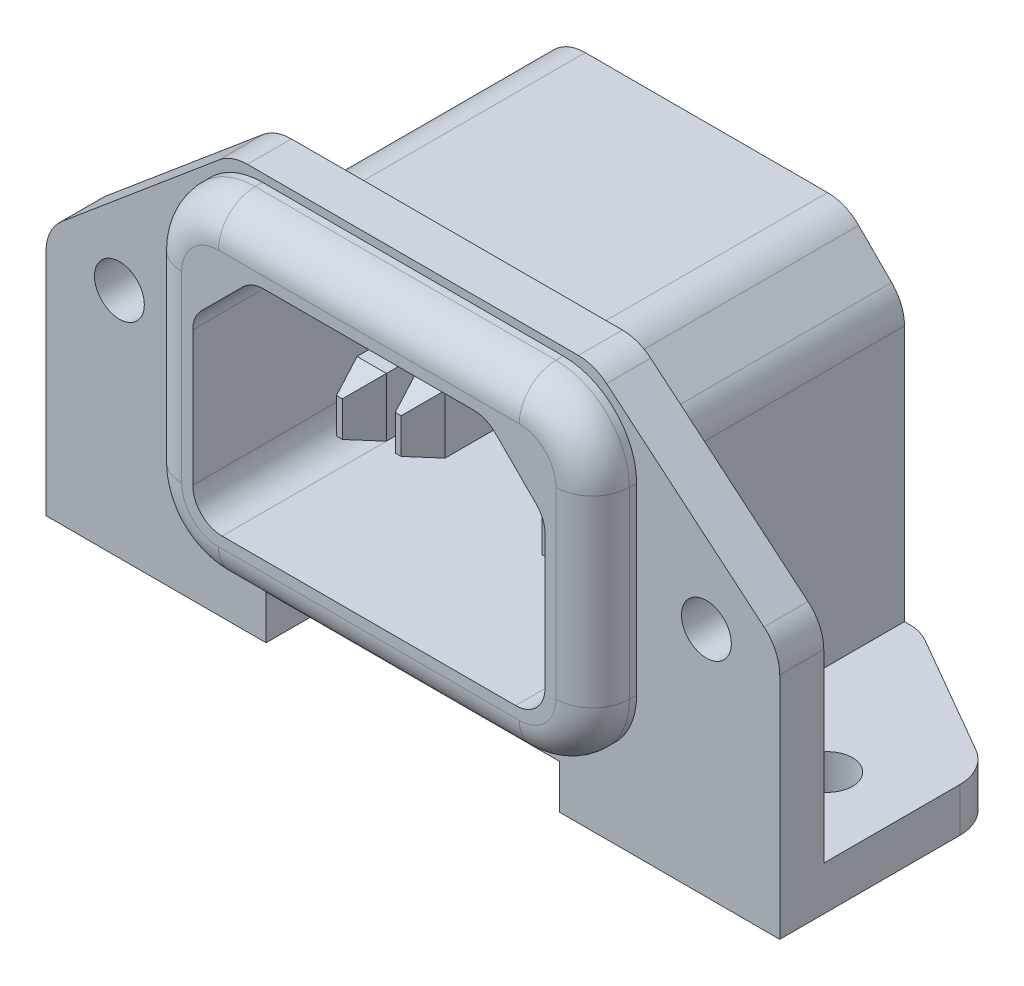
ISO-10303-21;
HEADER;
FILE_DESCRIPTION(('STEP AP214'),'2;1');
FILE_NAME('part.step','',(''),(''),'','','');
FILE_SCHEMA(('AUTOMOTIVE_DESIGN { 1 0 10303 214 1 1 1 1 }'));
ENDSEC;
DATA;
#1=APPLICATION_CONTEXT('core data for automotive mechanical design processes');
#2=APPLICATION_PROTOCOL_DEFINITION('international standard','automotive_design',2000,#1);
#3=PRODUCT_CONTEXT('',#1,'mechanical');
#4=PRODUCT('Part','Part','',(#3));
#5=PRODUCT_RELATED_PRODUCT_CATEGORY('part','',(#4));
#6=PRODUCT_DEFINITION_FORMATION('','',#4);
#7=PRODUCT_DEFINITION_CONTEXT('part definition',#1,'design');
#8=PRODUCT_DEFINITION('design','',#6,#7);
#9=PRODUCT_DEFINITION_SHAPE('','',#8);
#10=(LENGTH_UNIT() NAMED_UNIT(*) SI_UNIT(.MILLI.,.METRE.));
#11=(NAMED_UNIT(*) PLANE_ANGLE_UNIT() SI_UNIT($,.RADIAN.));
#12=(NAMED_UNIT(*) SI_UNIT($,.STERADIAN.) SOLID_ANGLE_UNIT());
#13=UNCERTAINTY_MEASURE_WITH_UNIT(LENGTH_MEASURE(1.E-05),#10,'distance_accuracy_value','');
#14=(GEOMETRIC_REPRESENTATION_CONTEXT(3) GLOBAL_UNCERTAINTY_ASSIGNED_CONTEXT((#13)) GLOBAL_UNIT_ASSIGNED_CONTEXT((#10,
#11,#12)) REPRESENTATION_CONTEXT('',''));
#15=CARTESIAN_POINT('',(0.,0.,0.));
#16=DIRECTION('',(0.,0.,1.));
#17=DIRECTION('',(1.,0.,0.));
#18=AXIS2_PLACEMENT_3D('',#15,#16,#17);
#19=CARTESIAN_POINT('',(-10.,3.,-23.));
#20=DIRECTION('',(0.,1.,0.));
#21=DIRECTION('',(0.,0.,1.));
#22=AXIS2_PLACEMENT_3D('',#19,#20,#21);
#23=PLANE('',#22);
#24=CARTESIAN_POINT('',(0.,3.,-18.8));
#25=DIRECTION('',(0.,1.,0.));
#26=DIRECTION('',(0.,0.,1.));
#27=AXIS2_PLACEMENT_3D('',#24,#25,#26);
#28=CIRCLE('',#27,0.75);
#29=CARTESIAN_POINT('',(0.,3.,-18.05));
#30=VERTEX_POINT('',#29);
#31=EDGE_CURVE('E1147',#30,#30,#28,.F.);
#32=ORIENTED_EDGE('',*,*,#31,.F.);
#33=EDGE_LOOP('',(#32));
#34=FACE_BOUND('',#33,.T.);
#35=DIRECTION('',(-1.,0.,0.));
#36=VECTOR('',#35,1.);
#37=CARTESIAN_POINT('',(-10.,3.,-3.));
#38=LINE('',#37,#36);
#39=CARTESIAN_POINT('',(10.,3.,-3.));
#40=VERTEX_POINT('',#39);
#41=CARTESIAN_POINT('',(-10.,3.,-3.));
#42=VERTEX_POINT('',#41);
#43=EDGE_CURVE('E772',#40,#42,#38,.T.);
#44=ORIENTED_EDGE('',*,*,#43,.T.);
#45=DIRECTION('',(0.,0.,1.));
#46=VECTOR('',#45,1.);
#47=CARTESIAN_POINT('',(-10.,3.,-23.));
#48=LINE('',#47,#46);
#49=CARTESIAN_POINT('',(-10.,3.,-23.));
#50=VERTEX_POINT('',#49);
#51=EDGE_CURVE('E785',#50,#42,#48,.T.);
#52=ORIENTED_EDGE('',*,*,#51,.F.);
#53=DIRECTION('',(-1.,0.,0.));
#54=VECTOR('',#53,1.);
#55=CARTESIAN_POINT('',(-10.,3.,-23.));
#56=LINE('',#55,#54);
#57=CARTESIAN_POINT('',(10.,3.,-23.));
#58=VERTEX_POINT('',#57);
#59=EDGE_CURVE('E775',#58,#50,#56,.T.);
#60=ORIENTED_EDGE('',*,*,#59,.F.);
#61=DIRECTION('',(0.,0.,1.));
#62=VECTOR('',#61,1.);
#63=CARTESIAN_POINT('',(10.,3.,-23.));
#64=LINE('',#63,#62);
#65=EDGE_CURVE('E788',#58,#40,#64,.T.);
#66=ORIENTED_EDGE('',*,*,#65,.T.);
#67=EDGE_LOOP('',(#44,#52,#60,#66));
#68=FACE_BOUND('',#67,.T.);
#69=CARTESIAN_POINT('',(-7.,3.,-18.8));
#70=DIRECTION('',(0.,1.,0.));
#71=DIRECTION('',(0.,0.,1.));
#72=AXIS2_PLACEMENT_3D('',#69,#70,#71);
#73=CIRCLE('',#72,0.75);
#74=CARTESIAN_POINT('',(-7.,3.,-18.05));
#75=VERTEX_POINT('',#74);
#76=EDGE_CURVE('E1115',#75,#75,#73,.F.);
#77=ORIENTED_EDGE('',*,*,#76,.F.);
#78=EDGE_LOOP('',(#77));
#79=FACE_BOUND('',#78,.T.);
#80=CARTESIAN_POINT('',(7.,3.,-18.8));
#81=DIRECTION('',(0.,1.,0.));
#82=DIRECTION('',(0.,0.,1.));
#83=AXIS2_PLACEMENT_3D('',#80,#81,#82);
#84=CIRCLE('',#83,0.75);
#85=CARTESIAN_POINT('',(7.,3.,-18.05));
#86=VERTEX_POINT('',#85);
#87=EDGE_CURVE('E1150',#86,#86,#84,.F.);
#88=ORIENTED_EDGE('',*,*,#87,.F.);
#89=EDGE_LOOP('',(#88));
#90=FACE_BOUND('',#89,.T.);
#91=ADVANCED_FACE('F32',(#34,#68,#79,#90),#23,.F.);
#92=CARTESIAN_POINT('',(-10.,9.8,-17.));
#93=DIRECTION('',(0.,0.,1.));
#94=DIRECTION('',(1.,0.,0.));
#95=AXIS2_PLACEMENT_3D('',#92,#93,#94);
#96=PLANE('',#95);
#97=DIRECTION('',(1.,0.,0.));
#98=VECTOR('',#97,1.);
#99=CARTESIAN_POINT('',(-10.,15.8,-17.));
#100=LINE('',#99,#98);
#101=CARTESIAN_POINT('',(-0.999999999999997,15.8,-17.));
#102=VERTEX_POINT('',#101);
#103=CARTESIAN_POINT('',(0.999999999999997,15.8,-17.));
#104=VERTEX_POINT('',#103);
#105=EDGE_CURVE('E628',#102,#104,#100,.T.);
#106=ORIENTED_EDGE('',*,*,#105,.F.);
#107=DIRECTION('',(0.,1.,0.));
#108=VECTOR('',#107,1.);
#109=CARTESIAN_POINT('',(-0.999999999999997,9.8,-17.));
#110=LINE('',#109,#108);
#111=CARTESIAN_POINT('',(-0.999999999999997,19.8,-17.));
#112=VERTEX_POINT('',#111);
#113=EDGE_CURVE('E626',#102,#112,#110,.T.);
#114=ORIENTED_EDGE('',*,*,#113,.T.);
#115=DIRECTION('',(1.,0.,0.));
#116=VECTOR('',#115,1.);
#117=CARTESIAN_POINT('',(-10.,19.8,-17.));
#118=LINE('',#117,#116);
#119=CARTESIAN_POINT('',(1.,19.8,-17.));
#120=VERTEX_POINT('',#119);
#121=EDGE_CURVE('E624',#112,#120,#118,.T.);
#122=ORIENTED_EDGE('',*,*,#121,.T.);
#123=DIRECTION('',(0.,1.,0.));
#124=VECTOR('',#123,1.);
#125=CARTESIAN_POINT('',(0.999999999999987,9.79999999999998,-17.));
#126=LINE('',#125,#124);
#127=EDGE_CURVE('E611',#104,#120,#126,.T.);
#128=ORIENTED_EDGE('',*,*,#127,.F.);
#129=EDGE_LOOP('',(#106,#114,#122,#128));
#130=FACE_BOUND('',#129,.T.);
#131=DIRECTION('',(-1.,0.,0.));
#132=VECTOR('',#131,1.);
#133=CARTESIAN_POINT('',(0.,11.8,-17.));
#134=LINE('',#133,#132);
#135=CARTESIAN_POINT('',(8.,11.8,-17.));
#136=VERTEX_POINT('',#135);
#137=CARTESIAN_POINT('',(6.,11.8,-17.));
#138=VERTEX_POINT('',#137);
#139=EDGE_CURVE('E631',#136,#138,#134,.T.);
#140=ORIENTED_EDGE('',*,*,#139,.T.);
#141=DIRECTION('',(0.,1.,0.));
#142=VECTOR('',#141,1.);
#143=CARTESIAN_POINT('',(6.00000000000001,-6.77710721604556,-17.));
#144=LINE('',#143,#142);
#145=CARTESIAN_POINT('',(6.,15.8,-17.));
#146=VERTEX_POINT('',#145);
#147=EDGE_CURVE('E640',#138,#146,#144,.T.);
#148=ORIENTED_EDGE('',*,*,#147,.T.);
#149=DIRECTION('',(-1.,0.,0.));
#150=VECTOR('',#149,1.);
#151=CARTESIAN_POINT('',(0.,15.8,-17.));
#152=LINE('',#151,#150);
#153=CARTESIAN_POINT('',(8.,15.8,-17.));
#154=VERTEX_POINT('',#153);
#155=EDGE_CURVE('E637',#154,#146,#152,.T.);
#156=ORIENTED_EDGE('',*,*,#155,.F.);
#157=DIRECTION('',(0.,1.,0.));
#158=VECTOR('',#157,1.);
#159=CARTESIAN_POINT('',(8.,-6.77710721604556,-17.));
#160=LINE('',#159,#158);
#161=EDGE_CURVE('E634',#136,#154,#160,.T.);
#162=ORIENTED_EDGE('',*,*,#161,.F.);
#163=EDGE_LOOP('',(#140,#148,#156,#162));
#164=FACE_BOUND('',#163,.T.);
#165=CARTESIAN_POINT('',(-10.,9.8,-17.));
#166=DIRECTION('',(0.,0.,1.));
#167=DIRECTION('',(1.,0.,0.));
#168=AXIS2_PLACEMENT_3D('',#165,#166,#167);
#169=CIRCLE('',#168,2.);
#170=CARTESIAN_POINT('',(-12.,9.8,-17.));
#171=VERTEX_POINT('',#170);
#172=CARTESIAN_POINT('',(-10.,7.8,-17.));
#173=VERTEX_POINT('',#172);
#174=EDGE_CURVE('E672',#171,#173,#169,.T.);
#175=ORIENTED_EDGE('',*,*,#174,.T.);
#176=DIRECTION('',(1.,0.,0.));
#177=VECTOR('',#176,1.);
#178=CARTESIAN_POINT('',(-10.,7.8,-17.));
#179=LINE('',#178,#177);
#180=CARTESIAN_POINT('',(10.,7.8,-17.));
#181=VERTEX_POINT('',#180);
#182=EDGE_CURVE('E675',#173,#181,#179,.T.);
#183=ORIENTED_EDGE('',*,*,#182,.T.);
#184=CARTESIAN_POINT('',(10.,9.8,-17.));
#185=DIRECTION('',(0.,0.,1.));
#186=DIRECTION('',(1.,0.,0.));
#187=AXIS2_PLACEMENT_3D('',#184,#185,#186);
#188=CIRCLE('',#187,2.);
#189=CARTESIAN_POINT('',(12.,9.8,-17.));
#190=VERTEX_POINT('',#189);
#191=EDGE_CURVE('E679',#181,#190,#188,.T.);
#192=ORIENTED_EDGE('',*,*,#191,.T.);
#193=DIRECTION('',(0.,1.,0.));
#194=VECTOR('',#193,1.);
#195=CARTESIAN_POINT('',(12.,9.8,-17.));
#196=LINE('',#195,#194);
#197=CARTESIAN_POINT('',(12.,18.9715728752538,-17.));
#198=VERTEX_POINT('',#197);
#199=EDGE_CURVE('E682',#190,#198,#196,.T.);
#200=ORIENTED_EDGE('',*,*,#199,.T.);
#201=CARTESIAN_POINT('',(10.,18.9715728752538,-17.));
#202=DIRECTION('',(0.,0.,1.));
#203=DIRECTION('',(-1.,0.,0.));
#204=AXIS2_PLACEMENT_3D('',#201,#202,#203);
#205=CIRCLE('',#204,2.);
#206=CARTESIAN_POINT('',(11.4142135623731,20.3857864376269,-17.));
#207=VERTEX_POINT('',#206);
#208=EDGE_CURVE('E685',#198,#207,#205,.T.);
#209=ORIENTED_EDGE('',*,*,#208,.T.);
#210=DIRECTION('',(-0.707106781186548,0.707106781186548,0.));
#211=VECTOR('',#210,1.);
#212=CARTESIAN_POINT('',(8.58578643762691,23.2142135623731,-17.));
#213=LINE('',#212,#211);
#214=CARTESIAN_POINT('',(8.58578643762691,23.2142135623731,-17.));
#215=VERTEX_POINT('',#214);
#216=EDGE_CURVE('E688',#207,#215,#213,.T.);
#217=ORIENTED_EDGE('',*,*,#216,.T.);
#218=CARTESIAN_POINT('',(7.17157287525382,21.8,-17.));
#219=DIRECTION('',(0.,0.,1.));
#220=DIRECTION('',(1.,0.,0.));
#221=AXIS2_PLACEMENT_3D('',#218,#219,#220);
#222=CIRCLE('',#221,2.);
#223=CARTESIAN_POINT('',(7.17157287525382,23.8,-17.));
#224=VERTEX_POINT('',#223);
#225=EDGE_CURVE('E691',#215,#224,#222,.T.);
#226=ORIENTED_EDGE('',*,*,#225,.T.);
#227=DIRECTION('',(-1.,0.,0.));
#228=VECTOR('',#227,1.);
#229=CARTESIAN_POINT('',(-7.17157287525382,23.8,-17.));
#230=LINE('',#229,#228);
#231=CARTESIAN_POINT('',(-7.17157287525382,23.8,-17.));
#232=VERTEX_POINT('',#231);
#233=EDGE_CURVE('E694',#224,#232,#230,.T.);
#234=ORIENTED_EDGE('',*,*,#233,.T.);
#235=CARTESIAN_POINT('',(-7.17157287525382,21.8,-17.));
#236=DIRECTION('',(0.,0.,1.));
#237=DIRECTION('',(-1.,0.,0.));
#238=AXIS2_PLACEMENT_3D('',#235,#236,#237);
#239=CIRCLE('',#238,2.);
#240=CARTESIAN_POINT('',(-8.58578643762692,23.2142135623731,-17.));
#241=VERTEX_POINT('',#240);
#242=EDGE_CURVE('E697',#232,#241,#239,.T.);
#243=ORIENTED_EDGE('',*,*,#242,.T.);
#244=DIRECTION('',(-0.707106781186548,-0.707106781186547,0.));
#245=VECTOR('',#244,1.);
#246=CARTESIAN_POINT('',(-11.4142135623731,20.3857864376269,-17.));
#247=LINE('',#246,#245);
#248=CARTESIAN_POINT('',(-11.4142135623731,20.3857864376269,-17.));
#249=VERTEX_POINT('',#248);
#250=EDGE_CURVE('E700',#241,#249,#247,.T.);
#251=ORIENTED_EDGE('',*,*,#250,.T.);
#252=CARTESIAN_POINT('',(-10.,18.9715728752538,-17.));
#253=DIRECTION('',(0.,0.,1.));
#254=DIRECTION('',(1.,0.,0.));
#255=AXIS2_PLACEMENT_3D('',#252,#253,#254);
#256=CIRCLE('',#255,2.);
#257=CARTESIAN_POINT('',(-12.,18.9715728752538,-17.));
#258=VERTEX_POINT('',#257);
#259=EDGE_CURVE('E703',#249,#258,#256,.T.);
#260=ORIENTED_EDGE('',*,*,#259,.T.);
#261=DIRECTION('',(0.,-1.,0.));
#262=VECTOR('',#261,1.);
#263=CARTESIAN_POINT('',(-12.,9.8,-17.));
#264=LINE('',#263,#262);
#265=EDGE_CURVE('E706',#258,#171,#264,.T.);
#266=ORIENTED_EDGE('',*,*,#265,.T.);
#267=EDGE_LOOP('',(#175,#183,#192,#200,#209,#217,#226,#234,#243,#251,#260,#266));
#268=FACE_BOUND('',#267,.T.);
#269=DIRECTION('',(0.,1.,0.));
#270=VECTOR('',#269,1.);
#271=CARTESIAN_POINT('',(-6.,-6.77710721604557,-17.));
#272=LINE('',#271,#270);
#273=CARTESIAN_POINT('',(-6.,11.8,-17.));
#274=VERTEX_POINT('',#273);
#275=CARTESIAN_POINT('',(-6.,15.8,-17.));
#276=VERTEX_POINT('',#275);
#277=EDGE_CURVE('E654',#274,#276,#272,.T.);
#278=ORIENTED_EDGE('',*,*,#277,.F.);
#279=DIRECTION('',(1.,0.,0.));
#280=VECTOR('',#279,1.);
#281=CARTESIAN_POINT('',(0.,11.8,-17.));
#282=LINE('',#281,#280);
#283=CARTESIAN_POINT('',(-8.,11.8,-17.));
#284=VERTEX_POINT('',#283);
#285=EDGE_CURVE('E651',#284,#274,#282,.T.);
#286=ORIENTED_EDGE('',*,*,#285,.F.);
#287=DIRECTION('',(0.,1.,0.));
#288=VECTOR('',#287,1.);
#289=CARTESIAN_POINT('',(-8.,-6.77710721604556,-17.));
#290=LINE('',#289,#288);
#291=CARTESIAN_POINT('',(-8.,15.8,-17.));
#292=VERTEX_POINT('',#291);
#293=EDGE_CURVE('E660',#284,#292,#290,.T.);
#294=ORIENTED_EDGE('',*,*,#293,.T.);
#295=DIRECTION('',(1.,0.,0.));
#296=VECTOR('',#295,1.);
#297=CARTESIAN_POINT('',(0.,15.8,-17.));
#298=LINE('',#297,#296);
#299=EDGE_CURVE('E657',#292,#276,#298,.T.);
#300=ORIENTED_EDGE('',*,*,#299,.T.);
#301=EDGE_LOOP('',(#278,#286,#294,#300));
#302=FACE_BOUND('',#301,.T.);
#303=ADVANCED_FACE('F1304',(#130,#164,#268,#302),#96,.T.);
#304=CARTESIAN_POINT('',(-22.,0.,-15.2679491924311));
#305=DIRECTION('',(0.,-1.,0.));
#306=DIRECTION('',(0.,0.,-1.));
#307=AXIS2_PLACEMENT_3D('',#304,#305,#306);
#308=PLANE('',#307);
#309=CARTESIAN_POINT('',(-19.75,0.,-11.5));
#310=DIRECTION('',(0.,-1.,0.));
#311=DIRECTION('',(0.,0.,-1.));
#312=AXIS2_PLACEMENT_3D('',#309,#310,#311);
#313=CIRCLE('',#312,1.69999999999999);
#314=CARTESIAN_POINT('',(-19.75,0.,-13.2));
#315=VERTEX_POINT('',#314);
#316=EDGE_CURVE('E594',#315,#315,#313,.T.);
#317=ORIENTED_EDGE('',*,*,#316,.F.);
#318=EDGE_LOOP('',(#317));
#319=FACE_BOUND('',#318,.T.);
#320=DIRECTION('',(0.,0.,1.));
#321=VECTOR('',#320,1.);
#322=CARTESIAN_POINT('',(-10.,0.,-23.));
#323=LINE('',#322,#321);
#324=CARTESIAN_POINT('',(-10.,0.,-23.));
#325=VERTEX_POINT('',#324);
#326=CARTESIAN_POINT('',(-10.,0.,-3.));
#327=VERTEX_POINT('',#326);
#328=EDGE_CURVE('E778',#325,#327,#323,.T.);
#329=ORIENTED_EDGE('',*,*,#328,.T.);
#330=DIRECTION('',(1.,0.,0.));
#331=VECTOR('',#330,1.);
#332=CARTESIAN_POINT('',(-25.,0.,-3.));
#333=LINE('',#332,#331);
#334=CARTESIAN_POINT('',(-25.,0.,-3.));
#335=VERTEX_POINT('',#334);
#336=EDGE_CURVE('E1000',#335,#327,#333,.T.);
#337=ORIENTED_EDGE('',*,*,#336,.F.);
#338=DIRECTION('',(0.,0.,1.));
#339=VECTOR('',#338,1.);
#340=CARTESIAN_POINT('',(-25.,0.,-3.));
#341=LINE('',#340,#339);
#342=CARTESIAN_POINT('',(-25.,0.,-15.2679491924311));
#343=VERTEX_POINT('',#342);
#344=EDGE_CURVE('E975',#343,#335,#341,.T.);
#345=ORIENTED_EDGE('',*,*,#344,.F.);
#346=CARTESIAN_POINT('',(-22.,0.,-15.2679491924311));
#347=DIRECTION('',(0.,1.,0.));
#348=DIRECTION('',(0.,0.,-1.));
#349=AXIS2_PLACEMENT_3D('',#346,#347,#348);
#350=CIRCLE('',#349,3.);
#351=CARTESIAN_POINT('',(-23.5,0.,-17.8660254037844));
#352=VERTEX_POINT('',#351);
#353=EDGE_CURVE('E979',#352,#343,#350,.T.);
#354=ORIENTED_EDGE('',*,*,#353,.F.);
#355=DIRECTION('',(-0.866025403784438,0.,0.500000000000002));
#356=VECTOR('',#355,1.);
#357=CARTESIAN_POINT('',(-23.5,0.,-17.8660254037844));
#358=LINE('',#357,#356);
#359=CARTESIAN_POINT('',(-15.3038475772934,0.,-22.5980762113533));
#360=VERTEX_POINT('',#359);
#361=EDGE_CURVE('E1017',#360,#352,#358,.T.);
#362=ORIENTED_EDGE('',*,*,#361,.F.);
#363=CARTESIAN_POINT('',(-13.8038475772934,0.,-20.));
#364=DIRECTION('',(0.,1.,0.));
#365=DIRECTION('',(0.,0.,-1.));
#366=AXIS2_PLACEMENT_3D('',#363,#364,#365);
#367=CIRCLE('',#366,3.);
#368=CARTESIAN_POINT('',(-13.8038475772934,0.,-23.));
#369=VERTEX_POINT('',#368);
#370=EDGE_CURVE('E1015',#369,#360,#367,.T.);
#371=ORIENTED_EDGE('',*,*,#370,.F.);
#372=DIRECTION('',(-1.,0.,0.));
#373=VECTOR('',#372,1.);
#374=CARTESIAN_POINT('',(-13.8038475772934,0.,-23.));
#375=LINE('',#374,#373);
#376=EDGE_CURVE('E1011',#325,#369,#375,.T.);
#377=ORIENTED_EDGE('',*,*,#376,.F.);
#378=EDGE_LOOP('',(#329,#337,#345,#354,#362,#371,#377));
#379=FACE_BOUND('',#378,.T.);
#380=ADVANCED_FACE('F1310',(#319,#379),#308,.T.);
#381=CARTESIAN_POINT('',(-22.,3.,-15.2679491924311));
#382=DIRECTION('',(0.,-1.,0.));
#383=DIRECTION('',(0.,0.,-1.));
#384=AXIS2_PLACEMENT_3D('',#381,#382,#383);
#385=PLANE('',#384);
#386=CARTESIAN_POINT('',(19.75,3.,-11.5));
#387=DIRECTION('',(0.,1.,0.));
#388=DIRECTION('',(0.,0.,1.));
#389=AXIS2_PLACEMENT_3D('',#386,#387,#388);
#390=CIRCLE('',#389,1.69999999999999);
#391=CARTESIAN_POINT('',(19.75,3.,-9.80000000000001));
#392=VERTEX_POINT('',#391);
#393=EDGE_CURVE('E595',#392,#392,#390,.T.);
#394=ORIENTED_EDGE('',*,*,#393,.F.);
#395=EDGE_LOOP('',(#394));
#396=FACE_BOUND('',#395,.T.);
#397=DIRECTION('',(0.,0.,1.));
#398=VECTOR('',#397,1.);
#399=CARTESIAN_POINT('',(13.5,3.,-58.2744950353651));
#400=LINE('',#399,#398);
#401=CARTESIAN_POINT('',(13.5,3.,-23.));
#402=VERTEX_POINT('',#401);
#403=CARTESIAN_POINT('',(13.5,3.,-6.));
#404=VERTEX_POINT('',#403);
#405=EDGE_CURVE('E844',#402,#404,#400,.T.);
#406=ORIENTED_EDGE('',*,*,#405,.T.);
#407=DIRECTION('',(1.,0.,0.));
#408=VECTOR('',#407,1.);
#409=CARTESIAN_POINT('',(-22.,3.,-6.));
#410=LINE('',#409,#408);
#411=CARTESIAN_POINT('',(25.,3.,-6.));
#412=VERTEX_POINT('',#411);
#413=EDGE_CURVE('E956',#404,#412,#410,.T.);
#414=ORIENTED_EDGE('',*,*,#413,.T.);
#415=DIRECTION('',(0.,0.,-1.));
#416=VECTOR('',#415,1.);
#417=CARTESIAN_POINT('',(25.,3.,-3.));
#418=LINE('',#417,#416);
#419=CARTESIAN_POINT('',(25.,3.,-15.2679491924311));
#420=VERTEX_POINT('',#419);
#421=EDGE_CURVE('E978',#412,#420,#418,.T.);
#422=ORIENTED_EDGE('',*,*,#421,.T.);
#423=CARTESIAN_POINT('',(22.,3.,-15.2679491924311));
#424=DIRECTION('',(0.,1.,0.));
#425=DIRECTION('',(0.,0.,1.));
#426=AXIS2_PLACEMENT_3D('',#423,#424,#425);
#427=CIRCLE('',#426,3.);
#428=CARTESIAN_POINT('',(23.5,3.,-17.8660254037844));
#429=VERTEX_POINT('',#428);
#430=EDGE_CURVE('E981',#420,#429,#427,.T.);
#431=ORIENTED_EDGE('',*,*,#430,.T.);
#432=DIRECTION('',(-0.866025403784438,0.,-0.500000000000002));
#433=VECTOR('',#432,1.);
#434=CARTESIAN_POINT('',(23.5,3.,-17.8660254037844));
#435=LINE('',#434,#433);
#436=CARTESIAN_POINT('',(15.3038475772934,3.,-22.5980762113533));
#437=VERTEX_POINT('',#436);
#438=EDGE_CURVE('E983',#429,#437,#435,.T.);
#439=ORIENTED_EDGE('',*,*,#438,.T.);
#440=CARTESIAN_POINT('',(13.8038475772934,3.,-20.));
#441=DIRECTION('',(0.,1.,0.));
#442=DIRECTION('',(0.,0.,1.));
#443=AXIS2_PLACEMENT_3D('',#440,#441,#442);
#444=CIRCLE('',#443,3.);
#445=CARTESIAN_POINT('',(13.8038475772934,3.,-23.));
#446=VERTEX_POINT('',#445);
#447=EDGE_CURVE('E985',#437,#446,#444,.T.);
#448=ORIENTED_EDGE('',*,*,#447,.T.);
#449=DIRECTION('',(-1.,0.,0.));
#450=VECTOR('',#449,1.);
#451=CARTESIAN_POINT('',(-13.8038475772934,3.,-23.));
#452=LINE('',#451,#450);
#453=EDGE_CURVE('E988',#446,#402,#452,.T.);
#454=ORIENTED_EDGE('',*,*,#453,.T.);
#455=EDGE_LOOP('',(#406,#414,#422,#431,#439,#448,#454));
#456=FACE_BOUND('',#455,.T.);
#457=ADVANCED_FACE('F1397',(#396,#456),#385,.F.);
#458=CARTESIAN_POINT('',(-19.75,3.,-11.5));
#459=DIRECTION('',(0.,1.,0.));
#460=DIRECTION('',(0.,0.,1.));
#461=AXIS2_PLACEMENT_3D('',#458,#459,#460);
#462=CIRCLE('',#461,1.69999999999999);
#463=CARTESIAN_POINT('',(-19.75,3.,-9.80000000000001));
#464=VERTEX_POINT('',#463);
#465=EDGE_CURVE('E591',#464,#464,#462,.T.);
#466=ORIENTED_EDGE('',*,*,#465,.F.);
#467=EDGE_LOOP('',(#466));
#468=FACE_BOUND('',#467,.T.);
#469=DIRECTION('',(0.,0.,1.));
#470=VECTOR('',#469,1.);
#471=CARTESIAN_POINT('',(-13.5,3.,-58.2744950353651));
#472=LINE('',#471,#470);
#473=CARTESIAN_POINT('',(-13.5,3.,-23.));
#474=VERTEX_POINT('',#473);
#475=CARTESIAN_POINT('',(-13.5,3.,-6.));
#476=VERTEX_POINT('',#475);
#477=EDGE_CURVE('E863',#474,#476,#472,.T.);
#478=ORIENTED_EDGE('',*,*,#477,.F.);
#479=CARTESIAN_POINT('',(-13.8038475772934,3.,-23.));
#480=VERTEX_POINT('',#479);
#481=EDGE_CURVE('E987',#474,#480,#452,.T.);
#482=ORIENTED_EDGE('',*,*,#481,.T.);
#483=CARTESIAN_POINT('',(-13.8038475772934,3.,-20.));
#484=DIRECTION('',(0.,1.,0.));
#485=DIRECTION('',(0.,0.,-1.));
#486=AXIS2_PLACEMENT_3D('',#483,#484,#485);
#487=CIRCLE('',#486,3.);
#488=CARTESIAN_POINT('',(-15.3038475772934,3.,-22.5980762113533));
#489=VERTEX_POINT('',#488);
#490=EDGE_CURVE('E991',#480,#489,#487,.T.);
#491=ORIENTED_EDGE('',*,*,#490,.T.);
#492=DIRECTION('',(-0.866025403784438,0.,0.500000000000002));
#493=VECTOR('',#492,1.);
#494=CARTESIAN_POINT('',(-23.5,3.,-17.8660254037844));
#495=LINE('',#494,#493);
#496=CARTESIAN_POINT('',(-23.5,3.,-17.8660254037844));
#497=VERTEX_POINT('',#496);
#498=EDGE_CURVE('E993',#489,#497,#495,.T.);
#499=ORIENTED_EDGE('',*,*,#498,.T.);
#500=CARTESIAN_POINT('',(-22.,3.,-15.2679491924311));
#501=DIRECTION('',(0.,1.,0.));
#502=DIRECTION('',(0.,0.,-1.));
#503=AXIS2_PLACEMENT_3D('',#500,#501,#502);
#504=CIRCLE('',#503,3.);
#505=CARTESIAN_POINT('',(-25.,3.,-15.2679491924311));
#506=VERTEX_POINT('',#505);
#507=EDGE_CURVE('E995',#497,#506,#504,.T.);
#508=ORIENTED_EDGE('',*,*,#507,.T.);
#509=DIRECTION('',(0.,0.,1.));
#510=VECTOR('',#509,1.);
#511=CARTESIAN_POINT('',(-25.,3.,-3.));
#512=LINE('',#511,#510);
#513=CARTESIAN_POINT('',(-25.,3.,-6.));
#514=VERTEX_POINT('',#513);
#515=EDGE_CURVE('E976',#506,#514,#512,.T.);
#516=ORIENTED_EDGE('',*,*,#515,.T.);
#517=EDGE_CURVE('E972',#514,#476,#410,.T.);
#518=ORIENTED_EDGE('',*,*,#517,.T.);
#519=EDGE_LOOP('',(#478,#482,#491,#499,#508,#516,#518));
#520=FACE_BOUND('',#519,.T.);
#521=ADVANCED_FACE('F1375',(#468,#520),#385,.F.);
#522=CARTESIAN_POINT('',(-22.,15.601077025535,-6.));
#523=DIRECTION('',(0.,0.,-1.));
#524=DIRECTION('',(-1.,0.,0.));
#525=AXIS2_PLACEMENT_3D('',#522,#523,#524);
#526=PLANE('',#525);
#527=CARTESIAN_POINT('',(-20.,15.8,-6.));
#528=DIRECTION('',(0.,0.,-1.));
#529=DIRECTION('',(-1.,0.,0.));
#530=AXIS2_PLACEMENT_3D('',#527,#528,#529);
#531=CIRCLE('',#530,1.69999999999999);
#532=CARTESIAN_POINT('',(-21.7,15.8,-6.));
#533=VERTEX_POINT('',#532);
#534=EDGE_CURVE('E586',#533,#533,#531,.T.);
#535=ORIENTED_EDGE('',*,*,#534,.F.);
#536=EDGE_LOOP('',(#535));
#537=FACE_BOUND('',#536,.T.);
#538=CARTESIAN_POINT('',(20.,15.8,-6.));
#539=DIRECTION('',(0.,0.,-1.));
#540=DIRECTION('',(-1.,0.,0.));
#541=AXIS2_PLACEMENT_3D('',#538,#539,#540);
#542=CIRCLE('',#541,1.69999999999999);
#543=CARTESIAN_POINT('',(18.3,15.8,-6.));
#544=VERTEX_POINT('',#543);
#545=EDGE_CURVE('E590',#544,#544,#542,.T.);
#546=ORIENTED_EDGE('',*,*,#545,.F.);
#547=EDGE_LOOP('',(#546));
#548=FACE_BOUND('',#547,.T.);
#549=ORIENTED_EDGE('',*,*,#413,.F.);
#550=DIRECTION('',(0.,-1.,0.));
#551=VECTOR('',#550,1.);
#552=CARTESIAN_POINT('',(13.5,3.,-6.));
#553=LINE('',#552,#551);
#554=CARTESIAN_POINT('',(13.5,20.4573593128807,-6.));
#555=VERTEX_POINT('',#554);
#556=EDGE_CURVE('E842',#555,#404,#553,.T.);
#557=ORIENTED_EDGE('',*,*,#556,.F.);
#558=CARTESIAN_POINT('',(10.5,20.4573593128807,-6.));
#559=DIRECTION('',(0.,0.,-1.));
#560=DIRECTION('',(1.,0.,0.));
#561=AXIS2_PLACEMENT_3D('',#558,#559,#560);
#562=CIRCLE('',#561,3.);
#563=CARTESIAN_POINT('',(12.6213203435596,22.5786796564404,-6.));
#564=VERTEX_POINT('',#563);
#565=EDGE_CURVE('E839',#564,#555,#562,.T.);
#566=ORIENTED_EDGE('',*,*,#565,.F.);
#567=DIRECTION('',(0.707106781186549,-0.707106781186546,0.));
#568=VECTOR('',#567,1.);
#569=CARTESIAN_POINT('',(12.6213203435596,22.5786796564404,-6.));
#570=LINE('',#569,#568);
#571=CARTESIAN_POINT('',(10.3786796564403,24.8213203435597,-6.));
#572=VERTEX_POINT('',#571);
#573=EDGE_CURVE('E836',#572,#564,#570,.T.);
#574=ORIENTED_EDGE('',*,*,#573,.F.);
#575=CARTESIAN_POINT('',(8.2573593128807,22.7,-6.));
#576=DIRECTION('',(0.,0.,-1.));
#577=DIRECTION('',(1.,0.,0.));
#578=AXIS2_PLACEMENT_3D('',#575,#576,#577);
#579=CIRCLE('',#578,3.);
#580=CARTESIAN_POINT('',(8.25735931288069,25.7,-6.));
#581=VERTEX_POINT('',#580);
#582=EDGE_CURVE('E833',#581,#572,#579,.T.);
#583=ORIENTED_EDGE('',*,*,#582,.F.);
#584=DIRECTION('',(1.,0.,0.));
#585=VECTOR('',#584,1.);
#586=CARTESIAN_POINT('',(8.25735931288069,25.7,-6.));
#587=LINE('',#586,#585);
#588=CARTESIAN_POINT('',(-8.25735931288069,25.7,-6.));
#589=VERTEX_POINT('',#588);
#590=EDGE_CURVE('E830',#589,#581,#587,.T.);
#591=ORIENTED_EDGE('',*,*,#590,.F.);
#592=CARTESIAN_POINT('',(-8.2573593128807,22.7,-6.));
#593=DIRECTION('',(0.,0.,-1.));
#594=DIRECTION('',(-1.,0.,0.));
#595=AXIS2_PLACEMENT_3D('',#592,#593,#594);
#596=CIRCLE('',#595,3.);
#597=CARTESIAN_POINT('',(-10.3786796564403,24.8213203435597,-6.));
#598=VERTEX_POINT('',#597);
#599=EDGE_CURVE('E827',#598,#589,#596,.T.);
#600=ORIENTED_EDGE('',*,*,#599,.F.);
#601=DIRECTION('',(0.707106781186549,0.707106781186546,0.));
#602=VECTOR('',#601,1.);
#603=CARTESIAN_POINT('',(-12.6213203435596,22.5786796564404,-6.));
#604=LINE('',#603,#602);
#605=CARTESIAN_POINT('',(-12.6213203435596,22.5786796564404,-6.));
#606=VERTEX_POINT('',#605);
#607=EDGE_CURVE('E824',#606,#598,#604,.T.);
#608=ORIENTED_EDGE('',*,*,#607,.F.);
#609=CARTESIAN_POINT('',(-10.5,20.4573593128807,-6.));
#610=DIRECTION('',(0.,0.,-1.));
#611=DIRECTION('',(-1.,0.,0.));
#612=AXIS2_PLACEMENT_3D('',#609,#610,#611);
#613=CIRCLE('',#612,3.);
#614=CARTESIAN_POINT('',(-13.5,20.4573593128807,-6.));
#615=VERTEX_POINT('',#614);
#616=EDGE_CURVE('E821',#615,#606,#613,.T.);
#617=ORIENTED_EDGE('',*,*,#616,.F.);
#618=DIRECTION('',(0.,1.,0.));
#619=VECTOR('',#618,1.);
#620=CARTESIAN_POINT('',(-13.5,3.,-6.));
#621=LINE('',#620,#619);
#622=EDGE_CURVE('E787',#476,#615,#621,.T.);
#623=ORIENTED_EDGE('',*,*,#622,.F.);
#624=ORIENTED_EDGE('',*,*,#517,.F.);
#625=DIRECTION('',(0.,-1.,0.));
#626=VECTOR('',#625,1.);
#627=CARTESIAN_POINT('',(-25.,0.,-6.));
#628=LINE('',#627,#626);
#629=CARTESIAN_POINT('',(-25.,15.601077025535,-6.));
#630=VERTEX_POINT('',#629);
#631=EDGE_CURVE('E910',#630,#514,#628,.T.);
#632=ORIENTED_EDGE('',*,*,#631,.F.);
#633=CARTESIAN_POINT('',(-22.,15.601077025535,-6.));
#634=DIRECTION('',(0.,0.,1.));
#635=DIRECTION('',(-1.,0.,0.));
#636=AXIS2_PLACEMENT_3D('',#633,#634,#635);
#637=CIRCLE('',#636,3.);
#638=CARTESIAN_POINT('',(-23.9283628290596,17.8992103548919,-6.));
#639=VERTEX_POINT('',#638);
#640=EDGE_CURVE('E907',#639,#630,#637,.T.);
#641=ORIENTED_EDGE('',*,*,#640,.F.);
#642=DIRECTION('',(-0.766044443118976,-0.642787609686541,0.));
#643=VECTOR('',#642,1.);
#644=CARTESIAN_POINT('',(-23.9283628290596,17.8992103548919,-6.));
#645=LINE('',#644,#643);
#646=CARTESIAN_POINT('',(-13.2038640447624,26.8981333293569,-6.));
#647=VERTEX_POINT('',#646);
#648=EDGE_CURVE('E931',#647,#639,#645,.T.);
#649=ORIENTED_EDGE('',*,*,#648,.F.);
#650=CARTESIAN_POINT('',(-11.2755012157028,24.6,-6.));
#651=DIRECTION('',(0.,0.,1.));
#652=DIRECTION('',(-1.,0.,0.));
#653=AXIS2_PLACEMENT_3D('',#650,#651,#652);
#654=CIRCLE('',#653,3.);
#655=CARTESIAN_POINT('',(-11.2755012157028,27.6,-6.));
#656=VERTEX_POINT('',#655);
#657=EDGE_CURVE('E928',#656,#647,#654,.T.);
#658=ORIENTED_EDGE('',*,*,#657,.F.);
#659=DIRECTION('',(-1.,0.,0.));
#660=VECTOR('',#659,1.);
#661=CARTESIAN_POINT('',(-11.2755012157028,27.6,-6.));
#662=LINE('',#661,#660);
#663=CARTESIAN_POINT('',(11.2755012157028,27.6,-6.));
#664=VERTEX_POINT('',#663);
#665=EDGE_CURVE('E925',#664,#656,#662,.T.);
#666=ORIENTED_EDGE('',*,*,#665,.F.);
#667=CARTESIAN_POINT('',(11.2755012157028,24.6,-6.));
#668=DIRECTION('',(0.,0.,1.));
#669=DIRECTION('',(1.,0.,0.));
#670=AXIS2_PLACEMENT_3D('',#667,#668,#669);
#671=CIRCLE('',#670,3.);
#672=CARTESIAN_POINT('',(13.2038640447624,26.8981333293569,-6.));
#673=VERTEX_POINT('',#672);
#674=EDGE_CURVE('E922',#673,#664,#671,.T.);
#675=ORIENTED_EDGE('',*,*,#674,.F.);
#676=DIRECTION('',(-0.766044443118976,0.642787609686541,0.));
#677=VECTOR('',#676,1.);
#678=CARTESIAN_POINT('',(23.9283628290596,17.8992103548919,-6.));
#679=LINE('',#678,#677);
#680=CARTESIAN_POINT('',(23.9283628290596,17.8992103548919,-6.));
#681=VERTEX_POINT('',#680);
#682=EDGE_CURVE('E919',#681,#673,#679,.T.);
#683=ORIENTED_EDGE('',*,*,#682,.F.);
#684=CARTESIAN_POINT('',(22.,15.601077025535,-6.));
#685=DIRECTION('',(0.,0.,1.));
#686=DIRECTION('',(1.,0.,0.));
#687=AXIS2_PLACEMENT_3D('',#684,#685,#686);
#688=CIRCLE('',#687,3.);
#689=CARTESIAN_POINT('',(25.,15.601077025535,-6.));
#690=VERTEX_POINT('',#689);
#691=EDGE_CURVE('E916',#690,#681,#688,.T.);
#692=ORIENTED_EDGE('',*,*,#691,.F.);
#693=DIRECTION('',(0.,1.,0.));
#694=VECTOR('',#693,1.);
#695=CARTESIAN_POINT('',(25.,0.,-6.));
#696=LINE('',#695,#694);
#697=EDGE_CURVE('E914',#412,#690,#696,.T.);
#698=ORIENTED_EDGE('',*,*,#697,.F.);
#699=EDGE_LOOP('',(#549,#557,#566,#574,#583,#591,#600,#608,#617,#623,#624,#632,#641,#649,#658,
#666,#675,#683,#692,#698));
#700=FACE_BOUND('',#699,.T.);
#701=ADVANCED_FACE('F1380',(#537,#548,#700),#526,.T.);
#702=CARTESIAN_POINT('',(-25.,3.,-3.));
#703=DIRECTION('',(0.,0.,-1.));
#704=DIRECTION('',(-1.,0.,0.));
#705=AXIS2_PLACEMENT_3D('',#702,#703,#704);
#706=PLANE('',#705);
#707=CARTESIAN_POINT('',(-20.,15.8,-3.));
#708=DIRECTION('',(0.,0.,1.));
#709=DIRECTION('',(1.,0.,0.));
#710=AXIS2_PLACEMENT_3D('',#707,#708,#709);
#711=CIRCLE('',#710,1.69999999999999);
#712=CARTESIAN_POINT('',(-18.3,15.8,-3.));
#713=VERTEX_POINT('',#712);
#714=EDGE_CURVE('E581',#713,#713,#711,.T.);
#715=ORIENTED_EDGE('',*,*,#714,.F.);
#716=EDGE_LOOP('',(#715));
#717=FACE_BOUND('',#716,.T.);
#718=CARTESIAN_POINT('',(20.,15.8,-3.));
#719=DIRECTION('',(0.,0.,1.));
#720=DIRECTION('',(1.,0.,0.));
#721=AXIS2_PLACEMENT_3D('',#718,#719,#720);
#722=CIRCLE('',#721,1.69999999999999);
#723=CARTESIAN_POINT('',(21.7,15.8,-3.));
#724=VERTEX_POINT('',#723);
#725=EDGE_CURVE('E587',#724,#724,#722,.T.);
#726=ORIENTED_EDGE('',*,*,#725,.F.);
#727=EDGE_LOOP('',(#726));
#728=FACE_BOUND('',#727,.T.);
#729=ORIENTED_EDGE('',*,*,#336,.T.);
#730=DIRECTION('',(0.,-1.,0.));
#731=VECTOR('',#730,1.);
#732=CARTESIAN_POINT('',(-10.,0.,-3.));
#733=LINE('',#732,#731);
#734=EDGE_CURVE('E745',#42,#327,#733,.T.);
#735=ORIENTED_EDGE('',*,*,#734,.F.);
#736=ORIENTED_EDGE('',*,*,#43,.F.);
#737=DIRECTION('',(0.,1.,0.));
#738=VECTOR('',#737,1.);
#739=CARTESIAN_POINT('',(10.,0.,-3.));
#740=LINE('',#739,#738);
#741=CARTESIAN_POINT('',(10.,0.,-3.));
#742=VERTEX_POINT('',#741);
#743=EDGE_CURVE('E780',#742,#40,#740,.T.);
#744=ORIENTED_EDGE('',*,*,#743,.F.);
#745=CARTESIAN_POINT('',(25.,0.,-3.));
#746=VERTEX_POINT('',#745);
#747=EDGE_CURVE('E999',#742,#746,#333,.T.);
#748=ORIENTED_EDGE('',*,*,#747,.T.);
#749=DIRECTION('',(0.,-1.,0.));
#750=VECTOR('',#749,1.);
#751=CARTESIAN_POINT('',(25.,3.,-3.));
#752=LINE('',#751,#750);
#753=CARTESIAN_POINT('',(25.,15.601077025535,-3.));
#754=VERTEX_POINT('',#753);
#755=EDGE_CURVE('E1043',#754,#746,#752,.T.);
#756=ORIENTED_EDGE('',*,*,#755,.F.);
#757=CARTESIAN_POINT('',(22.,15.601077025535,-3.));
#758=DIRECTION('',(0.,0.,1.));
#759=DIRECTION('',(1.,0.,0.));
#760=AXIS2_PLACEMENT_3D('',#757,#758,#759);
#761=CIRCLE('',#760,3.);
#762=CARTESIAN_POINT('',(23.9283628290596,17.8992103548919,-3.));
#763=VERTEX_POINT('',#762);
#764=EDGE_CURVE('E937',#754,#763,#761,.T.);
#765=ORIENTED_EDGE('',*,*,#764,.T.);
#766=DIRECTION('',(-0.766044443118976,0.642787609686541,0.));
#767=VECTOR('',#766,1.);
#768=CARTESIAN_POINT('',(23.9283628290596,17.8992103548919,-3.));
#769=LINE('',#768,#767);
#770=CARTESIAN_POINT('',(13.2038640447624,26.8981333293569,-3.));
#771=VERTEX_POINT('',#770);
#772=EDGE_CURVE('E940',#763,#771,#769,.T.);
#773=ORIENTED_EDGE('',*,*,#772,.T.);
#774=CARTESIAN_POINT('',(11.2755012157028,24.6,-3.));
#775=DIRECTION('',(0.,0.,1.));
#776=DIRECTION('',(1.,0.,0.));
#777=AXIS2_PLACEMENT_3D('',#774,#775,#776);
#778=CIRCLE('',#777,3.);
#779=CARTESIAN_POINT('',(11.2755012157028,27.6,-3.));
#780=VERTEX_POINT('',#779);
#781=EDGE_CURVE('E943',#771,#780,#778,.T.);
#782=ORIENTED_EDGE('',*,*,#781,.T.);
#783=DIRECTION('',(-1.,0.,0.));
#784=VECTOR('',#783,1.);
#785=CARTESIAN_POINT('',(-11.2755012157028,27.6,-3.));
#786=LINE('',#785,#784);
#787=CARTESIAN_POINT('',(-11.2755012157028,27.6,-3.));
#788=VERTEX_POINT('',#787);
#789=EDGE_CURVE('E946',#780,#788,#786,.T.);
#790=ORIENTED_EDGE('',*,*,#789,.T.);
#791=CARTESIAN_POINT('',(-11.2755012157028,24.6,-3.));
#792=DIRECTION('',(0.,0.,1.));
#793=DIRECTION('',(-1.,0.,0.));
#794=AXIS2_PLACEMENT_3D('',#791,#792,#793);
#795=CIRCLE('',#794,3.);
#796=CARTESIAN_POINT('',(-13.2038640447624,26.8981333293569,-3.));
#797=VERTEX_POINT('',#796);
#798=EDGE_CURVE('E949',#788,#797,#795,.T.);
#799=ORIENTED_EDGE('',*,*,#798,.T.);
#800=DIRECTION('',(-0.766044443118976,-0.642787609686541,0.));
#801=VECTOR('',#800,1.);
#802=CARTESIAN_POINT('',(-23.9283628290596,17.8992103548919,-3.));
#803=LINE('',#802,#801);
#804=CARTESIAN_POINT('',(-23.9283628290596,17.8992103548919,-3.));
#805=VERTEX_POINT('',#804);
#806=EDGE_CURVE('E911',#797,#805,#803,.T.);
#807=ORIENTED_EDGE('',*,*,#806,.T.);
#808=CARTESIAN_POINT('',(-22.,15.601077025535,-3.));
#809=DIRECTION('',(0.,0.,1.));
#810=DIRECTION('',(-1.,0.,0.));
#811=AXIS2_PLACEMENT_3D('',#808,#809,#810);
#812=CIRCLE('',#811,3.);
#813=CARTESIAN_POINT('',(-25.,15.601077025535,-3.));
#814=VERTEX_POINT('',#813);
#815=EDGE_CURVE('E906',#805,#814,#812,.T.);
#816=ORIENTED_EDGE('',*,*,#815,.T.);
#817=DIRECTION('',(0.,-1.,0.));
#818=VECTOR('',#817,1.);
#819=CARTESIAN_POINT('',(-25.,3.,-3.));
#820=LINE('',#819,#818);
#821=EDGE_CURVE('E1046',#814,#335,#820,.T.);
#822=ORIENTED_EDGE('',*,*,#821,.T.);
#823=EDGE_LOOP('',(#729,#735,#736,#744,#748,#756,#765,#773,#782,#790,#799,#807,#816,#822));
#824=FACE_BOUND('',#823,.T.);
#825=CARTESIAN_POINT('',(-10.25,22.05,-3.));
#826=DIRECTION('',(0.,0.,1.));
#827=DIRECTION('',(-1.,0.,0.));
#828=AXIS2_PLACEMENT_3D('',#825,#826,#827);
#829=CIRCLE('',#828,5.);
#830=CARTESIAN_POINT('',(-10.25,27.05,-3.));
#831=VERTEX_POINT('',#830);
#832=CARTESIAN_POINT('',(-15.25,22.05,-3.));
#833=VERTEX_POINT('',#832);
#834=EDGE_CURVE('E818',#831,#833,#829,.T.);
#835=ORIENTED_EDGE('',*,*,#834,.F.);
#836=DIRECTION('',(-1.,0.,0.));
#837=VECTOR('',#836,1.);
#838=CARTESIAN_POINT('',(-10.25,27.05,-3.));
#839=LINE('',#838,#837);
#840=CARTESIAN_POINT('',(10.25,27.05,-3.));
#841=VERTEX_POINT('',#840);
#842=EDGE_CURVE('E887',#841,#831,#839,.T.);
#843=ORIENTED_EDGE('',*,*,#842,.F.);
#844=CARTESIAN_POINT('',(10.25,22.05,-3.));
#845=DIRECTION('',(0.,0.,1.));
#846=DIRECTION('',(-1.,0.,0.));
#847=AXIS2_PLACEMENT_3D('',#844,#845,#846);
#848=CIRCLE('',#847,5.);
#849=CARTESIAN_POINT('',(15.25,22.05,-3.));
#850=VERTEX_POINT('',#849);
#851=EDGE_CURVE('E884',#850,#841,#848,.T.);
#852=ORIENTED_EDGE('',*,*,#851,.F.);
#853=DIRECTION('',(0.,1.,0.));
#854=VECTOR('',#853,1.);
#855=CARTESIAN_POINT('',(15.25,9.55,-3.));
#856=LINE('',#855,#854);
#857=CARTESIAN_POINT('',(15.25,9.55,-3.));
#858=VERTEX_POINT('',#857);
#859=EDGE_CURVE('E881',#858,#850,#856,.T.);
#860=ORIENTED_EDGE('',*,*,#859,.F.);
#861=CARTESIAN_POINT('',(10.25,9.55,-3.));
#862=DIRECTION('',(0.,0.,1.));
#863=DIRECTION('',(1.,0.,0.));
#864=AXIS2_PLACEMENT_3D('',#861,#862,#863);
#865=CIRCLE('',#864,5.);
#866=CARTESIAN_POINT('',(10.25,4.55,-3.));
#867=VERTEX_POINT('',#866);
#868=EDGE_CURVE('E878',#867,#858,#865,.T.);
#869=ORIENTED_EDGE('',*,*,#868,.F.);
#870=DIRECTION('',(1.,0.,0.));
#871=VECTOR('',#870,1.);
#872=CARTESIAN_POINT('',(-10.25,4.55,-3.));
#873=LINE('',#872,#871);
#874=CARTESIAN_POINT('',(-10.25,4.55,-3.));
#875=VERTEX_POINT('',#874);
#876=EDGE_CURVE('E875',#875,#867,#873,.T.);
#877=ORIENTED_EDGE('',*,*,#876,.F.);
#878=CARTESIAN_POINT('',(-10.25,9.55,-3.));
#879=DIRECTION('',(0.,0.,1.));
#880=DIRECTION('',(-1.,0.,0.));
#881=AXIS2_PLACEMENT_3D('',#878,#879,#880);
#882=CIRCLE('',#881,5.);
#883=CARTESIAN_POINT('',(-15.25,9.55,-3.));
#884=VERTEX_POINT('',#883);
#885=EDGE_CURVE('E872',#884,#875,#882,.T.);
#886=ORIENTED_EDGE('',*,*,#885,.F.);
#887=DIRECTION('',(0.,-1.,0.));
#888=VECTOR('',#887,1.);
#889=CARTESIAN_POINT('',(-15.25,9.55,-3.));
#890=LINE('',#889,#888);
#891=EDGE_CURVE('E869',#833,#884,#890,.T.);
#892=ORIENTED_EDGE('',*,*,#891,.F.);
#893=EDGE_LOOP('',(#835,#843,#852,#860,#869,#877,#886,#892));
#894=FACE_BOUND('',#893,.T.);
#895=ADVANCED_FACE('F1255',(#717,#728,#824,#894),#706,.F.);
#896=CARTESIAN_POINT('',(-25.,3.,-3.));
#897=DIRECTION('',(1.,0.,0.));
#898=DIRECTION('',(0.,0.,-1.));
#899=AXIS2_PLACEMENT_3D('',#896,#897,#898);
#900=PLANE('',#899);
#901=ORIENTED_EDGE('',*,*,#344,.T.);
#902=ORIENTED_EDGE('',*,*,#821,.F.);
#903=DIRECTION('',(0.,0.,1.));
#904=VECTOR('',#903,1.);
#905=CARTESIAN_POINT('',(-25.,15.601077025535,-6.));
#906=LINE('',#905,#904);
#907=EDGE_CURVE('E934',#630,#814,#906,.T.);
#908=ORIENTED_EDGE('',*,*,#907,.F.);
#909=ORIENTED_EDGE('',*,*,#631,.T.);
#910=ORIENTED_EDGE('',*,*,#515,.F.);
#911=DIRECTION('',(0.,-1.,0.));
#912=VECTOR('',#911,1.);
#913=CARTESIAN_POINT('',(-25.,3.,-15.2679491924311));
#914=LINE('',#913,#912);
#915=EDGE_CURVE('E997',#506,#343,#914,.T.);
#916=ORIENTED_EDGE('',*,*,#915,.T.);
#917=EDGE_LOOP('',(#901,#902,#908,#909,#910,#916));
#918=FACE_BOUND('',#917,.T.);
#919=ADVANCED_FACE('F1435',(#918),#900,.F.);
#920=CARTESIAN_POINT('',(25.,3.,-3.));
#921=DIRECTION('',(-1.,0.,0.));
#922=DIRECTION('',(0.,0.,1.));
#923=AXIS2_PLACEMENT_3D('',#920,#921,#922);
#924=PLANE('',#923);
#925=ORIENTED_EDGE('',*,*,#421,.F.);
#926=ORIENTED_EDGE('',*,*,#697,.T.);
#927=DIRECTION('',(0.,0.,1.));
#928=VECTOR('',#927,1.);
#929=CARTESIAN_POINT('',(25.,15.601077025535,-6.));
#930=LINE('',#929,#928);
#931=EDGE_CURVE('E967',#690,#754,#930,.T.);
#932=ORIENTED_EDGE('',*,*,#931,.T.);
#933=ORIENTED_EDGE('',*,*,#755,.T.);
#934=DIRECTION('',(0.,0.,-1.));
#935=VECTOR('',#934,1.);
#936=CARTESIAN_POINT('',(25.,0.,-3.));
#937=LINE('',#936,#935);
#938=CARTESIAN_POINT('',(25.,0.,-15.2679491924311));
#939=VERTEX_POINT('',#938);
#940=EDGE_CURVE('E1003',#746,#939,#937,.T.);
#941=ORIENTED_EDGE('',*,*,#940,.T.);
#942=DIRECTION('',(0.,-1.,0.));
#943=VECTOR('',#942,1.);
#944=CARTESIAN_POINT('',(25.,3.,-15.2679491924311));
#945=LINE('',#944,#943);
#946=EDGE_CURVE('E1040',#420,#939,#945,.T.);
#947=ORIENTED_EDGE('',*,*,#946,.F.);
#948=EDGE_LOOP('',(#925,#926,#932,#933,#941,#947));
#949=FACE_BOUND('',#948,.T.);
#950=ADVANCED_FACE('F1467',(#949),#924,.F.);
#951=CARTESIAN_POINT('',(22.,3.,-15.2679491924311));
#952=DIRECTION('',(0.,-1.,0.));
#953=DIRECTION('',(0.,0.,-1.));
#954=AXIS2_PLACEMENT_3D('',#951,#952,#953);
#955=CYLINDRICAL_SURFACE('',#954,3.);
#956=CARTESIAN_POINT('',(22.,0.,-15.2679491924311));
#957=DIRECTION('',(0.,1.,0.));
#958=DIRECTION('',(0.,0.,1.));
#959=AXIS2_PLACEMENT_3D('',#956,#957,#958);
#960=CIRCLE('',#959,3.);
#961=CARTESIAN_POINT('',(23.5,0.,-17.8660254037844));
#962=VERTEX_POINT('',#961);
#963=EDGE_CURVE('E1005',#939,#962,#960,.T.);
#964=ORIENTED_EDGE('',*,*,#963,.T.);
#965=DIRECTION('',(0.,-1.,0.));
#966=VECTOR('',#965,1.);
#967=CARTESIAN_POINT('',(23.5,3.,-17.8660254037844));
#968=LINE('',#967,#966);
#969=EDGE_CURVE('E1037',#429,#962,#968,.T.);
#970=ORIENTED_EDGE('',*,*,#969,.F.);
#971=ORIENTED_EDGE('',*,*,#430,.F.);
#972=ORIENTED_EDGE('',*,*,#946,.T.);
#973=EDGE_LOOP('',(#964,#970,#971,#972));
#974=FACE_BOUND('',#973,.T.);
#975=ADVANCED_FACE('F1474',(#974),#955,.T.);
#976=CARTESIAN_POINT('',(23.5,3.,-17.8660254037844));
#977=DIRECTION('',(-0.500000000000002,0.,0.866025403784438));
#978=DIRECTION('',(0.866025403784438,0.,0.500000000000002));
#979=AXIS2_PLACEMENT_3D('',#976,#977,#978);
#980=PLANE('',#979);
#981=DIRECTION('',(-0.866025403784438,0.,-0.500000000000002));
#982=VECTOR('',#981,1.);
#983=CARTESIAN_POINT('',(23.5,0.,-17.8660254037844));
#984=LINE('',#983,#982);
#985=CARTESIAN_POINT('',(15.3038475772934,0.,-22.5980762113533));
#986=VERTEX_POINT('',#985);
#987=EDGE_CURVE('E1007',#962,#986,#984,.T.);
#988=ORIENTED_EDGE('',*,*,#987,.T.);
#989=DIRECTION('',(0.,-1.,0.));
#990=VECTOR('',#989,1.);
#991=CARTESIAN_POINT('',(15.3038475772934,3.,-22.5980762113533));
#992=LINE('',#991,#990);
#993=EDGE_CURVE('E1034',#437,#986,#992,.T.);
#994=ORIENTED_EDGE('',*,*,#993,.F.);
#995=ORIENTED_EDGE('',*,*,#438,.F.);
#996=ORIENTED_EDGE('',*,*,#969,.T.);
#997=EDGE_LOOP('',(#988,#994,#995,#996));
#998=FACE_BOUND('',#997,.T.);
#999=ADVANCED_FACE('F1477',(#998),#980,.F.);
#1000=CARTESIAN_POINT('',(13.8038475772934,3.,-20.));
#1001=DIRECTION('',(0.,-1.,0.));
#1002=DIRECTION('',(0.,0.,-1.));
#1003=AXIS2_PLACEMENT_3D('',#1000,#1001,#1002);
#1004=CYLINDRICAL_SURFACE('',#1003,3.);
#1005=CARTESIAN_POINT('',(13.8038475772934,0.,-20.));
#1006=DIRECTION('',(0.,1.,0.));
#1007=DIRECTION('',(0.,0.,1.));
#1008=AXIS2_PLACEMENT_3D('',#1005,#1006,#1007);
#1009=CIRCLE('',#1008,3.);
#1010=CARTESIAN_POINT('',(13.8038475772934,0.,-23.));
#1011=VERTEX_POINT('',#1010);
#1012=EDGE_CURVE('E1009',#986,#1011,#1009,.T.);
#1013=ORIENTED_EDGE('',*,*,#1012,.T.);
#1014=DIRECTION('',(0.,-1.,0.));
#1015=VECTOR('',#1014,1.);
#1016=CARTESIAN_POINT('',(13.8038475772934,3.,-23.));
#1017=LINE('',#1016,#1015);
#1018=EDGE_CURVE('E1031',#446,#1011,#1017,.T.);
#1019=ORIENTED_EDGE('',*,*,#1018,.F.);
#1020=ORIENTED_EDGE('',*,*,#447,.F.);
#1021=ORIENTED_EDGE('',*,*,#993,.T.);
#1022=EDGE_LOOP('',(#1013,#1019,#1020,#1021));
#1023=FACE_BOUND('',#1022,.T.);
#1024=ADVANCED_FACE('F1478',(#1023),#1004,.T.);
#1025=CARTESIAN_POINT('',(-13.8038475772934,3.,-23.));
#1026=DIRECTION('',(0.,0.,1.));
#1027=DIRECTION('',(1.,0.,0.));
#1028=AXIS2_PLACEMENT_3D('',#1025,#1026,#1027);
#1029=PLANE('',#1028);
#1030=DIRECTION('',(0.,1.,0.));
#1031=VECTOR('',#1030,1.);
#1032=CARTESIAN_POINT('',(-0.999999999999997,3.,-23.));
#1033=LINE('',#1032,#1031);
#1034=CARTESIAN_POINT('',(-0.999999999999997,15.8,-23.));
#1035=VERTEX_POINT('',#1034);
#1036=CARTESIAN_POINT('',(-0.999999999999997,19.8,-23.));
#1037=VERTEX_POINT('',#1036);
#1038=EDGE_CURVE('E1055',#1035,#1037,#1033,.T.);
#1039=ORIENTED_EDGE('',*,*,#1038,.F.);
#1040=DIRECTION('',(1.,0.,0.));
#1041=VECTOR('',#1040,1.);
#1042=CARTESIAN_POINT('',(-13.8038475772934,15.8,-23.));
#1043=LINE('',#1042,#1041);
#1044=CARTESIAN_POINT('',(0.999999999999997,15.8,-23.));
#1045=VERTEX_POINT('',#1044);
#1046=EDGE_CURVE('E1058',#1035,#1045,#1043,.T.);
#1047=ORIENTED_EDGE('',*,*,#1046,.T.);
#1048=DIRECTION('',(0.,1.,0.));
#1049=VECTOR('',#1048,1.);
#1050=CARTESIAN_POINT('',(0.999999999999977,2.99999999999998,-23.));
#1051=LINE('',#1050,#1049);
#1052=CARTESIAN_POINT('',(1.,19.8,-23.));
#1053=VERTEX_POINT('',#1052);
#1054=EDGE_CURVE('E1049',#1045,#1053,#1051,.T.);
#1055=ORIENTED_EDGE('',*,*,#1054,.T.);
#1056=DIRECTION('',(1.,0.,0.));
#1057=VECTOR('',#1056,1.);
#1058=CARTESIAN_POINT('',(-13.8038475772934,19.8,-23.));
#1059=LINE('',#1058,#1057);
#1060=EDGE_CURVE('E1052',#1037,#1053,#1059,.T.);
#1061=ORIENTED_EDGE('',*,*,#1060,.F.);
#1062=EDGE_LOOP('',(#1039,#1047,#1055,#1061));
#1063=FACE_BOUND('',#1062,.T.);
#1064=ORIENTED_EDGE('',*,*,#59,.T.);
#1065=DIRECTION('',(0.,-1.,0.));
#1066=VECTOR('',#1065,1.);
#1067=CARTESIAN_POINT('',(-10.,0.,-23.));
#1068=LINE('',#1067,#1066);
#1069=EDGE_CURVE('E768',#50,#325,#1068,.T.);
#1070=ORIENTED_EDGE('',*,*,#1069,.T.);
#1071=ORIENTED_EDGE('',*,*,#376,.T.);
#1072=DIRECTION('',(0.,-1.,0.));
#1073=VECTOR('',#1072,1.);
#1074=CARTESIAN_POINT('',(-13.8038475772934,3.,-23.));
#1075=LINE('',#1074,#1073);
#1076=EDGE_CURVE('E1028',#480,#369,#1075,.T.);
#1077=ORIENTED_EDGE('',*,*,#1076,.F.);
#1078=ORIENTED_EDGE('',*,*,#481,.F.);
#1079=DIRECTION('',(0.,-1.,0.));
#1080=VECTOR('',#1079,1.);
#1081=CARTESIAN_POINT('',(-13.5,3.,-23.));
#1082=LINE('',#1081,#1080);
#1083=CARTESIAN_POINT('',(-13.5,20.4573593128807,-23.));
#1084=VERTEX_POINT('',#1083);
#1085=EDGE_CURVE('E816',#1084,#474,#1082,.T.);
#1086=ORIENTED_EDGE('',*,*,#1085,.F.);
#1087=CARTESIAN_POINT('',(-10.5,20.4573593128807,-23.));
#1088=DIRECTION('',(0.,0.,1.));
#1089=DIRECTION('',(1.,0.,0.));
#1090=AXIS2_PLACEMENT_3D('',#1087,#1088,#1089);
#1091=CIRCLE('',#1090,3.);
#1092=CARTESIAN_POINT('',(-12.6213203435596,22.5786796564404,-23.));
#1093=VERTEX_POINT('',#1092);
#1094=EDGE_CURVE('E813',#1093,#1084,#1091,.T.);
#1095=ORIENTED_EDGE('',*,*,#1094,.F.);
#1096=DIRECTION('',(-0.707106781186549,-0.707106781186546,0.));
#1097=VECTOR('',#1096,1.);
#1098=CARTESIAN_POINT('',(-12.6213203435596,22.5786796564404,-23.));
#1099=LINE('',#1098,#1097);
#1100=CARTESIAN_POINT('',(-10.3786796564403,24.8213203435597,-23.));
#1101=VERTEX_POINT('',#1100);
#1102=EDGE_CURVE('E810',#1101,#1093,#1099,.T.);
#1103=ORIENTED_EDGE('',*,*,#1102,.F.);
#1104=CARTESIAN_POINT('',(-8.2573593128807,22.7,-23.));
#1105=DIRECTION('',(0.,0.,1.));
#1106=DIRECTION('',(1.,0.,0.));
#1107=AXIS2_PLACEMENT_3D('',#1104,#1105,#1106);
#1108=CIRCLE('',#1107,3.);
#1109=CARTESIAN_POINT('',(-8.25735931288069,25.7,-23.));
#1110=VERTEX_POINT('',#1109);
#1111=EDGE_CURVE('E807',#1110,#1101,#1108,.T.);
#1112=ORIENTED_EDGE('',*,*,#1111,.F.);
#1113=DIRECTION('',(-1.,0.,0.));
#1114=VECTOR('',#1113,1.);
#1115=CARTESIAN_POINT('',(8.25735931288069,25.7,-23.));
#1116=LINE('',#1115,#1114);
#1117=CARTESIAN_POINT('',(8.25735931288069,25.7,-23.));
#1118=VERTEX_POINT('',#1117);
#1119=EDGE_CURVE('E804',#1118,#1110,#1116,.T.);
#1120=ORIENTED_EDGE('',*,*,#1119,.F.);
#1121=CARTESIAN_POINT('',(8.2573593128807,22.7,-23.));
#1122=DIRECTION('',(0.,0.,1.));
#1123=DIRECTION('',(1.,0.,0.));
#1124=AXIS2_PLACEMENT_3D('',#1121,#1122,#1123);
#1125=CIRCLE('',#1124,3.);
#1126=CARTESIAN_POINT('',(10.3786796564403,24.8213203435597,-23.));
#1127=VERTEX_POINT('',#1126);
#1128=EDGE_CURVE('E801',#1127,#1118,#1125,.T.);
#1129=ORIENTED_EDGE('',*,*,#1128,.F.);
#1130=DIRECTION('',(-0.707106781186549,0.707106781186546,0.));
#1131=VECTOR('',#1130,1.);
#1132=CARTESIAN_POINT('',(12.6213203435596,22.5786796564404,-23.));
#1133=LINE('',#1132,#1131);
#1134=CARTESIAN_POINT('',(12.6213203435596,22.5786796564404,-23.));
#1135=VERTEX_POINT('',#1134);
#1136=EDGE_CURVE('E797',#1135,#1127,#1133,.T.);
#1137=ORIENTED_EDGE('',*,*,#1136,.F.);
#1138=CARTESIAN_POINT('',(10.5,20.4573593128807,-23.));
#1139=DIRECTION('',(0.,0.,1.));
#1140=DIRECTION('',(1.,0.,0.));
#1141=AXIS2_PLACEMENT_3D('',#1138,#1139,#1140);
#1142=CIRCLE('',#1141,3.);
#1143=CARTESIAN_POINT('',(13.5,20.4573593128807,-23.));
#1144=VERTEX_POINT('',#1143);
#1145=EDGE_CURVE('E794',#1144,#1135,#1142,.T.);
#1146=ORIENTED_EDGE('',*,*,#1145,.F.);
#1147=DIRECTION('',(0.,1.,0.));
#1148=VECTOR('',#1147,1.);
#1149=CARTESIAN_POINT('',(13.5,3.,-23.));
#1150=LINE('',#1149,#1148);
#1151=EDGE_CURVE('E798',#402,#1144,#1150,.T.);
#1152=ORIENTED_EDGE('',*,*,#1151,.F.);
#1153=ORIENTED_EDGE('',*,*,#453,.F.);
#1154=ORIENTED_EDGE('',*,*,#1018,.T.);
#1155=CARTESIAN_POINT('',(9.99999999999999,0.,-23.));
#1156=VERTEX_POINT('',#1155);
#1157=EDGE_CURVE('E1012',#1011,#1156,#375,.T.);
#1158=ORIENTED_EDGE('',*,*,#1157,.T.);
#1159=DIRECTION('',(0.,1.,0.));
#1160=VECTOR('',#1159,1.);
#1161=CARTESIAN_POINT('',(10.,0.,-23.));
#1162=LINE('',#1161,#1160);
#1163=EDGE_CURVE('E771',#1156,#58,#1162,.T.);
#1164=ORIENTED_EDGE('',*,*,#1163,.T.);
#1165=EDGE_LOOP('',(#1064,#1070,#1071,#1077,#1078,#1086,#1095,#1103,#1112,#1120,#1129,#1137,
#1146,#1152,#1153,#1154,#1158,#1164));
#1166=FACE_BOUND('',#1165,.T.);
#1167=ADVANCED_FACE('F1369',(#1063,#1166),#1029,.F.);
#1168=CARTESIAN_POINT('',(-13.8038475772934,3.,-20.));
#1169=DIRECTION('',(0.,-1.,0.));
#1170=DIRECTION('',(0.,0.,-1.));
#1171=AXIS2_PLACEMENT_3D('',#1168,#1169,#1170);
#1172=CYLINDRICAL_SURFACE('',#1171,3.);
#1173=ORIENTED_EDGE('',*,*,#370,.T.);
#1174=DIRECTION('',(0.,-1.,0.));
#1175=VECTOR('',#1174,1.);
#1176=CARTESIAN_POINT('',(-15.3038475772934,3.,-22.5980762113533));
#1177=LINE('',#1176,#1175);
#1178=EDGE_CURVE('E1025',#489,#360,#1177,.T.);
#1179=ORIENTED_EDGE('',*,*,#1178,.F.);
#1180=ORIENTED_EDGE('',*,*,#490,.F.);
#1181=ORIENTED_EDGE('',*,*,#1076,.T.);
#1182=EDGE_LOOP('',(#1173,#1179,#1180,#1181));
#1183=FACE_BOUND('',#1182,.T.);
#1184=ADVANCED_FACE('F1423',(#1183),#1172,.T.);
#1185=CARTESIAN_POINT('',(-23.5,3.,-17.8660254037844));
#1186=DIRECTION('',(0.500000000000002,0.,0.866025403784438));
#1187=DIRECTION('',(0.866025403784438,0.,-0.500000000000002));
#1188=AXIS2_PLACEMENT_3D('',#1185,#1186,#1187);
#1189=PLANE('',#1188);
#1190=ORIENTED_EDGE('',*,*,#361,.T.);
#1191=DIRECTION('',(0.,-1.,0.));
#1192=VECTOR('',#1191,1.);
#1193=CARTESIAN_POINT('',(-23.5,3.,-17.8660254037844));
#1194=LINE('',#1193,#1192);
#1195=EDGE_CURVE('E1022',#497,#352,#1194,.T.);
#1196=ORIENTED_EDGE('',*,*,#1195,.F.);
#1197=ORIENTED_EDGE('',*,*,#498,.F.);
#1198=ORIENTED_EDGE('',*,*,#1178,.T.);
#1199=EDGE_LOOP('',(#1190,#1196,#1197,#1198));
#1200=FACE_BOUND('',#1199,.T.);
#1201=ADVANCED_FACE('F1426',(#1200),#1189,.F.);
#1202=CARTESIAN_POINT('',(-22.,3.,-15.2679491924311));
#1203=DIRECTION('',(0.,-1.,0.));
#1204=DIRECTION('',(0.,0.,-1.));
#1205=AXIS2_PLACEMENT_3D('',#1202,#1203,#1204);
#1206=CYLINDRICAL_SURFACE('',#1205,3.);
#1207=ORIENTED_EDGE('',*,*,#353,.T.);
#1208=ORIENTED_EDGE('',*,*,#915,.F.);
#1209=ORIENTED_EDGE('',*,*,#507,.F.);
#1210=ORIENTED_EDGE('',*,*,#1195,.T.);
#1211=EDGE_LOOP('',(#1207,#1208,#1209,#1210));
#1212=FACE_BOUND('',#1211,.T.);
#1213=ADVANCED_FACE('F1432',(#1212),#1206,.T.);
#1214=CARTESIAN_POINT('',(19.75,0.,-11.5));
#1215=DIRECTION('',(0.,-1.,0.));
#1216=DIRECTION('',(0.,0.,-1.));
#1217=AXIS2_PLACEMENT_3D('',#1214,#1215,#1216);
#1218=CIRCLE('',#1217,1.69999999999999);
#1219=CARTESIAN_POINT('',(19.75,0.,-13.2));
#1220=VERTEX_POINT('',#1219);
#1221=EDGE_CURVE('E598',#1220,#1220,#1218,.T.);
#1222=ORIENTED_EDGE('',*,*,#1221,.F.);
#1223=EDGE_LOOP('',(#1222));
#1224=FACE_BOUND('',#1223,.T.);
#1225=DIRECTION('',(0.,0.,1.));
#1226=VECTOR('',#1225,1.);
#1227=CARTESIAN_POINT('',(10.,0.,-23.));
#1228=LINE('',#1227,#1226);
#1229=EDGE_CURVE('E790',#1156,#742,#1228,.T.);
#1230=ORIENTED_EDGE('',*,*,#1229,.F.);
#1231=ORIENTED_EDGE('',*,*,#1157,.F.);
#1232=ORIENTED_EDGE('',*,*,#1012,.F.);
#1233=ORIENTED_EDGE('',*,*,#987,.F.);
#1234=ORIENTED_EDGE('',*,*,#963,.F.);
#1235=ORIENTED_EDGE('',*,*,#940,.F.);
#1236=ORIENTED_EDGE('',*,*,#747,.F.);
#1237=EDGE_LOOP('',(#1230,#1231,#1232,#1233,#1234,#1235,#1236));
#1238=FACE_BOUND('',#1237,.T.);
#1239=ADVANCED_FACE('F1405',(#1224,#1238),#308,.T.);
#1240=CARTESIAN_POINT('',(-22.,15.601077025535,-6.));
#1241=DIRECTION('',(0.,0.,1.));
#1242=DIRECTION('',(1.,0.,0.));
#1243=AXIS2_PLACEMENT_3D('',#1240,#1241,#1242);
#1244=CYLINDRICAL_SURFACE('',#1243,3.);
#1245=ORIENTED_EDGE('',*,*,#815,.F.);
#1246=DIRECTION('',(0.,0.,1.));
#1247=VECTOR('',#1246,1.);
#1248=CARTESIAN_POINT('',(-23.9283628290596,17.8992103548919,-6.));
#1249=LINE('',#1248,#1247);
#1250=EDGE_CURVE('E954',#639,#805,#1249,.T.);
#1251=ORIENTED_EDGE('',*,*,#1250,.F.);
#1252=ORIENTED_EDGE('',*,*,#640,.T.);
#1253=ORIENTED_EDGE('',*,*,#907,.T.);
#1254=EDGE_LOOP('',(#1245,#1251,#1252,#1253));
#1255=FACE_BOUND('',#1254,.T.);
#1256=ADVANCED_FACE('F1440',(#1255),#1244,.T.);
#1257=CARTESIAN_POINT('',(-23.9283628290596,17.8992103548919,-6.));
#1258=DIRECTION('',(-0.642787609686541,0.766044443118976,0.));
#1259=DIRECTION('',(-0.766044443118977,-0.642787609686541,0.));
#1260=AXIS2_PLACEMENT_3D('',#1257,#1258,#1259);
#1261=PLANE('',#1260);
#1262=ORIENTED_EDGE('',*,*,#806,.F.);
#1263=DIRECTION('',(0.,0.,1.));
#1264=VECTOR('',#1263,1.);
#1265=CARTESIAN_POINT('',(-13.2038640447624,26.8981333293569,-6.));
#1266=LINE('',#1265,#1264);
#1267=EDGE_CURVE('E957',#647,#797,#1266,.T.);
#1268=ORIENTED_EDGE('',*,*,#1267,.F.);
#1269=ORIENTED_EDGE('',*,*,#648,.T.);
#1270=ORIENTED_EDGE('',*,*,#1250,.T.);
#1271=EDGE_LOOP('',(#1262,#1268,#1269,#1270));
#1272=FACE_BOUND('',#1271,.T.);
#1273=ADVANCED_FACE('F1443',(#1272),#1261,.T.);
#1274=CARTESIAN_POINT('',(-11.2755012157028,24.6,-6.));
#1275=DIRECTION('',(0.,0.,1.));
#1276=DIRECTION('',(1.,0.,0.));
#1277=AXIS2_PLACEMENT_3D('',#1274,#1275,#1276);
#1278=CYLINDRICAL_SURFACE('',#1277,3.);
#1279=ORIENTED_EDGE('',*,*,#798,.F.);
#1280=DIRECTION('',(0.,0.,1.));
#1281=VECTOR('',#1280,1.);
#1282=CARTESIAN_POINT('',(-11.2755012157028,27.6,-6.));
#1283=LINE('',#1282,#1281);
#1284=EDGE_CURVE('E959',#656,#788,#1283,.T.);
#1285=ORIENTED_EDGE('',*,*,#1284,.F.);
#1286=ORIENTED_EDGE('',*,*,#657,.T.);
#1287=ORIENTED_EDGE('',*,*,#1267,.T.);
#1288=EDGE_LOOP('',(#1279,#1285,#1286,#1287));
#1289=FACE_BOUND('',#1288,.T.);
#1290=ADVANCED_FACE('F2085',(#1289),#1278,.T.);
#1291=CARTESIAN_POINT('',(-11.2755012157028,27.6,-6.));
#1292=DIRECTION('',(0.,1.,0.));
#1293=DIRECTION('',(0.,0.,1.));
#1294=AXIS2_PLACEMENT_3D('',#1291,#1292,#1293);
#1295=PLANE('',#1294);
#1296=ORIENTED_EDGE('',*,*,#789,.F.);
#1297=DIRECTION('',(0.,0.,1.));
#1298=VECTOR('',#1297,1.);
#1299=CARTESIAN_POINT('',(11.2755012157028,27.6,-6.));
#1300=LINE('',#1299,#1298);
#1301=EDGE_CURVE('E961',#664,#780,#1300,.T.);
#1302=ORIENTED_EDGE('',*,*,#1301,.F.);
#1303=ORIENTED_EDGE('',*,*,#665,.T.);
#1304=ORIENTED_EDGE('',*,*,#1284,.T.);
#1305=EDGE_LOOP('',(#1296,#1302,#1303,#1304));
#1306=FACE_BOUND('',#1305,.T.);
#1307=ADVANCED_FACE('F1450',(#1306),#1295,.T.);
#1308=CARTESIAN_POINT('',(11.2755012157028,24.6,-6.));
#1309=DIRECTION('',(0.,0.,1.));
#1310=DIRECTION('',(1.,0.,0.));
#1311=AXIS2_PLACEMENT_3D('',#1308,#1309,#1310);
#1312=CYLINDRICAL_SURFACE('',#1311,3.);
#1313=ORIENTED_EDGE('',*,*,#781,.F.);
#1314=DIRECTION('',(0.,0.,1.));
#1315=VECTOR('',#1314,1.);
#1316=CARTESIAN_POINT('',(13.2038640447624,26.8981333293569,-6.));
#1317=LINE('',#1316,#1315);
#1318=EDGE_CURVE('E963',#673,#771,#1317,.T.);
#1319=ORIENTED_EDGE('',*,*,#1318,.F.);
#1320=ORIENTED_EDGE('',*,*,#674,.T.);
#1321=ORIENTED_EDGE('',*,*,#1301,.T.);
#1322=EDGE_LOOP('',(#1313,#1319,#1320,#1321));
#1323=FACE_BOUND('',#1322,.T.);
#1324=ADVANCED_FACE('F1454',(#1323),#1312,.T.);
#1325=CARTESIAN_POINT('',(23.9283628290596,17.8992103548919,-6.));
#1326=DIRECTION('',(0.642787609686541,0.766044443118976,0.));
#1327=DIRECTION('',(-0.766044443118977,0.642787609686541,0.));
#1328=AXIS2_PLACEMENT_3D('',#1325,#1326,#1327);
#1329=PLANE('',#1328);
#1330=ORIENTED_EDGE('',*,*,#772,.F.);
#1331=DIRECTION('',(0.,0.,1.));
#1332=VECTOR('',#1331,1.);
#1333=CARTESIAN_POINT('',(23.9283628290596,17.8992103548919,-6.));
#1334=LINE('',#1333,#1332);
#1335=EDGE_CURVE('E965',#681,#763,#1334,.T.);
#1336=ORIENTED_EDGE('',*,*,#1335,.F.);
#1337=ORIENTED_EDGE('',*,*,#682,.T.);
#1338=ORIENTED_EDGE('',*,*,#1318,.T.);
#1339=EDGE_LOOP('',(#1330,#1336,#1337,#1338));
#1340=FACE_BOUND('',#1339,.T.);
#1341=ADVANCED_FACE('F1459',(#1340),#1329,.T.);
#1342=CARTESIAN_POINT('',(22.,15.601077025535,-6.));
#1343=DIRECTION('',(0.,0.,1.));
#1344=DIRECTION('',(1.,0.,0.));
#1345=AXIS2_PLACEMENT_3D('',#1342,#1343,#1344);
#1346=CYLINDRICAL_SURFACE('',#1345,3.);
#1347=ORIENTED_EDGE('',*,*,#764,.F.);
#1348=ORIENTED_EDGE('',*,*,#931,.F.);
#1349=ORIENTED_EDGE('',*,*,#691,.T.);
#1350=ORIENTED_EDGE('',*,*,#1335,.T.);
#1351=EDGE_LOOP('',(#1347,#1348,#1349,#1350));
#1352=FACE_BOUND('',#1351,.T.);
#1353=ADVANCED_FACE('F1462',(#1352),#1346,.T.);
#1354=CARTESIAN_POINT('',(-10.25,22.05,0.));
#1355=DIRECTION('',(0.,0.,-1.));
#1356=DIRECTION('',(-1.,0.,0.));
#1357=AXIS2_PLACEMENT_3D('',#1354,#1355,#1356);
#1358=CYLINDRICAL_SURFACE('',#1357,5.);
#1359=DIRECTION('',(0.,0.,-1.));
#1360=VECTOR('',#1359,1.);
#1361=CARTESIAN_POINT('',(-15.25,22.05,0.));
#1362=LINE('',#1361,#1360);
#1363=CARTESIAN_POINT('',(-15.25,22.05,-2.5));
#1364=VERTEX_POINT('',#1363);
#1365=EDGE_CURVE('E904',#1364,#833,#1362,.T.);
#1366=ORIENTED_EDGE('',*,*,#1365,.F.);
#1367=CARTESIAN_POINT('',(-10.25,22.05,-2.5));
#1368=DIRECTION('',(0.,0.,-1.));
#1369=DIRECTION('',(-1.,0.,0.));
#1370=AXIS2_PLACEMENT_3D('',#1367,#1368,#1369);
#1371=CIRCLE('',#1370,5.);
#1372=CARTESIAN_POINT('',(-10.25,27.05,-2.5));
#1373=VERTEX_POINT('',#1372);
#1374=EDGE_CURVE('E1208',#1364,#1373,#1371,.T.);
#1375=ORIENTED_EDGE('',*,*,#1374,.T.);
#1376=DIRECTION('',(0.,0.,-1.));
#1377=VECTOR('',#1376,1.);
#1378=CARTESIAN_POINT('',(-10.25,27.05,0.));
#1379=LINE('',#1378,#1377);
#1380=EDGE_CURVE('E890',#1373,#831,#1379,.T.);
#1381=ORIENTED_EDGE('',*,*,#1380,.T.);
#1382=ORIENTED_EDGE('',*,*,#834,.T.);
#1383=EDGE_LOOP('',(#1366,#1375,#1381,#1382));
#1384=FACE_BOUND('',#1383,.T.);
#1385=ADVANCED_FACE('F1287',(#1384),#1358,.T.);
#1386=CARTESIAN_POINT('',(-15.25,9.55,0.));
#1387=DIRECTION('',(1.,0.,0.));
#1388=DIRECTION('',(0.,0.,-1.));
#1389=AXIS2_PLACEMENT_3D('',#1386,#1387,#1388);
#1390=PLANE('',#1389);
#1391=DIRECTION('',(0.,0.,-1.));
#1392=VECTOR('',#1391,1.);
#1393=CARTESIAN_POINT('',(-15.25,9.55,0.));
#1394=LINE('',#1393,#1392);
#1395=CARTESIAN_POINT('',(-15.25,9.55,-2.5));
#1396=VERTEX_POINT('',#1395);
#1397=EDGE_CURVE('E902',#1396,#884,#1394,.T.);
#1398=ORIENTED_EDGE('',*,*,#1397,.F.);
#1399=DIRECTION('',(0.,-1.,0.));
#1400=VECTOR('',#1399,1.);
#1401=CARTESIAN_POINT('',(-15.25,9.55,-2.5));
#1402=LINE('',#1401,#1400);
#1403=EDGE_CURVE('E1206',#1396,#1364,#1402,.F.);
#1404=ORIENTED_EDGE('',*,*,#1403,.T.);
#1405=ORIENTED_EDGE('',*,*,#1365,.T.);
#1406=ORIENTED_EDGE('',*,*,#891,.T.);
#1407=EDGE_LOOP('',(#1398,#1404,#1405,#1406));
#1408=FACE_BOUND('',#1407,.T.);
#1409=ADVANCED_FACE('F1283',(#1408),#1390,.F.);
#1410=CARTESIAN_POINT('',(-10.25,9.55,0.));
#1411=DIRECTION('',(0.,0.,-1.));
#1412=DIRECTION('',(-1.,0.,0.));
#1413=AXIS2_PLACEMENT_3D('',#1410,#1411,#1412);
#1414=CYLINDRICAL_SURFACE('',#1413,5.);
#1415=DIRECTION('',(0.,0.,-1.));
#1416=VECTOR('',#1415,1.);
#1417=CARTESIAN_POINT('',(-10.25,4.55,0.));
#1418=LINE('',#1417,#1416);
#1419=CARTESIAN_POINT('',(-10.25,4.55,-2.5));
#1420=VERTEX_POINT('',#1419);
#1421=EDGE_CURVE('E900',#1420,#875,#1418,.T.);
#1422=ORIENTED_EDGE('',*,*,#1421,.F.);
#1423=CARTESIAN_POINT('',(-10.25,9.55,-2.5));
#1424=DIRECTION('',(0.,0.,-1.));
#1425=DIRECTION('',(-1.,0.,0.));
#1426=AXIS2_PLACEMENT_3D('',#1423,#1424,#1425);
#1427=CIRCLE('',#1426,5.);
#1428=EDGE_CURVE('E1203',#1420,#1396,#1427,.T.);
#1429=ORIENTED_EDGE('',*,*,#1428,.T.);
#1430=ORIENTED_EDGE('',*,*,#1397,.T.);
#1431=ORIENTED_EDGE('',*,*,#885,.T.);
#1432=EDGE_LOOP('',(#1422,#1429,#1430,#1431));
#1433=FACE_BOUND('',#1432,.T.);
#1434=ADVANCED_FACE('F1280',(#1433),#1414,.T.);
#1435=CARTESIAN_POINT('',(-10.25,4.55,0.));
#1436=DIRECTION('',(0.,1.,0.));
#1437=DIRECTION('',(0.,0.,1.));
#1438=AXIS2_PLACEMENT_3D('',#1435,#1436,#1437);
#1439=PLANE('',#1438);
#1440=DIRECTION('',(0.,0.,-1.));
#1441=VECTOR('',#1440,1.);
#1442=CARTESIAN_POINT('',(10.25,4.55,0.));
#1443=LINE('',#1442,#1441);
#1444=CARTESIAN_POINT('',(10.25,4.55,-2.5));
#1445=VERTEX_POINT('',#1444);
#1446=EDGE_CURVE('E898',#1445,#867,#1443,.T.);
#1447=ORIENTED_EDGE('',*,*,#1446,.F.);
#1448=DIRECTION('',(1.,0.,0.));
#1449=VECTOR('',#1448,1.);
#1450=CARTESIAN_POINT('',(-10.25,4.55,-2.5));
#1451=LINE('',#1450,#1449);
#1452=EDGE_CURVE('E11',#1445,#1420,#1451,.F.);
#1453=ORIENTED_EDGE('',*,*,#1452,.T.);
#1454=ORIENTED_EDGE('',*,*,#1421,.T.);
#1455=ORIENTED_EDGE('',*,*,#876,.T.);
#1456=EDGE_LOOP('',(#1447,#1453,#1454,#1455));
#1457=FACE_BOUND('',#1456,.T.);
#1458=ADVANCED_FACE('F1262',(#1457),#1439,.F.);
#1459=CARTESIAN_POINT('',(10.25,9.55,0.));
#1460=DIRECTION('',(0.,0.,-1.));
#1461=DIRECTION('',(-1.,0.,0.));
#1462=AXIS2_PLACEMENT_3D('',#1459,#1460,#1461);
#1463=CYLINDRICAL_SURFACE('',#1462,5.);
#1464=DIRECTION('',(0.,0.,-1.));
#1465=VECTOR('',#1464,1.);
#1466=CARTESIAN_POINT('',(15.25,9.55,0.));
#1467=LINE('',#1466,#1465);
#1468=CARTESIAN_POINT('',(15.25,9.55,-2.5));
#1469=VERTEX_POINT('',#1468);
#1470=EDGE_CURVE('E896',#1469,#858,#1467,.T.);
#1471=ORIENTED_EDGE('',*,*,#1470,.F.);
#1472=CARTESIAN_POINT('',(10.25,9.55,-2.5));
#1473=DIRECTION('',(0.,0.,-1.));
#1474=DIRECTION('',(-1.,0.,0.));
#1475=AXIS2_PLACEMENT_3D('',#1472,#1473,#1474);
#1476=CIRCLE('',#1475,5.);
#1477=EDGE_CURVE('E41',#1469,#1445,#1476,.T.);
#1478=ORIENTED_EDGE('',*,*,#1477,.T.);
#1479=ORIENTED_EDGE('',*,*,#1446,.T.);
#1480=ORIENTED_EDGE('',*,*,#868,.T.);
#1481=EDGE_LOOP('',(#1471,#1478,#1479,#1480));
#1482=FACE_BOUND('',#1481,.T.);
#1483=ADVANCED_FACE('F1258',(#1482),#1463,.T.);
#1484=CARTESIAN_POINT('',(15.25,9.55,0.));
#1485=DIRECTION('',(-1.,0.,0.));
#1486=DIRECTION('',(0.,0.,1.));
#1487=AXIS2_PLACEMENT_3D('',#1484,#1485,#1486);
#1488=PLANE('',#1487);
#1489=DIRECTION('',(0.,0.,-1.));
#1490=VECTOR('',#1489,1.);
#1491=CARTESIAN_POINT('',(15.25,22.05,0.));
#1492=LINE('',#1491,#1490);
#1493=CARTESIAN_POINT('',(15.25,22.05,-2.5));
#1494=VERTEX_POINT('',#1493);
#1495=EDGE_CURVE('E894',#1494,#850,#1492,.T.);
#1496=ORIENTED_EDGE('',*,*,#1495,.F.);
#1497=DIRECTION('',(0.,1.,0.));
#1498=VECTOR('',#1497,1.);
#1499=CARTESIAN_POINT('',(15.25,9.55,-2.5));
#1500=LINE('',#1499,#1498);
#1501=EDGE_CURVE('E56',#1494,#1469,#1500,.F.);
#1502=ORIENTED_EDGE('',*,*,#1501,.T.);
#1503=ORIENTED_EDGE('',*,*,#1470,.T.);
#1504=ORIENTED_EDGE('',*,*,#859,.T.);
#1505=EDGE_LOOP('',(#1496,#1502,#1503,#1504));
#1506=FACE_BOUND('',#1505,.T.);
#1507=ADVANCED_FACE('F1250',(#1506),#1488,.F.);
#1508=CARTESIAN_POINT('',(10.25,22.05,0.));
#1509=DIRECTION('',(0.,0.,-1.));
#1510=DIRECTION('',(-1.,0.,0.));
#1511=AXIS2_PLACEMENT_3D('',#1508,#1509,#1510);
#1512=CYLINDRICAL_SURFACE('',#1511,5.);
#1513=DIRECTION('',(0.,0.,-1.));
#1514=VECTOR('',#1513,1.);
#1515=CARTESIAN_POINT('',(10.25,27.05,0.));
#1516=LINE('',#1515,#1514);
#1517=CARTESIAN_POINT('',(10.25,27.05,-2.5));
#1518=VERTEX_POINT('',#1517);
#1519=EDGE_CURVE('E892',#1518,#841,#1516,.T.);
#1520=ORIENTED_EDGE('',*,*,#1519,.F.);
#1521=CARTESIAN_POINT('',(10.25,22.05,-2.5));
#1522=DIRECTION('',(0.,0.,-1.));
#1523=DIRECTION('',(-1.,0.,0.));
#1524=AXIS2_PLACEMENT_3D('',#1521,#1522,#1523);
#1525=CIRCLE('',#1524,5.);
#1526=EDGE_CURVE('E1212',#1518,#1494,#1525,.T.);
#1527=ORIENTED_EDGE('',*,*,#1526,.T.);
#1528=ORIENTED_EDGE('',*,*,#1495,.T.);
#1529=ORIENTED_EDGE('',*,*,#851,.T.);
#1530=EDGE_LOOP('',(#1520,#1527,#1528,#1529));
#1531=FACE_BOUND('',#1530,.T.);
#1532=ADVANCED_FACE('F1248',(#1531),#1512,.T.);
#1533=CARTESIAN_POINT('',(-10.25,27.05,0.));
#1534=DIRECTION('',(0.,-1.,0.));
#1535=DIRECTION('',(0.,0.,-1.));
#1536=AXIS2_PLACEMENT_3D('',#1533,#1534,#1535);
#1537=PLANE('',#1536);
#1538=ORIENTED_EDGE('',*,*,#1380,.F.);
#1539=DIRECTION('',(-1.,0.,0.));
#1540=VECTOR('',#1539,1.);
#1541=CARTESIAN_POINT('',(-10.25,27.05,-2.5));
#1542=LINE('',#1541,#1540);
#1543=EDGE_CURVE('E1210',#1373,#1518,#1542,.F.);
#1544=ORIENTED_EDGE('',*,*,#1543,.T.);
#1545=ORIENTED_EDGE('',*,*,#1519,.T.);
#1546=ORIENTED_EDGE('',*,*,#842,.T.);
#1547=EDGE_LOOP('',(#1538,#1544,#1545,#1546));
#1548=FACE_BOUND('',#1547,.T.);
#1549=ADVANCED_FACE('F1291',(#1548),#1537,.F.);
#1550=CARTESIAN_POINT('',(-10.25,22.05,0.));
#1551=DIRECTION('',(0.,0.,-1.));
#1552=DIRECTION('',(-1.,0.,0.));
#1553=AXIS2_PLACEMENT_3D('',#1550,#1551,#1552);
#1554=PLANE('',#1553);
#1555=DIRECTION('',(0.,-1.,0.));
#1556=VECTOR('',#1555,1.);
#1557=CARTESIAN_POINT('',(-12.75,22.05,0.));
#1558=LINE('',#1557,#1556);
#1559=CARTESIAN_POINT('',(-12.75,22.05,0.));
#1560=VERTEX_POINT('',#1559);
#1561=CARTESIAN_POINT('',(-12.75,9.55,0.));
#1562=VERTEX_POINT('',#1561);
#1563=EDGE_CURVE('E1198',#1560,#1562,#1558,.T.);
#1564=ORIENTED_EDGE('',*,*,#1563,.T.);
#1565=CARTESIAN_POINT('',(-10.25,9.55,0.));
#1566=DIRECTION('',(0.,0.,-1.));
#1567=DIRECTION('',(-1.,0.,0.));
#1568=AXIS2_PLACEMENT_3D('',#1565,#1566,#1567);
#1569=CIRCLE('',#1568,2.5);
#1570=CARTESIAN_POINT('',(-10.25,7.05,0.));
#1571=VERTEX_POINT('',#1570);
#1572=EDGE_CURVE('E1200',#1562,#1571,#1569,.F.);
#1573=ORIENTED_EDGE('',*,*,#1572,.T.);
#1574=DIRECTION('',(1.,0.,0.));
#1575=VECTOR('',#1574,1.);
#1576=CARTESIAN_POINT('',(-10.25,7.05,0.));
#1577=LINE('',#1576,#1575);
#1578=CARTESIAN_POINT('',(10.25,7.05,0.));
#1579=VERTEX_POINT('',#1578);
#1580=EDGE_CURVE('E1183',#1571,#1579,#1577,.T.);
#1581=ORIENTED_EDGE('',*,*,#1580,.T.);
#1582=CARTESIAN_POINT('',(10.25,9.55,0.));
#1583=DIRECTION('',(0.,0.,-1.));
#1584=DIRECTION('',(-1.,0.,0.));
#1585=AXIS2_PLACEMENT_3D('',#1582,#1583,#1584);
#1586=CIRCLE('',#1585,2.5);
#1587=CARTESIAN_POINT('',(12.75,9.55,0.));
#1588=VERTEX_POINT('',#1587);
#1589=EDGE_CURVE('E1188',#1579,#1588,#1586,.F.);
#1590=ORIENTED_EDGE('',*,*,#1589,.T.);
#1591=DIRECTION('',(0.,1.,0.));
#1592=VECTOR('',#1591,1.);
#1593=CARTESIAN_POINT('',(12.75,22.05,0.));
#1594=LINE('',#1593,#1592);
#1595=CARTESIAN_POINT('',(12.75,22.05,0.));
#1596=VERTEX_POINT('',#1595);
#1597=EDGE_CURVE('E1190',#1588,#1596,#1594,.T.);
#1598=ORIENTED_EDGE('',*,*,#1597,.T.);
#1599=CARTESIAN_POINT('',(10.25,22.05,0.));
#1600=DIRECTION('',(0.,0.,-1.));
#1601=DIRECTION('',(-1.,0.,0.));
#1602=AXIS2_PLACEMENT_3D('',#1599,#1600,#1601);
#1603=CIRCLE('',#1602,2.5);
#1604=CARTESIAN_POINT('',(10.25,24.55,0.));
#1605=VERTEX_POINT('',#1604);
#1606=EDGE_CURVE('E1192',#1596,#1605,#1603,.F.);
#1607=ORIENTED_EDGE('',*,*,#1606,.T.);
#1608=DIRECTION('',(-1.,0.,0.));
#1609=VECTOR('',#1608,1.);
#1610=CARTESIAN_POINT('',(-10.25,24.55,0.));
#1611=LINE('',#1610,#1609);
#1612=CARTESIAN_POINT('',(-10.25,24.55,0.));
#1613=VERTEX_POINT('',#1612);
#1614=EDGE_CURVE('E1194',#1605,#1613,#1611,.T.);
#1615=ORIENTED_EDGE('',*,*,#1614,.T.);
#1616=CARTESIAN_POINT('',(-10.25,22.05,0.));
#1617=DIRECTION('',(0.,0.,-1.));
#1618=DIRECTION('',(-1.,0.,0.));
#1619=AXIS2_PLACEMENT_3D('',#1616,#1617,#1618);
#1620=CIRCLE('',#1619,2.5);
#1621=EDGE_CURVE('E1196',#1613,#1560,#1620,.F.);
#1622=ORIENTED_EDGE('',*,*,#1621,.T.);
#1623=EDGE_LOOP('',(#1564,#1573,#1581,#1590,#1598,#1607,#1615,#1622));
#1624=FACE_BOUND('',#1623,.T.);
#1625=DIRECTION('',(1.,0.,0.));
#1626=VECTOR('',#1625,1.);
#1627=CARTESIAN_POINT('',(-10.,7.8,0.));
#1628=LINE('',#1627,#1626);
#1629=CARTESIAN_POINT('',(-10.,7.8,0.));
#1630=VERTEX_POINT('',#1629);
#1631=CARTESIAN_POINT('',(10.,7.8,0.));
#1632=VERTEX_POINT('',#1631);
#1633=EDGE_CURVE('E711',#1630,#1632,#1628,.T.);
#1634=ORIENTED_EDGE('',*,*,#1633,.F.);
#1635=CARTESIAN_POINT('',(-10.,9.8,0.));
#1636=DIRECTION('',(0.,0.,1.));
#1637=DIRECTION('',(1.,0.,0.));
#1638=AXIS2_PLACEMENT_3D('',#1635,#1636,#1637);
#1639=CIRCLE('',#1638,2.);
#1640=CARTESIAN_POINT('',(-12.,9.8,0.));
#1641=VERTEX_POINT('',#1640);
#1642=EDGE_CURVE('E671',#1641,#1630,#1639,.T.);
#1643=ORIENTED_EDGE('',*,*,#1642,.F.);
#1644=DIRECTION('',(0.,-1.,0.));
#1645=VECTOR('',#1644,1.);
#1646=CARTESIAN_POINT('',(-12.,9.8,0.));
#1647=LINE('',#1646,#1645);
#1648=CARTESIAN_POINT('',(-12.,18.9715728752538,0.));
#1649=VERTEX_POINT('',#1648);
#1650=EDGE_CURVE('E676',#1649,#1641,#1647,.T.);
#1651=ORIENTED_EDGE('',*,*,#1650,.F.);
#1652=CARTESIAN_POINT('',(-10.,18.9715728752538,0.));
#1653=DIRECTION('',(0.,0.,1.));
#1654=DIRECTION('',(1.,0.,0.));
#1655=AXIS2_PLACEMENT_3D('',#1652,#1653,#1654);
#1656=CIRCLE('',#1655,2.);
#1657=CARTESIAN_POINT('',(-11.4142135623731,20.3857864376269,0.));
#1658=VERTEX_POINT('',#1657);
#1659=EDGE_CURVE('E738',#1658,#1649,#1656,.T.);
#1660=ORIENTED_EDGE('',*,*,#1659,.F.);
#1661=DIRECTION('',(-0.707106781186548,-0.707106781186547,0.));
#1662=VECTOR('',#1661,1.);
#1663=CARTESIAN_POINT('',(-11.4142135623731,20.3857864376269,0.));
#1664=LINE('',#1663,#1662);
#1665=CARTESIAN_POINT('',(-8.58578643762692,23.2142135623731,0.));
#1666=VERTEX_POINT('',#1665);
#1667=EDGE_CURVE('E735',#1666,#1658,#1664,.T.);
#1668=ORIENTED_EDGE('',*,*,#1667,.F.);
#1669=CARTESIAN_POINT('',(-7.17157287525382,21.8,0.));
#1670=DIRECTION('',(0.,0.,1.));
#1671=DIRECTION('',(-1.,0.,0.));
#1672=AXIS2_PLACEMENT_3D('',#1669,#1670,#1671);
#1673=CIRCLE('',#1672,2.);
#1674=CARTESIAN_POINT('',(-7.17157287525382,23.8,0.));
#1675=VERTEX_POINT('',#1674);
#1676=EDGE_CURVE('E732',#1675,#1666,#1673,.T.);
#1677=ORIENTED_EDGE('',*,*,#1676,.F.);
#1678=DIRECTION('',(-1.,0.,0.));
#1679=VECTOR('',#1678,1.);
#1680=CARTESIAN_POINT('',(-7.17157287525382,23.8,0.));
#1681=LINE('',#1680,#1679);
#1682=CARTESIAN_POINT('',(7.17157287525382,23.8,0.));
#1683=VERTEX_POINT('',#1682);
#1684=EDGE_CURVE('E729',#1683,#1675,#1681,.T.);
#1685=ORIENTED_EDGE('',*,*,#1684,.F.);
#1686=CARTESIAN_POINT('',(7.17157287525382,21.8,0.));
#1687=DIRECTION('',(0.,0.,1.));
#1688=DIRECTION('',(1.,0.,0.));
#1689=AXIS2_PLACEMENT_3D('',#1686,#1687,#1688);
#1690=CIRCLE('',#1689,2.);
#1691=CARTESIAN_POINT('',(8.58578643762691,23.2142135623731,0.));
#1692=VERTEX_POINT('',#1691);
#1693=EDGE_CURVE('E726',#1692,#1683,#1690,.T.);
#1694=ORIENTED_EDGE('',*,*,#1693,.F.);
#1695=DIRECTION('',(-0.707106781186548,0.707106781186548,0.));
#1696=VECTOR('',#1695,1.);
#1697=CARTESIAN_POINT('',(8.58578643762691,23.2142135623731,0.));
#1698=LINE('',#1697,#1696);
#1699=CARTESIAN_POINT('',(11.4142135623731,20.3857864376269,0.));
#1700=VERTEX_POINT('',#1699);
#1701=EDGE_CURVE('E723',#1700,#1692,#1698,.T.);
#1702=ORIENTED_EDGE('',*,*,#1701,.F.);
#1703=CARTESIAN_POINT('',(10.,18.9715728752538,0.));
#1704=DIRECTION('',(0.,0.,1.));
#1705=DIRECTION('',(-1.,0.,0.));
#1706=AXIS2_PLACEMENT_3D('',#1703,#1704,#1705);
#1707=CIRCLE('',#1706,2.);
#1708=CARTESIAN_POINT('',(12.,18.9715728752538,0.));
#1709=VERTEX_POINT('',#1708);
#1710=EDGE_CURVE('E720',#1709,#1700,#1707,.T.);
#1711=ORIENTED_EDGE('',*,*,#1710,.F.);
#1712=DIRECTION('',(0.,1.,0.));
#1713=VECTOR('',#1712,1.);
#1714=CARTESIAN_POINT('',(12.,9.8,0.));
#1715=LINE('',#1714,#1713);
#1716=CARTESIAN_POINT('',(12.,9.8,0.));
#1717=VERTEX_POINT('',#1716);
#1718=EDGE_CURVE('E717',#1717,#1709,#1715,.T.);
#1719=ORIENTED_EDGE('',*,*,#1718,.F.);
#1720=CARTESIAN_POINT('',(10.,9.8,0.));
#1721=DIRECTION('',(0.,0.,1.));
#1722=DIRECTION('',(1.,0.,0.));
#1723=AXIS2_PLACEMENT_3D('',#1720,#1721,#1722);
#1724=CIRCLE('',#1723,2.);
#1725=EDGE_CURVE('E714',#1632,#1717,#1724,.T.);
#1726=ORIENTED_EDGE('',*,*,#1725,.F.);
#1727=EDGE_LOOP('',(#1634,#1643,#1651,#1660,#1668,#1677,#1685,#1694,#1702,#1711,#1719,#1726));
#1728=FACE_BOUND('',#1727,.T.);
#1729=ADVANCED_FACE('F1293',(#1624,#1728),#1554,.F.);
#1730=CARTESIAN_POINT('',(13.5,3.,-58.2744950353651));
#1731=DIRECTION('',(-1.,0.,0.));
#1732=DIRECTION('',(0.,0.,1.));
#1733=AXIS2_PLACEMENT_3D('',#1730,#1731,#1732);
#1734=PLANE('',#1733);
#1735=ORIENTED_EDGE('',*,*,#405,.F.);
#1736=ORIENTED_EDGE('',*,*,#1151,.T.);
#1737=DIRECTION('',(0.,0.,1.));
#1738=VECTOR('',#1737,1.);
#1739=CARTESIAN_POINT('',(13.5,20.4573593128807,-58.2744950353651));
#1740=LINE('',#1739,#1738);
#1741=EDGE_CURVE('E847',#1144,#555,#1740,.T.);
#1742=ORIENTED_EDGE('',*,*,#1741,.T.);
#1743=ORIENTED_EDGE('',*,*,#556,.T.);
#1744=EDGE_LOOP('',(#1735,#1736,#1742,#1743));
#1745=FACE_BOUND('',#1744,.T.);
#1746=ADVANCED_FACE('F1299',(#1745),#1734,.F.);
#1747=CARTESIAN_POINT('',(10.5,20.4573593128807,-58.2744950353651));
#1748=DIRECTION('',(0.,0.,1.));
#1749=DIRECTION('',(1.,0.,0.));
#1750=AXIS2_PLACEMENT_3D('',#1747,#1748,#1749);
#1751=CYLINDRICAL_SURFACE('',#1750,3.);
#1752=ORIENTED_EDGE('',*,*,#1741,.F.);
#1753=ORIENTED_EDGE('',*,*,#1145,.T.);
#1754=DIRECTION('',(0.,0.,1.));
#1755=VECTOR('',#1754,1.);
#1756=CARTESIAN_POINT('',(12.6213203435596,22.5786796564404,-58.2744950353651));
#1757=LINE('',#1756,#1755);
#1758=EDGE_CURVE('E849',#1135,#564,#1757,.T.);
#1759=ORIENTED_EDGE('',*,*,#1758,.T.);
#1760=ORIENTED_EDGE('',*,*,#565,.T.);
#1761=EDGE_LOOP('',(#1752,#1753,#1759,#1760));
#1762=FACE_BOUND('',#1761,.T.);
#1763=ADVANCED_FACE('F1330',(#1762),#1751,.T.);
#1764=CARTESIAN_POINT('',(12.6213203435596,22.5786796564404,-58.2744950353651));
#1765=DIRECTION('',(-0.707106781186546,-0.707106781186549,0.));
#1766=DIRECTION('',(0.707106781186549,-0.707106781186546,0.));
#1767=AXIS2_PLACEMENT_3D('',#1764,#1765,#1766);
#1768=PLANE('',#1767);
#1769=ORIENTED_EDGE('',*,*,#1758,.F.);
#1770=ORIENTED_EDGE('',*,*,#1136,.T.);
#1771=DIRECTION('',(0.,0.,1.));
#1772=VECTOR('',#1771,1.);
#1773=CARTESIAN_POINT('',(10.3786796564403,24.8213203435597,-58.2744950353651));
#1774=LINE('',#1773,#1772);
#1775=EDGE_CURVE('E851',#1127,#572,#1774,.T.);
#1776=ORIENTED_EDGE('',*,*,#1775,.T.);
#1777=ORIENTED_EDGE('',*,*,#573,.T.);
#1778=EDGE_LOOP('',(#1769,#1770,#1776,#1777));
#1779=FACE_BOUND('',#1778,.T.);
#1780=ADVANCED_FACE('F1334',(#1779),#1768,.F.);
#1781=CARTESIAN_POINT('',(8.2573593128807,22.7,-58.2744950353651));
#1782=DIRECTION('',(0.,0.,1.));
#1783=DIRECTION('',(1.,0.,0.));
#1784=AXIS2_PLACEMENT_3D('',#1781,#1782,#1783);
#1785=CYLINDRICAL_SURFACE('',#1784,3.);
#1786=ORIENTED_EDGE('',*,*,#1775,.F.);
#1787=ORIENTED_EDGE('',*,*,#1128,.T.);
#1788=DIRECTION('',(0.,0.,1.));
#1789=VECTOR('',#1788,1.);
#1790=CARTESIAN_POINT('',(8.25735931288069,25.7,-58.2744950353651));
#1791=LINE('',#1790,#1789);
#1792=EDGE_CURVE('E853',#1118,#581,#1791,.T.);
#1793=ORIENTED_EDGE('',*,*,#1792,.T.);
#1794=ORIENTED_EDGE('',*,*,#582,.T.);
#1795=EDGE_LOOP('',(#1786,#1787,#1793,#1794));
#1796=FACE_BOUND('',#1795,.T.);
#1797=ADVANCED_FACE('F1338',(#1796),#1785,.T.);
#1798=CARTESIAN_POINT('',(8.25735931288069,25.7,-58.2744950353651));
#1799=DIRECTION('',(0.,-1.,0.));
#1800=DIRECTION('',(0.,0.,-1.));
#1801=AXIS2_PLACEMENT_3D('',#1798,#1799,#1800);
#1802=PLANE('',#1801);
#1803=ORIENTED_EDGE('',*,*,#1792,.F.);
#1804=ORIENTED_EDGE('',*,*,#1119,.T.);
#1805=DIRECTION('',(0.,0.,1.));
#1806=VECTOR('',#1805,1.);
#1807=CARTESIAN_POINT('',(-8.25735931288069,25.7,-58.2744950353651));
#1808=LINE('',#1807,#1806);
#1809=EDGE_CURVE('E855',#1110,#589,#1808,.T.);
#1810=ORIENTED_EDGE('',*,*,#1809,.T.);
#1811=ORIENTED_EDGE('',*,*,#590,.T.);
#1812=EDGE_LOOP('',(#1803,#1804,#1810,#1811));
#1813=FACE_BOUND('',#1812,.T.);
#1814=ADVANCED_FACE('F1342',(#1813),#1802,.F.);
#1815=CARTESIAN_POINT('',(-8.2573593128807,22.7,-58.2744950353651));
#1816=DIRECTION('',(0.,0.,1.));
#1817=DIRECTION('',(1.,0.,0.));
#1818=AXIS2_PLACEMENT_3D('',#1815,#1816,#1817);
#1819=CYLINDRICAL_SURFACE('',#1818,3.);
#1820=ORIENTED_EDGE('',*,*,#1809,.F.);
#1821=ORIENTED_EDGE('',*,*,#1111,.T.);
#1822=DIRECTION('',(0.,0.,1.));
#1823=VECTOR('',#1822,1.);
#1824=CARTESIAN_POINT('',(-10.3786796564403,24.8213203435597,-58.2744950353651));
#1825=LINE('',#1824,#1823);
#1826=EDGE_CURVE('E857',#1101,#598,#1825,.T.);
#1827=ORIENTED_EDGE('',*,*,#1826,.T.);
#1828=ORIENTED_EDGE('',*,*,#599,.T.);
#1829=EDGE_LOOP('',(#1820,#1821,#1827,#1828));
#1830=FACE_BOUND('',#1829,.T.);
#1831=ADVANCED_FACE('F1346',(#1830),#1819,.T.);
#1832=CARTESIAN_POINT('',(-12.6213203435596,22.5786796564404,-58.2744950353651));
#1833=DIRECTION('',(0.707106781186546,-0.707106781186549,0.));
#1834=DIRECTION('',(0.707106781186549,0.707106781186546,0.));
#1835=AXIS2_PLACEMENT_3D('',#1832,#1833,#1834);
#1836=PLANE('',#1835);
#1837=ORIENTED_EDGE('',*,*,#1826,.F.);
#1838=ORIENTED_EDGE('',*,*,#1102,.T.);
#1839=DIRECTION('',(0.,0.,1.));
#1840=VECTOR('',#1839,1.);
#1841=CARTESIAN_POINT('',(-12.6213203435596,22.5786796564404,-58.2744950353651));
#1842=LINE('',#1841,#1840);
#1843=EDGE_CURVE('E859',#1093,#606,#1842,.T.);
#1844=ORIENTED_EDGE('',*,*,#1843,.T.);
#1845=ORIENTED_EDGE('',*,*,#607,.T.);
#1846=EDGE_LOOP('',(#1837,#1838,#1844,#1845));
#1847=FACE_BOUND('',#1846,.T.);
#1848=ADVANCED_FACE('F1350',(#1847),#1836,.F.);
#1849=CARTESIAN_POINT('',(-10.5,20.4573593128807,-58.2744950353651));
#1850=DIRECTION('',(0.,0.,1.));
#1851=DIRECTION('',(1.,0.,0.));
#1852=AXIS2_PLACEMENT_3D('',#1849,#1850,#1851);
#1853=CYLINDRICAL_SURFACE('',#1852,3.);
#1854=ORIENTED_EDGE('',*,*,#1843,.F.);
#1855=ORIENTED_EDGE('',*,*,#1094,.T.);
#1856=DIRECTION('',(0.,0.,1.));
#1857=VECTOR('',#1856,1.);
#1858=CARTESIAN_POINT('',(-13.5,20.4573593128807,-58.2744950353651));
#1859=LINE('',#1858,#1857);
#1860=EDGE_CURVE('E861',#1084,#615,#1859,.T.);
#1861=ORIENTED_EDGE('',*,*,#1860,.T.);
#1862=ORIENTED_EDGE('',*,*,#616,.T.);
#1863=EDGE_LOOP('',(#1854,#1855,#1861,#1862));
#1864=FACE_BOUND('',#1863,.T.);
#1865=ADVANCED_FACE('F1354',(#1864),#1853,.T.);
#1866=CARTESIAN_POINT('',(-13.5,3.,-58.2744950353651));
#1867=DIRECTION('',(1.,0.,0.));
#1868=DIRECTION('',(0.,1.,0.));
#1869=AXIS2_PLACEMENT_3D('',#1866,#1867,#1868);
#1870=PLANE('',#1869);
#1871=ORIENTED_EDGE('',*,*,#1860,.F.);
#1872=ORIENTED_EDGE('',*,*,#1085,.T.);
#1873=ORIENTED_EDGE('',*,*,#477,.T.);
#1874=ORIENTED_EDGE('',*,*,#622,.T.);
#1875=EDGE_LOOP('',(#1871,#1872,#1873,#1874));
#1876=FACE_BOUND('',#1875,.T.);
#1877=ADVANCED_FACE('F1326',(#1876),#1870,.F.);
#1878=CARTESIAN_POINT('',(-10.,0.,-23.));
#1879=DIRECTION('',(-1.,0.,0.));
#1880=DIRECTION('',(0.,0.,1.));
#1881=AXIS2_PLACEMENT_3D('',#1878,#1879,#1880);
#1882=PLANE('',#1881);
#1883=ORIENTED_EDGE('',*,*,#734,.T.);
#1884=ORIENTED_EDGE('',*,*,#328,.F.);
#1885=ORIENTED_EDGE('',*,*,#1069,.F.);
#1886=ORIENTED_EDGE('',*,*,#51,.T.);
#1887=EDGE_LOOP('',(#1883,#1884,#1885,#1886));
#1888=FACE_BOUND('',#1887,.T.);
#1889=ADVANCED_FACE('F1322',(#1888),#1882,.F.);
#1890=CARTESIAN_POINT('',(10.,0.,-23.));
#1891=DIRECTION('',(1.,0.,0.));
#1892=DIRECTION('',(0.,0.,-1.));
#1893=AXIS2_PLACEMENT_3D('',#1890,#1891,#1892);
#1894=PLANE('',#1893);
#1895=ORIENTED_EDGE('',*,*,#743,.T.);
#1896=ORIENTED_EDGE('',*,*,#65,.F.);
#1897=ORIENTED_EDGE('',*,*,#1163,.F.);
#1898=ORIENTED_EDGE('',*,*,#1229,.T.);
#1899=EDGE_LOOP('',(#1895,#1896,#1897,#1898));
#1900=FACE_BOUND('',#1899,.T.);
#1901=ADVANCED_FACE('F1319',(#1900),#1894,.F.);
#1902=CARTESIAN_POINT('',(-10.,9.8,-17.));
#1903=DIRECTION('',(0.,0.,1.));
#1904=DIRECTION('',(1.,0.,0.));
#1905=AXIS2_PLACEMENT_3D('',#1902,#1903,#1904);
#1906=CYLINDRICAL_SURFACE('',#1905,2.);
#1907=ORIENTED_EDGE('',*,*,#1642,.T.);
#1908=DIRECTION('',(0.,0.,1.));
#1909=VECTOR('',#1908,1.);
#1910=CARTESIAN_POINT('',(-10.,7.8,-17.));
#1911=LINE('',#1910,#1909);
#1912=EDGE_CURVE('E709',#173,#1630,#1911,.T.);
#1913=ORIENTED_EDGE('',*,*,#1912,.F.);
#1914=ORIENTED_EDGE('',*,*,#174,.F.);
#1915=DIRECTION('',(0.,0.,1.));
#1916=VECTOR('',#1915,1.);
#1917=CARTESIAN_POINT('',(-12.,9.8,-17.));
#1918=LINE('',#1917,#1916);
#1919=EDGE_CURVE('E743',#171,#1641,#1918,.T.);
#1920=ORIENTED_EDGE('',*,*,#1919,.T.);
#1921=EDGE_LOOP('',(#1907,#1913,#1914,#1920));
#1922=FACE_BOUND('',#1921,.T.);
#1923=ADVANCED_FACE('F1317',(#1922),#1906,.F.);
#1924=CARTESIAN_POINT('',(-12.,9.8,-17.));
#1925=DIRECTION('',(-1.,0.,0.));
#1926=DIRECTION('',(0.,-1.,0.));
#1927=AXIS2_PLACEMENT_3D('',#1924,#1925,#1926);
#1928=PLANE('',#1927);
#1929=ORIENTED_EDGE('',*,*,#1650,.T.);
#1930=ORIENTED_EDGE('',*,*,#1919,.F.);
#1931=ORIENTED_EDGE('',*,*,#265,.F.);
#1932=DIRECTION('',(0.,0.,1.));
#1933=VECTOR('',#1932,1.);
#1934=CARTESIAN_POINT('',(-12.,18.9715728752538,-17.));
#1935=LINE('',#1934,#1933);
#1936=EDGE_CURVE('E746',#258,#1649,#1935,.T.);
#1937=ORIENTED_EDGE('',*,*,#1936,.T.);
#1938=EDGE_LOOP('',(#1929,#1930,#1931,#1937));
#1939=FACE_BOUND('',#1938,.T.);
#1940=ADVANCED_FACE('F1973',(#1939),#1928,.F.);
#1941=CARTESIAN_POINT('',(-10.,18.9715728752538,-17.));
#1942=DIRECTION('',(0.,0.,1.));
#1943=DIRECTION('',(1.,0.,0.));
#1944=AXIS2_PLACEMENT_3D('',#1941,#1942,#1943);
#1945=CYLINDRICAL_SURFACE('',#1944,2.);
#1946=ORIENTED_EDGE('',*,*,#1659,.T.);
#1947=ORIENTED_EDGE('',*,*,#1936,.F.);
#1948=ORIENTED_EDGE('',*,*,#259,.F.);
#1949=DIRECTION('',(0.,0.,1.));
#1950=VECTOR('',#1949,1.);
#1951=CARTESIAN_POINT('',(-11.4142135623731,20.3857864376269,-17.));
#1952=LINE('',#1951,#1950);
#1953=EDGE_CURVE('E748',#249,#1658,#1952,.T.);
#1954=ORIENTED_EDGE('',*,*,#1953,.T.);
#1955=EDGE_LOOP('',(#1946,#1947,#1948,#1954));
#1956=FACE_BOUND('',#1955,.T.);
#1957=ADVANCED_FACE('F1965',(#1956),#1945,.F.);
#1958=CARTESIAN_POINT('',(-11.4142135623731,20.3857864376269,-17.));
#1959=DIRECTION('',(-0.707106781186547,0.707106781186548,0.));
#1960=DIRECTION('',(-0.707106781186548,-0.707106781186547,0.));
#1961=AXIS2_PLACEMENT_3D('',#1958,#1959,#1960);
#1962=PLANE('',#1961);
#1963=ORIENTED_EDGE('',*,*,#1667,.T.);
#1964=ORIENTED_EDGE('',*,*,#1953,.F.);
#1965=ORIENTED_EDGE('',*,*,#250,.F.);
#1966=DIRECTION('',(0.,0.,1.));
#1967=VECTOR('',#1966,1.);
#1968=CARTESIAN_POINT('',(-8.58578643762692,23.2142135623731,-17.));
#1969=LINE('',#1968,#1967);
#1970=EDGE_CURVE('E750',#241,#1666,#1969,.T.);
#1971=ORIENTED_EDGE('',*,*,#1970,.T.);
#1972=EDGE_LOOP('',(#1963,#1964,#1965,#1971));
#1973=FACE_BOUND('',#1972,.T.);
#1974=ADVANCED_FACE('F1957',(#1973),#1962,.F.);
#1975=CARTESIAN_POINT('',(-7.17157287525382,21.8,-17.));
#1976=DIRECTION('',(0.,0.,1.));
#1977=DIRECTION('',(1.,0.,0.));
#1978=AXIS2_PLACEMENT_3D('',#1975,#1976,#1977);
#1979=CYLINDRICAL_SURFACE('',#1978,2.);
#1980=ORIENTED_EDGE('',*,*,#1676,.T.);
#1981=ORIENTED_EDGE('',*,*,#1970,.F.);
#1982=ORIENTED_EDGE('',*,*,#242,.F.);
#1983=DIRECTION('',(0.,0.,1.));
#1984=VECTOR('',#1983,1.);
#1985=CARTESIAN_POINT('',(-7.17157287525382,23.8,-17.));
#1986=LINE('',#1985,#1984);
#1987=EDGE_CURVE('E752',#232,#1675,#1986,.T.);
#1988=ORIENTED_EDGE('',*,*,#1987,.T.);
#1989=EDGE_LOOP('',(#1980,#1981,#1982,#1988));
#1990=FACE_BOUND('',#1989,.T.);
#1991=ADVANCED_FACE('F1949',(#1990),#1979,.F.);
#1992=CARTESIAN_POINT('',(-7.17157287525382,23.8,-17.));
#1993=DIRECTION('',(0.,1.,0.));
#1994=DIRECTION('',(0.,0.,1.));
#1995=AXIS2_PLACEMENT_3D('',#1992,#1993,#1994);
#1996=PLANE('',#1995);
#1997=ORIENTED_EDGE('',*,*,#1684,.T.);
#1998=ORIENTED_EDGE('',*,*,#1987,.F.);
#1999=ORIENTED_EDGE('',*,*,#233,.F.);
#2000=DIRECTION('',(0.,0.,1.));
#2001=VECTOR('',#2000,1.);
#2002=CARTESIAN_POINT('',(7.17157287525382,23.8,-17.));
#2003=LINE('',#2002,#2001);
#2004=EDGE_CURVE('E754',#224,#1683,#2003,.T.);
#2005=ORIENTED_EDGE('',*,*,#2004,.T.);
#2006=EDGE_LOOP('',(#1997,#1998,#1999,#2005));
#2007=FACE_BOUND('',#2006,.T.);
#2008=ADVANCED_FACE('F1941',(#2007),#1996,.F.);
#2009=CARTESIAN_POINT('',(7.17157287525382,21.8,-17.));
#2010=DIRECTION('',(0.,0.,1.));
#2011=DIRECTION('',(1.,0.,0.));
#2012=AXIS2_PLACEMENT_3D('',#2009,#2010,#2011);
#2013=CYLINDRICAL_SURFACE('',#2012,2.);
#2014=ORIENTED_EDGE('',*,*,#1693,.T.);
#2015=ORIENTED_EDGE('',*,*,#2004,.F.);
#2016=ORIENTED_EDGE('',*,*,#225,.F.);
#2017=DIRECTION('',(0.,0.,1.));
#2018=VECTOR('',#2017,1.);
#2019=CARTESIAN_POINT('',(8.58578643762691,23.2142135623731,-17.));
#2020=LINE('',#2019,#2018);
#2021=EDGE_CURVE('E756',#215,#1692,#2020,.T.);
#2022=ORIENTED_EDGE('',*,*,#2021,.T.);
#2023=EDGE_LOOP('',(#2014,#2015,#2016,#2022));
#2024=FACE_BOUND('',#2023,.T.);
#2025=ADVANCED_FACE('F1933',(#2024),#2013,.F.);
#2026=CARTESIAN_POINT('',(8.58578643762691,23.2142135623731,-17.));
#2027=DIRECTION('',(0.707106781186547,0.707106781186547,0.));
#2028=DIRECTION('',(-0.707106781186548,0.707106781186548,0.));
#2029=AXIS2_PLACEMENT_3D('',#2026,#2027,#2028);
#2030=PLANE('',#2029);
#2031=ORIENTED_EDGE('',*,*,#1701,.T.);
#2032=ORIENTED_EDGE('',*,*,#2021,.F.);
#2033=ORIENTED_EDGE('',*,*,#216,.F.);
#2034=DIRECTION('',(0.,0.,1.));
#2035=VECTOR('',#2034,1.);
#2036=CARTESIAN_POINT('',(11.4142135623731,20.3857864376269,-17.));
#2037=LINE('',#2036,#2035);
#2038=EDGE_CURVE('E758',#207,#1700,#2037,.T.);
#2039=ORIENTED_EDGE('',*,*,#2038,.T.);
#2040=EDGE_LOOP('',(#2031,#2032,#2033,#2039));
#2041=FACE_BOUND('',#2040,.T.);
#2042=ADVANCED_FACE('F1925',(#2041),#2030,.F.);
#2043=CARTESIAN_POINT('',(10.,18.9715728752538,-17.));
#2044=DIRECTION('',(0.,0.,1.));
#2045=DIRECTION('',(1.,0.,0.));
#2046=AXIS2_PLACEMENT_3D('',#2043,#2044,#2045);
#2047=CYLINDRICAL_SURFACE('',#2046,2.);
#2048=ORIENTED_EDGE('',*,*,#1710,.T.);
#2049=ORIENTED_EDGE('',*,*,#2038,.F.);
#2050=ORIENTED_EDGE('',*,*,#208,.F.);
#2051=DIRECTION('',(0.,0.,1.));
#2052=VECTOR('',#2051,1.);
#2053=CARTESIAN_POINT('',(12.,18.9715728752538,-17.));
#2054=LINE('',#2053,#2052);
#2055=EDGE_CURVE('E760',#198,#1709,#2054,.T.);
#2056=ORIENTED_EDGE('',*,*,#2055,.T.);
#2057=EDGE_LOOP('',(#2048,#2049,#2050,#2056));
#2058=FACE_BOUND('',#2057,.T.);
#2059=ADVANCED_FACE('F1917',(#2058),#2047,.F.);
#2060=CARTESIAN_POINT('',(12.,9.8,-17.));
#2061=DIRECTION('',(1.,0.,0.));
#2062=DIRECTION('',(0.,0.,-1.));
#2063=AXIS2_PLACEMENT_3D('',#2060,#2061,#2062);
#2064=PLANE('',#2063);
#2065=ORIENTED_EDGE('',*,*,#1718,.T.);
#2066=ORIENTED_EDGE('',*,*,#2055,.F.);
#2067=ORIENTED_EDGE('',*,*,#199,.F.);
#2068=DIRECTION('',(0.,0.,1.));
#2069=VECTOR('',#2068,1.);
#2070=CARTESIAN_POINT('',(12.,9.8,-17.));
#2071=LINE('',#2070,#2069);
#2072=EDGE_CURVE('E762',#190,#1717,#2071,.T.);
#2073=ORIENTED_EDGE('',*,*,#2072,.T.);
#2074=EDGE_LOOP('',(#2065,#2066,#2067,#2073));
#2075=FACE_BOUND('',#2074,.T.);
#2076=ADVANCED_FACE('F1909',(#2075),#2064,.F.);
#2077=CARTESIAN_POINT('',(10.,9.8,-17.));
#2078=DIRECTION('',(0.,0.,1.));
#2079=DIRECTION('',(1.,0.,0.));
#2080=AXIS2_PLACEMENT_3D('',#2077,#2078,#2079);
#2081=CYLINDRICAL_SURFACE('',#2080,2.);
#2082=ORIENTED_EDGE('',*,*,#1725,.T.);
#2083=ORIENTED_EDGE('',*,*,#2072,.F.);
#2084=ORIENTED_EDGE('',*,*,#191,.F.);
#2085=DIRECTION('',(0.,0.,1.));
#2086=VECTOR('',#2085,1.);
#2087=CARTESIAN_POINT('',(10.,7.8,-17.));
#2088=LINE('',#2087,#2086);
#2089=EDGE_CURVE('E764',#181,#1632,#2088,.T.);
#2090=ORIENTED_EDGE('',*,*,#2089,.T.);
#2091=EDGE_LOOP('',(#2082,#2083,#2084,#2090));
#2092=FACE_BOUND('',#2091,.T.);
#2093=ADVANCED_FACE('F1901',(#2092),#2081,.F.);
#2094=CARTESIAN_POINT('',(-10.,7.8,-17.));
#2095=DIRECTION('',(0.,-1.,0.));
#2096=DIRECTION('',(1.,0.,0.));
#2097=AXIS2_PLACEMENT_3D('',#2094,#2095,#2096);
#2098=PLANE('',#2097);
#2099=ORIENTED_EDGE('',*,*,#1633,.T.);
#2100=ORIENTED_EDGE('',*,*,#2089,.F.);
#2101=ORIENTED_EDGE('',*,*,#182,.F.);
#2102=ORIENTED_EDGE('',*,*,#1912,.T.);
#2103=EDGE_LOOP('',(#2099,#2100,#2101,#2102));
#2104=FACE_BOUND('',#2103,.T.);
#2105=ADVANCED_FACE('F1892',(#2104),#2098,.F.);
#2106=CARTESIAN_POINT('',(0.,11.8,-5.));
#2107=DIRECTION('',(0.,1.,0.));
#2108=DIRECTION('',(0.,0.,1.));
#2109=AXIS2_PLACEMENT_3D('',#2106,#2107,#2108);
#2110=PLANE('',#2109);
#2111=DIRECTION('',(0.,0.,-1.));
#2112=VECTOR('',#2111,1.);
#2113=CARTESIAN_POINT('',(-6.,11.8,-5.));
#2114=LINE('',#2113,#2112);
#2115=CARTESIAN_POINT('',(-6.,11.8,-7.19798193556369));
#2116=VERTEX_POINT('',#2115);
#2117=EDGE_CURVE('E669',#2116,#274,#2114,.T.);
#2118=ORIENTED_EDGE('',*,*,#2117,.F.);
#2119=DIRECTION('',(-1.,0.,0.));
#2120=VECTOR('',#2119,1.);
#2121=CARTESIAN_POINT('',(-8.,11.8,-7.19798193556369));
#2122=LINE('',#2121,#2120);
#2123=CARTESIAN_POINT('',(-8.,11.8,-7.19798193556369));
#2124=VERTEX_POINT('',#2123);
#2125=EDGE_CURVE('E1113',#2116,#2124,#2122,.T.);
#2126=ORIENTED_EDGE('',*,*,#2125,.T.);
#2127=DIRECTION('',(0.,0.,-1.));
#2128=VECTOR('',#2127,1.);
#2129=CARTESIAN_POINT('',(-8.,11.8,-5.));
#2130=LINE('',#2129,#2128);
#2131=EDGE_CURVE('E663',#2124,#284,#2130,.T.);
#2132=ORIENTED_EDGE('',*,*,#2131,.T.);
#2133=ORIENTED_EDGE('',*,*,#285,.T.);
#2134=EDGE_LOOP('',(#2118,#2126,#2132,#2133));
#2135=FACE_BOUND('',#2134,.T.);
#2136=ADVANCED_FACE('F1884',(#2135),#2110,.F.);
#2137=CARTESIAN_POINT('',(-6.,-6.77710721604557,-5.));
#2138=DIRECTION('',(-1.,0.,0.));
#2139=DIRECTION('',(0.,-1.,0.));
#2140=AXIS2_PLACEMENT_3D('',#2137,#2138,#2139);
#2141=PLANE('',#2140);
#2142=DIRECTION('',(0.,0.,-1.));
#2143=VECTOR('',#2142,1.);
#2144=CARTESIAN_POINT('',(-6.,15.8,-5.));
#2145=LINE('',#2144,#2143);
#2146=CARTESIAN_POINT('',(-6.,15.8,-7.19798193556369));
#2147=VERTEX_POINT('',#2146);
#2148=EDGE_CURVE('E667',#2147,#276,#2145,.T.);
#2149=ORIENTED_EDGE('',*,*,#2148,.F.);
#2150=DIRECTION('',(0.,-1.,0.));
#2151=VECTOR('',#2150,1.);
#2152=CARTESIAN_POINT('',(-6.,11.8,-7.19798193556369));
#2153=LINE('',#2152,#2151);
#2154=EDGE_CURVE('E1111',#2147,#2116,#2153,.T.);
#2155=ORIENTED_EDGE('',*,*,#2154,.T.);
#2156=ORIENTED_EDGE('',*,*,#2117,.T.);
#2157=ORIENTED_EDGE('',*,*,#277,.T.);
#2158=EDGE_LOOP('',(#2149,#2155,#2156,#2157));
#2159=FACE_BOUND('',#2158,.T.);
#2160=ADVANCED_FACE('F1876',(#2159),#2141,.F.);
#2161=CARTESIAN_POINT('',(0.,15.8,-5.));
#2162=DIRECTION('',(0.,1.,0.));
#2163=DIRECTION('',(0.,0.,1.));
#2164=AXIS2_PLACEMENT_3D('',#2161,#2162,#2163);
#2165=PLANE('',#2164);
#2166=DIRECTION('',(0.,0.,-1.));
#2167=VECTOR('',#2166,1.);
#2168=CARTESIAN_POINT('',(-8.,15.8,-5.));
#2169=LINE('',#2168,#2167);
#2170=CARTESIAN_POINT('',(-8.,15.8,-7.19798193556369));
#2171=VERTEX_POINT('',#2170);
#2172=EDGE_CURVE('E665',#2171,#292,#2169,.T.);
#2173=ORIENTED_EDGE('',*,*,#2172,.F.);
#2174=DIRECTION('',(1.,0.,0.));
#2175=VECTOR('',#2174,1.);
#2176=CARTESIAN_POINT('',(0.,15.8,-7.19798193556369));
#2177=LINE('',#2176,#2175);
#2178=EDGE_CURVE('E1109',#2171,#2147,#2177,.T.);
#2179=ORIENTED_EDGE('',*,*,#2178,.T.);
#2180=ORIENTED_EDGE('',*,*,#2148,.T.);
#2181=ORIENTED_EDGE('',*,*,#299,.F.);
#2182=EDGE_LOOP('',(#2173,#2179,#2180,#2181));
#2183=FACE_BOUND('',#2182,.T.);
#2184=ADVANCED_FACE('F1868',(#2183),#2165,.T.);
#2185=CARTESIAN_POINT('',(-8.,-6.77710721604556,-5.));
#2186=DIRECTION('',(-1.,0.,0.));
#2187=DIRECTION('',(0.,0.,1.));
#2188=AXIS2_PLACEMENT_3D('',#2185,#2186,#2187);
#2189=PLANE('',#2188);
#2190=ORIENTED_EDGE('',*,*,#2131,.F.);
#2191=DIRECTION('',(0.,1.,0.));
#2192=VECTOR('',#2191,1.);
#2193=CARTESIAN_POINT('',(-8.,-6.77710721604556,-7.19798193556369));
#2194=LINE('',#2193,#2192);
#2195=EDGE_CURVE('E1097',#2124,#2171,#2194,.T.);
#2196=ORIENTED_EDGE('',*,*,#2195,.T.);
#2197=ORIENTED_EDGE('',*,*,#2172,.T.);
#2198=ORIENTED_EDGE('',*,*,#293,.F.);
#2199=EDGE_LOOP('',(#2190,#2196,#2197,#2198));
#2200=FACE_BOUND('',#2199,.T.);
#2201=ADVANCED_FACE('F1860',(#2200),#2189,.T.);
#2202=CARTESIAN_POINT('',(0.,-6.77710721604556,-5.));
#2203=DIRECTION('',(0.,0.,1.));
#2204=DIRECTION('',(1.,0.,0.));
#2205=AXIS2_PLACEMENT_3D('',#2202,#2203,#2204);
#2206=PLANE('',#2205);
#2207=DIRECTION('',(-1.,0.,0.));
#2208=VECTOR('',#2207,1.);
#2209=CARTESIAN_POINT('',(0.,15.,-5.));
#2210=LINE('',#2209,#2208);
#2211=CARTESIAN_POINT('',(-6.80000000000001,15.,-5.));
#2212=VERTEX_POINT('',#2211);
#2213=CARTESIAN_POINT('',(-7.2,15.,-5.));
#2214=VERTEX_POINT('',#2213);
#2215=EDGE_CURVE('E1104',#2212,#2214,#2210,.T.);
#2216=ORIENTED_EDGE('',*,*,#2215,.T.);
#2217=DIRECTION('',(0.,-1.,0.));
#2218=VECTOR('',#2217,1.);
#2219=CARTESIAN_POINT('',(-7.2,-6.77710721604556,-5.));
#2220=LINE('',#2219,#2218);
#2221=CARTESIAN_POINT('',(-7.2,12.6,-5.));
#2222=VERTEX_POINT('',#2221);
#2223=EDGE_CURVE('E1106',#2214,#2222,#2220,.T.);
#2224=ORIENTED_EDGE('',*,*,#2223,.T.);
#2225=DIRECTION('',(1.,0.,0.));
#2226=VECTOR('',#2225,1.);
#2227=CARTESIAN_POINT('',(-6.,12.6,-5.));
#2228=LINE('',#2227,#2226);
#2229=CARTESIAN_POINT('',(-6.80000000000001,12.6,-5.));
#2230=VERTEX_POINT('',#2229);
#2231=EDGE_CURVE('E1100',#2222,#2230,#2228,.T.);
#2232=ORIENTED_EDGE('',*,*,#2231,.T.);
#2233=DIRECTION('',(0.,1.,0.));
#2234=VECTOR('',#2233,1.);
#2235=CARTESIAN_POINT('',(-6.80000000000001,15.8,-5.));
#2236=LINE('',#2235,#2234);
#2237=EDGE_CURVE('E1102',#2230,#2212,#2236,.T.);
#2238=ORIENTED_EDGE('',*,*,#2237,.T.);
#2239=EDGE_LOOP('',(#2216,#2224,#2232,#2238));
#2240=FACE_BOUND('',#2239,.T.);
#2241=ADVANCED_FACE('F1852',(#2240),#2206,.T.);
#2242=CARTESIAN_POINT('',(0.,11.8,-5.));
#2243=DIRECTION('',(0.,-1.,0.));
#2244=DIRECTION('',(0.,0.,-1.));
#2245=AXIS2_PLACEMENT_3D('',#2242,#2243,#2244);
#2246=PLANE('',#2245);
#2247=DIRECTION('',(0.,0.,-1.));
#2248=VECTOR('',#2247,1.);
#2249=CARTESIAN_POINT('',(8.,11.8,-5.));
#2250=LINE('',#2249,#2248);
#2251=CARTESIAN_POINT('',(8.,11.8,-7.19798193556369));
#2252=VERTEX_POINT('',#2251);
#2253=EDGE_CURVE('E649',#2252,#136,#2250,.T.);
#2254=ORIENTED_EDGE('',*,*,#2253,.F.);
#2255=DIRECTION('',(-1.,0.,0.));
#2256=VECTOR('',#2255,1.);
#2257=CARTESIAN_POINT('',(0.,11.8,-7.19798193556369));
#2258=LINE('',#2257,#2256);
#2259=CARTESIAN_POINT('',(6.,11.8,-7.19798193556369));
#2260=VERTEX_POINT('',#2259);
#2261=EDGE_CURVE('E1077',#2252,#2260,#2258,.T.);
#2262=ORIENTED_EDGE('',*,*,#2261,.T.);
#2263=DIRECTION('',(0.,0.,-1.));
#2264=VECTOR('',#2263,1.);
#2265=CARTESIAN_POINT('',(6.,11.8,-5.));
#2266=LINE('',#2265,#2264);
#2267=EDGE_CURVE('E643',#2260,#138,#2266,.T.);
#2268=ORIENTED_EDGE('',*,*,#2267,.T.);
#2269=ORIENTED_EDGE('',*,*,#139,.F.);
#2270=EDGE_LOOP('',(#2254,#2262,#2268,#2269));
#2271=FACE_BOUND('',#2270,.T.);
#2272=ADVANCED_FACE('F1844',(#2271),#2246,.T.);
#2273=CARTESIAN_POINT('',(8.,-6.77710721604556,-5.));
#2274=DIRECTION('',(-1.,0.,0.));
#2275=DIRECTION('',(0.,0.,1.));
#2276=AXIS2_PLACEMENT_3D('',#2273,#2274,#2275);
#2277=PLANE('',#2276);
#2278=DIRECTION('',(0.,0.,-1.));
#2279=VECTOR('',#2278,1.);
#2280=CARTESIAN_POINT('',(8.,15.8,-5.));
#2281=LINE('',#2280,#2279);
#2282=CARTESIAN_POINT('',(8.,15.8,-7.19798193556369));
#2283=VERTEX_POINT('',#2282);
#2284=EDGE_CURVE('E647',#2283,#154,#2281,.T.);
#2285=ORIENTED_EDGE('',*,*,#2284,.F.);
#2286=DIRECTION('',(0.,-1.,0.));
#2287=VECTOR('',#2286,1.);
#2288=CARTESIAN_POINT('',(8.,11.8,-7.19798193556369));
#2289=LINE('',#2288,#2287);
#2290=EDGE_CURVE('E1075',#2283,#2252,#2289,.T.);
#2291=ORIENTED_EDGE('',*,*,#2290,.T.);
#2292=ORIENTED_EDGE('',*,*,#2253,.T.);
#2293=ORIENTED_EDGE('',*,*,#161,.T.);
#2294=EDGE_LOOP('',(#2285,#2291,#2292,#2293));
#2295=FACE_BOUND('',#2294,.T.);
#2296=ADVANCED_FACE('F1836',(#2295),#2277,.F.);
#2297=CARTESIAN_POINT('',(0.,15.8,-5.));
#2298=DIRECTION('',(0.,-1.,0.));
#2299=DIRECTION('',(0.,0.,-1.));
#2300=AXIS2_PLACEMENT_3D('',#2297,#2298,#2299);
#2301=PLANE('',#2300);
#2302=DIRECTION('',(0.,0.,-1.));
#2303=VECTOR('',#2302,1.);
#2304=CARTESIAN_POINT('',(6.,15.8,-5.));
#2305=LINE('',#2304,#2303);
#2306=CARTESIAN_POINT('',(6.,15.8,-7.19798193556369));
#2307=VERTEX_POINT('',#2306);
#2308=EDGE_CURVE('E645',#2307,#146,#2305,.T.);
#2309=ORIENTED_EDGE('',*,*,#2308,.F.);
#2310=DIRECTION('',(1.,0.,0.));
#2311=VECTOR('',#2310,1.);
#2312=CARTESIAN_POINT('',(8.,15.8,-7.19798193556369));
#2313=LINE('',#2312,#2311);
#2314=EDGE_CURVE('E1073',#2307,#2283,#2313,.T.);
#2315=ORIENTED_EDGE('',*,*,#2314,.T.);
#2316=ORIENTED_EDGE('',*,*,#2284,.T.);
#2317=ORIENTED_EDGE('',*,*,#155,.T.);
#2318=EDGE_LOOP('',(#2309,#2315,#2316,#2317));
#2319=FACE_BOUND('',#2318,.T.);
#2320=ADVANCED_FACE('F1828',(#2319),#2301,.F.);
#2321=CARTESIAN_POINT('',(6.00000000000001,-6.77710721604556,-5.));
#2322=DIRECTION('',(-1.,0.,0.));
#2323=DIRECTION('',(0.,-1.,0.));
#2324=AXIS2_PLACEMENT_3D('',#2321,#2322,#2323);
#2325=PLANE('',#2324);
#2326=ORIENTED_EDGE('',*,*,#2267,.F.);
#2327=DIRECTION('',(0.,1.,0.));
#2328=VECTOR('',#2327,1.);
#2329=CARTESIAN_POINT('',(6.00000000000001,-6.77710721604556,-7.19798193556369));
#2330=LINE('',#2329,#2328);
#2331=EDGE_CURVE('E1061',#2260,#2307,#2330,.T.);
#2332=ORIENTED_EDGE('',*,*,#2331,.T.);
#2333=ORIENTED_EDGE('',*,*,#2308,.T.);
#2334=ORIENTED_EDGE('',*,*,#147,.F.);
#2335=EDGE_LOOP('',(#2326,#2332,#2333,#2334));
#2336=FACE_BOUND('',#2335,.T.);
#2337=ADVANCED_FACE('F1820',(#2336),#2325,.T.);
#2338=CARTESIAN_POINT('',(0.,-6.77710721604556,-5.));
#2339=DIRECTION('',(0.,0.,1.));
#2340=DIRECTION('',(1.,0.,0.));
#2341=AXIS2_PLACEMENT_3D('',#2338,#2339,#2340);
#2342=PLANE('',#2341);
#2343=DIRECTION('',(-1.,0.,0.));
#2344=VECTOR('',#2343,1.);
#2345=CARTESIAN_POINT('',(6.,15.,-5.));
#2346=LINE('',#2345,#2344);
#2347=CARTESIAN_POINT('',(7.2,15.,-5.));
#2348=VERTEX_POINT('',#2347);
#2349=CARTESIAN_POINT('',(6.80000000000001,15.,-5.));
#2350=VERTEX_POINT('',#2349);
#2351=EDGE_CURVE('E1068',#2348,#2350,#2346,.T.);
#2352=ORIENTED_EDGE('',*,*,#2351,.T.);
#2353=DIRECTION('',(0.,-1.,0.));
#2354=VECTOR('',#2353,1.);
#2355=CARTESIAN_POINT('',(6.80000000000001,-6.77710721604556,-5.));
#2356=LINE('',#2355,#2354);
#2357=CARTESIAN_POINT('',(6.80000000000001,12.6,-5.));
#2358=VERTEX_POINT('',#2357);
#2359=EDGE_CURVE('E1070',#2350,#2358,#2356,.T.);
#2360=ORIENTED_EDGE('',*,*,#2359,.T.);
#2361=DIRECTION('',(1.,0.,0.));
#2362=VECTOR('',#2361,1.);
#2363=CARTESIAN_POINT('',(0.,12.6,-5.));
#2364=LINE('',#2363,#2362);
#2365=CARTESIAN_POINT('',(7.2,12.6,-5.));
#2366=VERTEX_POINT('',#2365);
#2367=EDGE_CURVE('E1064',#2358,#2366,#2364,.T.);
#2368=ORIENTED_EDGE('',*,*,#2367,.T.);
#2369=DIRECTION('',(0.,1.,0.));
#2370=VECTOR('',#2369,1.);
#2371=CARTESIAN_POINT('',(7.2,15.8,-5.));
#2372=LINE('',#2371,#2370);
#2373=EDGE_CURVE('E1066',#2366,#2348,#2372,.T.);
#2374=ORIENTED_EDGE('',*,*,#2373,.T.);
#2375=EDGE_LOOP('',(#2352,#2360,#2368,#2374));
#2376=FACE_BOUND('',#2375,.T.);
#2377=ADVANCED_FACE('F1815',(#2376),#2342,.T.);
#2378=CARTESIAN_POINT('',(0.999999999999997,15.8,-28.7));
#2379=DIRECTION('',(1.,0.,0.));
#2380=DIRECTION('',(0.,1.,0.));
#2381=AXIS2_PLACEMENT_3D('',#2378,#2379,#2380);
#2382=PLANE('',#2381);
#2383=CARTESIAN_POINT('',(1.,17.8,-24.7));
#2384=DIRECTION('',(1.,0.,0.));
#2385=DIRECTION('',(0.,1.,0.));
#2386=AXIS2_PLACEMENT_3D('',#2383,#2384,#2385);
#2387=CIRCLE('',#2386,0.850000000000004);
#2388=CARTESIAN_POINT('',(1.,18.65,-24.7));
#2389=VERTEX_POINT('',#2388);
#2390=CARTESIAN_POINT('',(0.999999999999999,16.95,-24.7));
#2391=VERTEX_POINT('',#2390);
#2392=EDGE_CURVE('E569',#2389,#2391,#2387,.T.);
#2393=ORIENTED_EDGE('',*,*,#2392,.F.);
#2394=DIRECTION('',(0.,0.,1.));
#2395=VECTOR('',#2394,1.);
#2396=CARTESIAN_POINT('',(1.,18.65,-24.7));
#2397=LINE('',#2396,#2395);
#2398=CARTESIAN_POINT('',(1.,18.65,-26.7));
#2399=VERTEX_POINT('',#2398);
#2400=EDGE_CURVE('E574',#2399,#2389,#2397,.T.);
#2401=ORIENTED_EDGE('',*,*,#2400,.F.);
#2402=CARTESIAN_POINT('',(1.,17.8,-26.7));
#2403=DIRECTION('',(1.,0.,0.));
#2404=DIRECTION('',(0.,1.,0.));
#2405=AXIS2_PLACEMENT_3D('',#2402,#2403,#2404);
#2406=CIRCLE('',#2405,0.850000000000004);
#2407=CARTESIAN_POINT('',(0.999999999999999,16.95,-26.7));
#2408=VERTEX_POINT('',#2407);
#2409=EDGE_CURVE('E553',#2408,#2399,#2406,.T.);
#2410=ORIENTED_EDGE('',*,*,#2409,.F.);
#2411=DIRECTION('',(0.,0.,-1.));
#2412=VECTOR('',#2411,1.);
#2413=CARTESIAN_POINT('',(0.999999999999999,16.95,-24.7));
#2414=LINE('',#2413,#2412);
#2415=EDGE_CURVE('E564',#2391,#2408,#2414,.T.);
#2416=ORIENTED_EDGE('',*,*,#2415,.F.);
#2417=EDGE_LOOP('',(#2393,#2401,#2410,#2416));
#2418=FACE_BOUND('',#2417,.T.);
#2419=DIRECTION('',(0.,0.,1.));
#2420=VECTOR('',#2419,1.);
#2421=CARTESIAN_POINT('',(0.999999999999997,15.8,-28.7));
#2422=LINE('',#2421,#2420);
#2423=CARTESIAN_POINT('',(0.999999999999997,15.8,-26.7));
#2424=VERTEX_POINT('',#2423);
#2425=EDGE_CURVE('E619',#2424,#1045,#2422,.T.);
#2426=ORIENTED_EDGE('',*,*,#2425,.F.);
#2427=CARTESIAN_POINT('',(1.,17.8,-26.7));
#2428=DIRECTION('',(1.,0.,0.));
#2429=DIRECTION('',(0.,1.,0.));
#2430=AXIS2_PLACEMENT_3D('',#2427,#2428,#2429);
#2431=CIRCLE('',#2430,2.);
#2432=CARTESIAN_POINT('',(1.,17.8,-28.7));
#2433=VERTEX_POINT('',#2432);
#2434=EDGE_CURVE('E1175',#2424,#2433,#2431,.T.);
#2435=ORIENTED_EDGE('',*,*,#2434,.T.);
#2436=CARTESIAN_POINT('',(1.,17.8,-26.7));
#2437=DIRECTION('',(1.,0.,0.));
#2438=DIRECTION('',(0.,1.,0.));
#2439=AXIS2_PLACEMENT_3D('',#2436,#2437,#2438);
#2440=CIRCLE('',#2439,2.);
#2441=CARTESIAN_POINT('',(1.,19.8,-26.7));
#2442=VERTEX_POINT('',#2441);
#2443=EDGE_CURVE('E1173',#2433,#2442,#2440,.T.);
#2444=ORIENTED_EDGE('',*,*,#2443,.T.);
#2445=DIRECTION('',(0.,0.,1.));
#2446=VECTOR('',#2445,1.);
#2447=CARTESIAN_POINT('',(1.,19.8,-28.7));
#2448=LINE('',#2447,#2446);
#2449=EDGE_CURVE('E616',#2442,#1053,#2448,.T.);
#2450=ORIENTED_EDGE('',*,*,#2449,.T.);
#2451=ORIENTED_EDGE('',*,*,#1054,.F.);
#2452=EDGE_LOOP('',(#2426,#2435,#2444,#2450,#2451));
#2453=FACE_BOUND('',#2452,.T.);
#2454=ADVANCED_FACE('F571',(#2418,#2453),#2382,.T.);
#2455=CARTESIAN_POINT('',(-0.999999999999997,19.8,-28.7));
#2456=DIRECTION('',(0.,-1.,0.));
#2457=DIRECTION('',(0.,0.,-1.));
#2458=AXIS2_PLACEMENT_3D('',#2455,#2456,#2457);
#2459=PLANE('',#2458);
#2460=ORIENTED_EDGE('',*,*,#2449,.F.);
#2461=DIRECTION('',(1.,0.,0.));
#2462=VECTOR('',#2461,1.);
#2463=CARTESIAN_POINT('',(-0.999999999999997,19.8,-26.7));
#2464=LINE('',#2463,#2462);
#2465=CARTESIAN_POINT('',(-0.999999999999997,19.8,-26.7));
#2466=VERTEX_POINT('',#2465);
#2467=EDGE_CURVE('E1181',#2442,#2466,#2464,.F.);
#2468=ORIENTED_EDGE('',*,*,#2467,.T.);
#2469=DIRECTION('',(0.,0.,1.));
#2470=VECTOR('',#2469,1.);
#2471=CARTESIAN_POINT('',(-0.999999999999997,19.8,-28.7));
#2472=LINE('',#2471,#2470);
#2473=EDGE_CURVE('E613',#2466,#1037,#2472,.T.);
#2474=ORIENTED_EDGE('',*,*,#2473,.T.);
#2475=ORIENTED_EDGE('',*,*,#1060,.T.);
#2476=EDGE_LOOP('',(#2460,#2468,#2474,#2475));
#2477=FACE_BOUND('',#2476,.T.);
#2478=ADVANCED_FACE('F1775',(#2477),#2459,.F.);
#2479=CARTESIAN_POINT('',(-0.999999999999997,15.8,-28.7));
#2480=DIRECTION('',(1.,0.,0.));
#2481=DIRECTION('',(0.,0.,-1.));
#2482=AXIS2_PLACEMENT_3D('',#2479,#2480,#2481);
#2483=PLANE('',#2482);
#2484=DIRECTION('',(0.,0.,1.));
#2485=VECTOR('',#2484,1.);
#2486=CARTESIAN_POINT('',(-0.999999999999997,18.65,-28.7));
#2487=LINE('',#2486,#2485);
#2488=CARTESIAN_POINT('',(-0.999999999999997,18.65,-26.7));
#2489=VERTEX_POINT('',#2488);
#2490=CARTESIAN_POINT('',(-0.999999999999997,18.65,-24.7));
#2491=VERTEX_POINT('',#2490);
#2492=EDGE_CURVE('E1164',#2489,#2491,#2487,.T.);
#2493=ORIENTED_EDGE('',*,*,#2492,.T.);
#2494=CARTESIAN_POINT('',(-0.999999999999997,17.8,-24.7));
#2495=DIRECTION('',(1.,0.,0.));
#2496=DIRECTION('',(0.,0.,-1.));
#2497=AXIS2_PLACEMENT_3D('',#2494,#2495,#2496);
#2498=CIRCLE('',#2497,0.850000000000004);
#2499=CARTESIAN_POINT('',(-0.999999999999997,16.95,-24.7));
#2500=VERTEX_POINT('',#2499);
#2501=EDGE_CURVE('E1167',#2491,#2500,#2498,.T.);
#2502=ORIENTED_EDGE('',*,*,#2501,.T.);
#2503=DIRECTION('',(0.,0.,-1.));
#2504=VECTOR('',#2503,1.);
#2505=CARTESIAN_POINT('',(-0.999999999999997,16.95,-28.7));
#2506=LINE('',#2505,#2504);
#2507=CARTESIAN_POINT('',(-0.999999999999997,16.95,-26.7));
#2508=VERTEX_POINT('',#2507);
#2509=EDGE_CURVE('E1153',#2500,#2508,#2506,.T.);
#2510=ORIENTED_EDGE('',*,*,#2509,.T.);
#2511=CARTESIAN_POINT('',(-0.999999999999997,17.8,-26.7));
#2512=DIRECTION('',(1.,0.,0.));
#2513=DIRECTION('',(0.,0.,-1.));
#2514=AXIS2_PLACEMENT_3D('',#2511,#2512,#2513);
#2515=CIRCLE('',#2514,0.850000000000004);
#2516=EDGE_CURVE('E556',#2508,#2489,#2515,.T.);
#2517=ORIENTED_EDGE('',*,*,#2516,.T.);
#2518=EDGE_LOOP('',(#2493,#2502,#2510,#2517));
#2519=FACE_BOUND('',#2518,.T.);
#2520=CARTESIAN_POINT('',(-0.999999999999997,17.8,-26.7));
#2521=DIRECTION('',(1.,0.,0.));
#2522=DIRECTION('',(0.,0.,-1.));
#2523=AXIS2_PLACEMENT_3D('',#2520,#2521,#2522);
#2524=CIRCLE('',#2523,2.);
#2525=CARTESIAN_POINT('',(-0.999999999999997,17.8,-28.7));
#2526=VERTEX_POINT('',#2525);
#2527=EDGE_CURVE('E1177',#2466,#2526,#2524,.F.);
#2528=ORIENTED_EDGE('',*,*,#2527,.T.);
#2529=CARTESIAN_POINT('',(-0.999999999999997,17.8,-26.7));
#2530=DIRECTION('',(1.,0.,0.));
#2531=DIRECTION('',(0.,0.,-1.));
#2532=AXIS2_PLACEMENT_3D('',#2529,#2530,#2531);
#2533=CIRCLE('',#2532,2.);
#2534=CARTESIAN_POINT('',(-0.999999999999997,15.8,-26.7));
#2535=VERTEX_POINT('',#2534);
#2536=EDGE_CURVE('E1179',#2526,#2535,#2533,.F.);
#2537=ORIENTED_EDGE('',*,*,#2536,.T.);
#2538=DIRECTION('',(0.,0.,1.));
#2539=VECTOR('',#2538,1.);
#2540=CARTESIAN_POINT('',(-0.999999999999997,15.8,-28.7));
#2541=LINE('',#2540,#2539);
#2542=EDGE_CURVE('E609',#2535,#1035,#2541,.T.);
#2543=ORIENTED_EDGE('',*,*,#2542,.T.);
#2544=ORIENTED_EDGE('',*,*,#1038,.T.);
#2545=ORIENTED_EDGE('',*,*,#2473,.F.);
#2546=EDGE_LOOP('',(#2528,#2537,#2543,#2544,#2545));
#2547=FACE_BOUND('',#2546,.T.);
#2548=ADVANCED_FACE('F1784',(#2519,#2547),#2483,.F.);
#2549=CARTESIAN_POINT('',(-0.999999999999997,15.8,-28.7));
#2550=DIRECTION('',(0.,-1.,0.));
#2551=DIRECTION('',(0.,0.,-1.));
#2552=AXIS2_PLACEMENT_3D('',#2549,#2550,#2551);
#2553=PLANE('',#2552);
#2554=ORIENTED_EDGE('',*,*,#2542,.F.);
#2555=DIRECTION('',(1.,0.,0.));
#2556=VECTOR('',#2555,1.);
#2557=CARTESIAN_POINT('',(0.999999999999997,15.8,-26.7));
#2558=LINE('',#2557,#2556);
#2559=EDGE_CURVE('E1170',#2535,#2424,#2558,.T.);
#2560=ORIENTED_EDGE('',*,*,#2559,.T.);
#2561=ORIENTED_EDGE('',*,*,#2425,.T.);
#2562=ORIENTED_EDGE('',*,*,#1046,.F.);
#2563=EDGE_LOOP('',(#2554,#2560,#2561,#2562));
#2564=FACE_BOUND('',#2563,.T.);
#2565=ADVANCED_FACE('F1790',(#2564),#2553,.T.);
#2566=CARTESIAN_POINT('',(0.999999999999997,15.8,-4.1979819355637));
#2567=VERTEX_POINT('',#2566);
#2568=EDGE_CURVE('E621',#104,#2567,#2422,.T.);
#2569=ORIENTED_EDGE('',*,*,#2568,.T.);
#2570=DIRECTION('',(-1.,0.,0.));
#2571=VECTOR('',#2570,1.);
#2572=CARTESIAN_POINT('',(-0.999999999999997,15.8,-4.1979819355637));
#2573=LINE('',#2572,#2571);
#2574=CARTESIAN_POINT('',(-0.999999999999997,15.8,-4.1979819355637));
#2575=VERTEX_POINT('',#2574);
#2576=EDGE_CURVE('E1095',#2567,#2575,#2573,.T.);
#2577=ORIENTED_EDGE('',*,*,#2576,.T.);
#2578=EDGE_CURVE('E612',#102,#2575,#2541,.T.);
#2579=ORIENTED_EDGE('',*,*,#2578,.F.);
#2580=ORIENTED_EDGE('',*,*,#105,.T.);
#2581=EDGE_LOOP('',(#2569,#2577,#2579,#2580));
#2582=FACE_BOUND('',#2581,.T.);
#2583=ADVANCED_FACE('F1781',(#2582),#2553,.T.);
#2584=ORIENTED_EDGE('',*,*,#2578,.T.);
#2585=DIRECTION('',(0.,1.,0.));
#2586=VECTOR('',#2585,1.);
#2587=CARTESIAN_POINT('',(-0.999999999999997,19.8,-4.1979819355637));
#2588=LINE('',#2587,#2586);
#2589=CARTESIAN_POINT('',(-0.999999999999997,19.8,-4.1979819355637));
#2590=VERTEX_POINT('',#2589);
#2591=EDGE_CURVE('E1079',#2575,#2590,#2588,.T.);
#2592=ORIENTED_EDGE('',*,*,#2591,.T.);
#2593=EDGE_CURVE('E615',#112,#2590,#2472,.T.);
#2594=ORIENTED_EDGE('',*,*,#2593,.F.);
#2595=ORIENTED_EDGE('',*,*,#113,.F.);
#2596=EDGE_LOOP('',(#2584,#2592,#2594,#2595));
#2597=FACE_BOUND('',#2596,.T.);
#2598=ADVANCED_FACE('F1772',(#2597),#2483,.F.);
#2599=ORIENTED_EDGE('',*,*,#2593,.T.);
#2600=DIRECTION('',(1.,0.,0.));
#2601=VECTOR('',#2600,1.);
#2602=CARTESIAN_POINT('',(1.,19.8,-4.1979819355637));
#2603=LINE('',#2602,#2601);
#2604=CARTESIAN_POINT('',(1.,19.8,-4.1979819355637));
#2605=VERTEX_POINT('',#2604);
#2606=EDGE_CURVE('E1091',#2590,#2605,#2603,.T.);
#2607=ORIENTED_EDGE('',*,*,#2606,.T.);
#2608=EDGE_CURVE('E618',#120,#2605,#2448,.T.);
#2609=ORIENTED_EDGE('',*,*,#2608,.F.);
#2610=ORIENTED_EDGE('',*,*,#121,.F.);
#2611=EDGE_LOOP('',(#2599,#2607,#2609,#2610));
#2612=FACE_BOUND('',#2611,.T.);
#2613=ADVANCED_FACE('F1764',(#2612),#2459,.F.);
#2614=ORIENTED_EDGE('',*,*,#2608,.T.);
#2615=DIRECTION('',(0.,-1.,0.));
#2616=VECTOR('',#2615,1.);
#2617=CARTESIAN_POINT('',(0.999999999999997,15.8,-4.1979819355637));
#2618=LINE('',#2617,#2616);
#2619=EDGE_CURVE('E1093',#2605,#2567,#2618,.T.);
#2620=ORIENTED_EDGE('',*,*,#2619,.T.);
#2621=ORIENTED_EDGE('',*,*,#2568,.F.);
#2622=ORIENTED_EDGE('',*,*,#127,.T.);
#2623=EDGE_LOOP('',(#2614,#2620,#2621,#2622));
#2624=FACE_BOUND('',#2623,.T.);
#2625=ADVANCED_FACE('F1756',(#2624),#2382,.T.);
#2626=CARTESIAN_POINT('',(0.999999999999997,15.8,-2.));
#2627=DIRECTION('',(0.,0.,1.));
#2628=DIRECTION('',(1.,0.,0.));
#2629=AXIS2_PLACEMENT_3D('',#2626,#2627,#2628);
#2630=PLANE('',#2629);
#2631=DIRECTION('',(-1.,0.,0.));
#2632=VECTOR('',#2631,1.);
#2633=CARTESIAN_POINT('',(-0.999999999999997,19.,-2.));
#2634=LINE('',#2633,#2632);
#2635=CARTESIAN_POINT('',(0.2,19.,-2.));
#2636=VERTEX_POINT('',#2635);
#2637=CARTESIAN_POINT('',(-0.199999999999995,19.,-2.));
#2638=VERTEX_POINT('',#2637);
#2639=EDGE_CURVE('E1086',#2636,#2638,#2634,.T.);
#2640=ORIENTED_EDGE('',*,*,#2639,.T.);
#2641=DIRECTION('',(0.,-1.,0.));
#2642=VECTOR('',#2641,1.);
#2643=CARTESIAN_POINT('',(-0.199999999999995,15.8,-2.));
#2644=LINE('',#2643,#2642);
#2645=CARTESIAN_POINT('',(-0.199999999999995,16.6,-2.));
#2646=VERTEX_POINT('',#2645);
#2647=EDGE_CURVE('E1088',#2638,#2646,#2644,.T.);
#2648=ORIENTED_EDGE('',*,*,#2647,.T.);
#2649=DIRECTION('',(1.,0.,0.));
#2650=VECTOR('',#2649,1.);
#2651=CARTESIAN_POINT('',(0.999999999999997,16.6,-2.));
#2652=LINE('',#2651,#2650);
#2653=CARTESIAN_POINT('',(0.199999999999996,16.6,-2.));
#2654=VERTEX_POINT('',#2653);
#2655=EDGE_CURVE('E1082',#2646,#2654,#2652,.T.);
#2656=ORIENTED_EDGE('',*,*,#2655,.T.);
#2657=DIRECTION('',(0.,1.,0.));
#2658=VECTOR('',#2657,1.);
#2659=CARTESIAN_POINT('',(0.199999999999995,15.8,-2.));
#2660=LINE('',#2659,#2658);
#2661=EDGE_CURVE('E1084',#2654,#2636,#2660,.T.);
#2662=ORIENTED_EDGE('',*,*,#2661,.T.);
#2663=EDGE_LOOP('',(#2640,#2648,#2656,#2662));
#2664=FACE_BOUND('',#2663,.T.);
#2665=ADVANCED_FACE('F1515',(#2664),#2630,.T.);
#2666=CARTESIAN_POINT('',(7.2,-6.77710721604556,-5.));
#2667=DIRECTION('',(0.939692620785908,0.,0.342020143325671));
#2668=DIRECTION('',(0.342020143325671,0.,-0.939692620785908));
#2669=AXIS2_PLACEMENT_3D('',#2666,#2667,#2668);
#2670=PLANE('',#2669);
#2671=DIRECTION('',(-0.323615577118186,-0.323615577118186,0.889126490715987));
#2672=VECTOR('',#2671,1.);
#2673=CARTESIAN_POINT('',(4.91934798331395,12.719347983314,1.26603991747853));
#2674=LINE('',#2673,#2672);
#2675=EDGE_CURVE('E1121',#2348,#2283,#2674,.F.);
#2676=ORIENTED_EDGE('',*,*,#2675,.F.);
#2677=ORIENTED_EDGE('',*,*,#2373,.F.);
#2678=DIRECTION('',(0.323615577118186,-0.323615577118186,-0.889126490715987));
#2679=VECTOR('',#2678,1.);
#2680=CARTESIAN_POINT('',(7.16218366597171,12.6378163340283,-4.89610047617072));
#2681=LINE('',#2680,#2679);
#2682=EDGE_CURVE('E1124',#2252,#2366,#2681,.F.);
#2683=ORIENTED_EDGE('',*,*,#2682,.F.);
#2684=ORIENTED_EDGE('',*,*,#2290,.F.);
#2685=EDGE_LOOP('',(#2676,#2677,#2683,#2684));
#2686=FACE_BOUND('',#2685,.T.);
#2687=ADVANCED_FACE('F1511',(#2686),#2670,.T.);
#2688=CARTESIAN_POINT('',(0.,11.8,-7.19798193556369));
#2689=DIRECTION('',(0.,0.939692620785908,-0.342020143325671));
#2690=DIRECTION('',(0.,0.342020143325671,0.939692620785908));
#2691=AXIS2_PLACEMENT_3D('',#2688,#2689,#2690);
#2692=PLANE('',#2691);
#2693=ORIENTED_EDGE('',*,*,#2682,.T.);
#2694=ORIENTED_EDGE('',*,*,#2367,.F.);
#2695=DIRECTION('',(-0.323615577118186,-0.323615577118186,-0.889126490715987));
#2696=VECTOR('',#2695,1.);
#2697=CARTESIAN_POINT('',(5.37163774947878,11.1716377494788,-8.92439303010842));
#2698=LINE('',#2697,#2696);
#2699=EDGE_CURVE('E1118',#2260,#2358,#2698,.F.);
#2700=ORIENTED_EDGE('',*,*,#2699,.F.);
#2701=ORIENTED_EDGE('',*,*,#2261,.F.);
#2702=EDGE_LOOP('',(#2693,#2694,#2700,#2701));
#2703=FACE_BOUND('',#2702,.T.);
#2704=ADVANCED_FACE('F1507',(#2703),#2692,.F.);
#2705=CARTESIAN_POINT('',(0.,15.,-5.));
#2706=DIRECTION('',(0.,0.939692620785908,0.342020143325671));
#2707=DIRECTION('',(0.,-0.342020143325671,0.939692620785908));
#2708=AXIS2_PLACEMENT_3D('',#2705,#2706,#2707);
#2709=PLANE('',#2708);
#2710=ORIENTED_EDGE('',*,*,#2675,.T.);
#2711=ORIENTED_EDGE('',*,*,#2314,.F.);
#2712=DIRECTION('',(-0.323615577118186,0.323615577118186,-0.889126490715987));
#2713=VECTOR('',#2712,1.);
#2714=CARTESIAN_POINT('',(6.08785611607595,15.7121438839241,-6.95659924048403));
#2715=LINE('',#2714,#2713);
#2716=EDGE_CURVE('E1116',#2350,#2307,#2715,.T.);
#2717=ORIENTED_EDGE('',*,*,#2716,.F.);
#2718=ORIENTED_EDGE('',*,*,#2351,.F.);
#2719=EDGE_LOOP('',(#2710,#2711,#2717,#2718));
#2720=FACE_BOUND('',#2719,.T.);
#2721=ADVANCED_FACE('F1503',(#2720),#2709,.T.);
#2722=CARTESIAN_POINT('',(6.00000000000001,-6.77710721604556,-7.19798193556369));
#2723=DIRECTION('',(0.939692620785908,0.,-0.342020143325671));
#2724=DIRECTION('',(-0.342020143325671,0.,-0.939692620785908));
#2725=AXIS2_PLACEMENT_3D('',#2722,#2723,#2724);
#2726=PLANE('',#2725);
#2727=ORIENTED_EDGE('',*,*,#2699,.T.);
#2728=ORIENTED_EDGE('',*,*,#2359,.F.);
#2729=ORIENTED_EDGE('',*,*,#2716,.T.);
#2730=ORIENTED_EDGE('',*,*,#2331,.F.);
#2731=EDGE_LOOP('',(#2727,#2728,#2729,#2730));
#2732=FACE_BOUND('',#2731,.T.);
#2733=ADVANCED_FACE('F1499',(#2732),#2726,.F.);
#2734=CARTESIAN_POINT('',(0.199999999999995,15.8,-2.));
#2735=DIRECTION('',(-0.939692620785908,0.,-0.34202014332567));
#2736=DIRECTION('',(-0.34202014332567,0.,0.939692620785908));
#2737=AXIS2_PLACEMENT_3D('',#2734,#2735,#2736);
#2738=PLANE('',#2737);
#2739=DIRECTION('',(0.323615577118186,0.323615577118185,-0.889126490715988));
#2740=VECTOR('',#2739,1.);
#2741=CARTESIAN_POINT('',(-0.135126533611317,18.6648734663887,-1.07924741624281));
#2742=LINE('',#2741,#2740);
#2743=EDGE_CURVE('E1132',#2636,#2605,#2742,.T.);
#2744=ORIENTED_EDGE('',*,*,#2743,.F.);
#2745=ORIENTED_EDGE('',*,*,#2661,.F.);
#2746=DIRECTION('',(-0.323615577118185,0.323615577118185,0.889126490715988));
#2747=VECTOR('',#2746,1.);
#2748=CARTESIAN_POINT('',(0.283781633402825,16.5162183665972,-2.2301881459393));
#2749=LINE('',#2748,#2747);
#2750=EDGE_CURVE('E1119',#2567,#2654,#2749,.T.);
#2751=ORIENTED_EDGE('',*,*,#2750,.F.);
#2752=ORIENTED_EDGE('',*,*,#2619,.F.);
#2753=EDGE_LOOP('',(#2744,#2745,#2751,#2752));
#2754=FACE_BOUND('',#2753,.T.);
#2755=ADVANCED_FACE('F1502',(#2754),#2738,.F.);
#2756=CARTESIAN_POINT('',(0.999999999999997,16.6,-2.));
#2757=DIRECTION('',(0.,0.939692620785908,-0.34202014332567));
#2758=DIRECTION('',(0.,0.34202014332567,0.939692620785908));
#2759=AXIS2_PLACEMENT_3D('',#2756,#2757,#2758);
#2760=PLANE('',#2759);
#2761=ORIENTED_EDGE('',*,*,#2750,.T.);
#2762=ORIENTED_EDGE('',*,*,#2655,.F.);
#2763=DIRECTION('',(0.323615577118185,0.323615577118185,0.889126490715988));
#2764=VECTOR('',#2763,1.);
#2765=CARTESIAN_POINT('',(-0.0743275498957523,16.7256724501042,-1.65471778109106));
#2766=LINE('',#2765,#2764);
#2767=EDGE_CURVE('E1129',#2575,#2646,#2766,.T.);
#2768=ORIENTED_EDGE('',*,*,#2767,.F.);
#2769=ORIENTED_EDGE('',*,*,#2576,.F.);
#2770=EDGE_LOOP('',(#2761,#2762,#2768,#2769));
#2771=FACE_BOUND('',#2770,.T.);
#2772=ADVANCED_FACE('F1525',(#2771),#2760,.F.);
#2773=CARTESIAN_POINT('',(-0.999999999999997,19.8,-4.1979819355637));
#2774=DIRECTION('',(0.,0.939692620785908,0.34202014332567));
#2775=DIRECTION('',(0.,-0.34202014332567,0.939692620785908));
#2776=AXIS2_PLACEMENT_3D('',#2773,#2774,#2775);
#2777=PLANE('',#2776);
#2778=ORIENTED_EDGE('',*,*,#2743,.T.);
#2779=ORIENTED_EDGE('',*,*,#2606,.F.);
#2780=DIRECTION('',(0.323615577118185,-0.323615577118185,0.889126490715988));
#2781=VECTOR('',#2780,1.);
#2782=CARTESIAN_POINT('',(-0.999999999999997,19.8,-4.1979819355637));
#2783=LINE('',#2782,#2781);
#2784=EDGE_CURVE('E1127',#2638,#2590,#2783,.F.);
#2785=ORIENTED_EDGE('',*,*,#2784,.F.);
#2786=ORIENTED_EDGE('',*,*,#2639,.F.);
#2787=EDGE_LOOP('',(#2778,#2779,#2785,#2786));
#2788=FACE_BOUND('',#2787,.T.);
#2789=ADVANCED_FACE('F1521',(#2788),#2777,.T.);
#2790=CARTESIAN_POINT('',(-0.999999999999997,15.8,-4.1979819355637));
#2791=DIRECTION('',(-0.939692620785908,0.,0.34202014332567));
#2792=DIRECTION('',(0.34202014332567,0.,0.939692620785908));
#2793=AXIS2_PLACEMENT_3D('',#2790,#2791,#2792);
#2794=PLANE('',#2793);
#2795=ORIENTED_EDGE('',*,*,#2767,.T.);
#2796=ORIENTED_EDGE('',*,*,#2647,.F.);
#2797=ORIENTED_EDGE('',*,*,#2784,.T.);
#2798=ORIENTED_EDGE('',*,*,#2591,.F.);
#2799=EDGE_LOOP('',(#2795,#2796,#2797,#2798));
#2800=FACE_BOUND('',#2799,.T.);
#2801=ADVANCED_FACE('F1517',(#2800),#2794,.T.);
#2802=CARTESIAN_POINT('',(-6.8,-6.77710721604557,-5.));
#2803=DIRECTION('',(0.939692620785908,0.,0.342020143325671));
#2804=DIRECTION('',(0.342020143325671,0.,-0.939692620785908));
#2805=AXIS2_PLACEMENT_3D('',#2802,#2803,#2804);
#2806=PLANE('',#2805);
#2807=DIRECTION('',(0.323615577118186,0.323615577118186,-0.889126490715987));
#2808=VECTOR('',#2807,1.);
#2809=CARTESIAN_POINT('',(-9.08065201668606,12.719347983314,1.26603991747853));
#2810=LINE('',#2809,#2808);
#2811=EDGE_CURVE('E1140',#2212,#2147,#2810,.T.);
#2812=ORIENTED_EDGE('',*,*,#2811,.F.);
#2813=ORIENTED_EDGE('',*,*,#2237,.F.);
#2814=DIRECTION('',(-0.323615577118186,0.323615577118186,0.889126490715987));
#2815=VECTOR('',#2814,1.);
#2816=CARTESIAN_POINT('',(-6.08785611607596,11.887856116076,-6.95659924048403));
#2817=LINE('',#2816,#2815);
#2818=EDGE_CURVE('E1130',#2116,#2230,#2817,.T.);
#2819=ORIENTED_EDGE('',*,*,#2818,.F.);
#2820=ORIENTED_EDGE('',*,*,#2154,.F.);
#2821=EDGE_LOOP('',(#2812,#2813,#2819,#2820));
#2822=FACE_BOUND('',#2821,.T.);
#2823=ADVANCED_FACE('F1520',(#2822),#2806,.T.);
#2824=CARTESIAN_POINT('',(0.,12.6,-5.));
#2825=DIRECTION('',(0.,-0.939692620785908,0.342020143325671));
#2826=DIRECTION('',(0.,-0.342020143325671,-0.939692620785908));
#2827=AXIS2_PLACEMENT_3D('',#2824,#2825,#2826);
#2828=PLANE('',#2827);
#2829=ORIENTED_EDGE('',*,*,#2818,.T.);
#2830=ORIENTED_EDGE('',*,*,#2231,.F.);
#2831=DIRECTION('',(0.323615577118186,0.323615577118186,0.889126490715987));
#2832=VECTOR('',#2831,1.);
#2833=CARTESIAN_POINT('',(-6.44596529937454,13.3540347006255,-2.92830668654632));
#2834=LINE('',#2833,#2832);
#2835=EDGE_CURVE('E1138',#2124,#2222,#2834,.T.);
#2836=ORIENTED_EDGE('',*,*,#2835,.F.);
#2837=ORIENTED_EDGE('',*,*,#2125,.F.);
#2838=EDGE_LOOP('',(#2829,#2830,#2836,#2837));
#2839=FACE_BOUND('',#2838,.T.);
#2840=ADVANCED_FACE('F1541',(#2839),#2828,.T.);
#2841=CARTESIAN_POINT('',(0.,15.8,-7.19798193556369));
#2842=DIRECTION('',(0.,-0.939692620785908,-0.342020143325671));
#2843=DIRECTION('',(0.,0.342020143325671,-0.939692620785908));
#2844=AXIS2_PLACEMENT_3D('',#2841,#2842,#2843);
#2845=PLANE('',#2844);
#2846=ORIENTED_EDGE('',*,*,#2811,.T.);
#2847=ORIENTED_EDGE('',*,*,#2178,.F.);
#2848=DIRECTION('',(0.323615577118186,-0.323615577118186,0.889126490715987));
#2849=VECTOR('',#2848,1.);
#2850=CARTESIAN_POINT('',(-7.16218366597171,14.9621836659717,-4.89610047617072));
#2851=LINE('',#2850,#2849);
#2852=EDGE_CURVE('E608',#2214,#2171,#2851,.F.);
#2853=ORIENTED_EDGE('',*,*,#2852,.F.);
#2854=ORIENTED_EDGE('',*,*,#2215,.F.);
#2855=EDGE_LOOP('',(#2846,#2847,#2853,#2854));
#2856=FACE_BOUND('',#2855,.T.);
#2857=ADVANCED_FACE('F1537',(#2856),#2845,.F.);
#2858=CARTESIAN_POINT('',(-8.,-6.77710721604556,-7.19798193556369));
#2859=DIRECTION('',(0.939692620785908,0.,-0.342020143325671));
#2860=DIRECTION('',(-0.342020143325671,0.,-0.939692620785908));
#2861=AXIS2_PLACEMENT_3D('',#2858,#2859,#2860);
#2862=PLANE('',#2861);
#2863=ORIENTED_EDGE('',*,*,#2835,.T.);
#2864=ORIENTED_EDGE('',*,*,#2223,.F.);
#2865=ORIENTED_EDGE('',*,*,#2852,.T.);
#2866=ORIENTED_EDGE('',*,*,#2195,.F.);
#2867=EDGE_LOOP('',(#2863,#2864,#2865,#2866));
#2868=FACE_BOUND('',#2867,.T.);
#2869=ADVANCED_FACE('F1533',(#2868),#2862,.F.);
#2870=CARTESIAN_POINT('',(-7.,-3.5,-18.8));
#2871=DIRECTION('',(0.,1.,0.));
#2872=DIRECTION('',(0.,0.,1.));
#2873=AXIS2_PLACEMENT_3D('',#2870,#2871,#2872);
#2874=CYLINDRICAL_SURFACE('',#2873,0.75);
#2875=CARTESIAN_POINT('',(-7.,-3.5,-18.8));
#2876=DIRECTION('',(0.,-1.,0.));
#2877=DIRECTION('',(0.,0.,-1.));
#2878=AXIS2_PLACEMENT_3D('',#2875,#2876,#2877);
#2879=CIRCLE('',#2878,0.75);
#2880=CARTESIAN_POINT('',(-7.,-3.5,-18.05));
#2881=VERTEX_POINT('',#2880);
#2882=EDGE_CURVE('E605',#2881,#2881,#2879,.T.);
#2883=CARTESIAN_POINT('',(-7.,-3.5,-18.05));
#2884=CARTESIAN_POINT('',(-7.,-3.43229166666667,-18.05));
#2885=CARTESIAN_POINT('',(-7.,-3.36458333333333,-18.05));
#2886=CARTESIAN_POINT('',(-7.,-3.22916666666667,-18.05));
#2887=CARTESIAN_POINT('',(-7.,-3.16145833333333,-18.05));
#2888=CARTESIAN_POINT('',(-7.,-3.02604166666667,-18.05));
#2889=CARTESIAN_POINT('',(-7.,-2.95833333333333,-18.05));
#2890=CARTESIAN_POINT('',(-7.,-2.82291666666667,-18.05));
#2891=CARTESIAN_POINT('',(-7.,-2.75520833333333,-18.05));
#2892=CARTESIAN_POINT('',(-7.,-2.61979166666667,-18.05));
#2893=CARTESIAN_POINT('',(-7.,-2.55208333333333,-18.05));
#2894=CARTESIAN_POINT('',(-7.,-2.41666666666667,-18.05));
#2895=CARTESIAN_POINT('',(-7.,-2.34895833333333,-18.05));
#2896=CARTESIAN_POINT('',(-7.,-2.21354166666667,-18.05));
#2897=CARTESIAN_POINT('',(-7.,-2.14583333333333,-18.05));
#2898=CARTESIAN_POINT('',(-7.,-2.01041666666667,-18.05));
#2899=CARTESIAN_POINT('',(-7.,-1.94270833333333,-18.05));
#2900=CARTESIAN_POINT('',(-7.,-1.80729166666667,-18.05));
#2901=CARTESIAN_POINT('',(-7.,-1.73958333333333,-18.05));
#2902=CARTESIAN_POINT('',(-7.,-1.60416666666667,-18.05));
#2903=CARTESIAN_POINT('',(-7.,-1.53645833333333,-18.05));
#2904=CARTESIAN_POINT('',(-7.,-1.40104166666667,-18.05));
#2905=CARTESIAN_POINT('',(-7.,-1.33333333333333,-18.05));
#2906=CARTESIAN_POINT('',(-7.,-1.19791666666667,-18.05));
#2907=CARTESIAN_POINT('',(-7.,-1.13020833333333,-18.05));
#2908=CARTESIAN_POINT('',(-7.,-0.994791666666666,-18.05));
#2909=CARTESIAN_POINT('',(-7.,-0.927083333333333,-18.05));
#2910=CARTESIAN_POINT('',(-7.,-0.791666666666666,-18.05));
#2911=CARTESIAN_POINT('',(-7.,-0.723958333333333,-18.05));
#2912=CARTESIAN_POINT('',(-7.,-0.588541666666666,-18.05));
#2913=CARTESIAN_POINT('',(-7.,-0.520833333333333,-18.05));
#2914=CARTESIAN_POINT('',(-7.,-0.385416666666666,-18.05));
#2915=CARTESIAN_POINT('',(-7.,-0.317708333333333,-18.05));
#2916=CARTESIAN_POINT('',(-7.,-0.182291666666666,-18.05));
#2917=CARTESIAN_POINT('',(-7.,-0.114583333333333,-18.05));
#2918=CARTESIAN_POINT('',(-7.,0.0208333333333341,-18.05));
#2919=CARTESIAN_POINT('',(-7.,0.0885416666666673,-18.05));
#2920=CARTESIAN_POINT('',(-7.,0.223958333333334,-18.05));
#2921=CARTESIAN_POINT('',(-7.,0.291666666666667,-18.05));
#2922=CARTESIAN_POINT('',(-7.,0.427083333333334,-18.05));
#2923=CARTESIAN_POINT('',(-7.,0.494791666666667,-18.05));
#2924=CARTESIAN_POINT('',(-7.,0.630208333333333,-18.05));
#2925=CARTESIAN_POINT('',(-7.,0.697916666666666,-18.05));
#2926=CARTESIAN_POINT('',(-7.,0.833333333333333,-18.05));
#2927=CARTESIAN_POINT('',(-7.,0.901041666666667,-18.05));
#2928=CARTESIAN_POINT('',(-7.,1.03645833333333,-18.05));
#2929=CARTESIAN_POINT('',(-7.,1.10416666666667,-18.05));
#2930=CARTESIAN_POINT('',(-7.,1.23958333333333,-18.05));
#2931=CARTESIAN_POINT('',(-7.,1.30729166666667,-18.05));
#2932=CARTESIAN_POINT('',(-7.,1.44270833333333,-18.05));
#2933=CARTESIAN_POINT('',(-7.,1.51041666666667,-18.05));
#2934=CARTESIAN_POINT('',(-7.,1.64583333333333,-18.05));
#2935=CARTESIAN_POINT('',(-7.,1.71354166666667,-18.05));
#2936=CARTESIAN_POINT('',(-7.,1.84895833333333,-18.05));
#2937=CARTESIAN_POINT('',(-7.,1.91666666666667,-18.05));
#2938=CARTESIAN_POINT('',(-7.,2.05208333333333,-18.05));
#2939=CARTESIAN_POINT('',(-7.,2.11979166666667,-18.05));
#2940=CARTESIAN_POINT('',(-7.,2.25520833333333,-18.05));
#2941=CARTESIAN_POINT('',(-7.,2.32291666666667,-18.05));
#2942=CARTESIAN_POINT('',(-7.,2.45833333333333,-18.05));
#2943=CARTESIAN_POINT('',(-7.,2.52604166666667,-18.05));
#2944=CARTESIAN_POINT('',(-7.,2.66145833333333,-18.05));
#2945=CARTESIAN_POINT('',(-7.,2.72916666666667,-18.05));
#2946=CARTESIAN_POINT('',(-7.,2.86458333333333,-18.05));
#2947=CARTESIAN_POINT('',(-7.,2.93229166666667,-18.05));
#2948=CARTESIAN_POINT('',(-7.,3.,-18.05));
#2949=B_SPLINE_CURVE_WITH_KNOTS('',3,(#2883,#2884,#2885,#2886,#2887,#2888,#2889,#2890,#2891,
#2892,#2893,#2894,#2895,#2896,#2897,#2898,#2899,#2900,#2901,#2902,#2903,#2904,#2905,#2906,#2907,
#2908,#2909,#2910,#2911,#2912,#2913,#2914,#2915,#2916,#2917,#2918,#2919,#2920,#2921,#2922,#2923,
#2924,#2925,#2926,#2927,#2928,#2929,#2930,#2931,#2932,#2933,#2934,#2935,#2936,#2937,#2938,#2939,
#2940,#2941,#2942,#2943,#2944,#2945,#2946,#2947,#2948),.UNSPECIFIED.,.F.,.F.,(4,2,2,2,2,2,2,2,2,
2,2,2,2,2,2,2,2,2,2,2,2,2,2,2,2,2,2,2,2,2,2,2,4),(0.,0.203125,0.40625,0.609375,0.8125,1.015625,
1.21875,1.421875,1.625,1.828125,2.03125,2.234375,2.4375,2.640625,2.84375,3.046875,3.25,3.453125,
3.65625,3.859375,4.0625,4.265625,4.46875,4.671875,4.875,5.078125,5.28125,5.484375,5.6875,
5.890625,6.09375,6.296875,6.5),.UNSPECIFIED.);
#2950=EDGE_CURVE('BSEAM1536',#2881,#75,#2949,.T.);
#2951=ORIENTED_EDGE('',*,*,#2882,.F.);
#2952=ORIENTED_EDGE('',*,*,#76,.T.);
#2953=ORIENTED_EDGE('',*,*,#2950,.T.);
#2954=ORIENTED_EDGE('',*,*,#2950,.F.);
#2955=EDGE_LOOP('',(#2951,#2953,#2952,#2954));
#2956=FACE_BOUND('',#2955,.T.);
#2957=ADVANCED_FACE('F1536',(#2956),#2874,.T.);
#2958=CARTESIAN_POINT('',(-7.,-3.5,-18.8));
#2959=DIRECTION('',(0.,-1.,0.));
#2960=DIRECTION('',(0.,0.,-1.));
#2961=AXIS2_PLACEMENT_3D('',#2958,#2959,#2960);
#2962=PLANE('',#2961);
#2963=ORIENTED_EDGE('',*,*,#2882,.T.);
#2964=EDGE_LOOP('',(#2963));
#2965=FACE_BOUND('',#2964,.T.);
#2966=ADVANCED_FACE('F1686',(#2965),#2962,.T.);
#2967=CARTESIAN_POINT('',(0.,-3.5,-18.8));
#2968=DIRECTION('',(0.,1.,0.));
#2969=DIRECTION('',(0.,0.,1.));
#2970=AXIS2_PLACEMENT_3D('',#2967,#2968,#2969);
#2971=CYLINDRICAL_SURFACE('',#2970,0.75);
#2972=CARTESIAN_POINT('',(0.,-3.5,-18.8));
#2973=DIRECTION('',(0.,-1.,0.));
#2974=DIRECTION('',(0.,0.,-1.));
#2975=AXIS2_PLACEMENT_3D('',#2972,#2973,#2974);
#2976=CIRCLE('',#2975,0.75);
#2977=CARTESIAN_POINT('',(0.,-3.5,-18.05));
#2978=VERTEX_POINT('',#2977);
#2979=EDGE_CURVE('E602',#2978,#2978,#2976,.T.);
#2980=CARTESIAN_POINT('',(0.,-3.5,-18.05));
#2981=CARTESIAN_POINT('',(0.,-3.43229166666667,-18.05));
#2982=CARTESIAN_POINT('',(0.,-3.36458333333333,-18.05));
#2983=CARTESIAN_POINT('',(0.,-3.22916666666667,-18.05));
#2984=CARTESIAN_POINT('',(0.,-3.16145833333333,-18.05));
#2985=CARTESIAN_POINT('',(0.,-3.02604166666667,-18.05));
#2986=CARTESIAN_POINT('',(0.,-2.95833333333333,-18.05));
#2987=CARTESIAN_POINT('',(0.,-2.82291666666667,-18.05));
#2988=CARTESIAN_POINT('',(0.,-2.75520833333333,-18.05));
#2989=CARTESIAN_POINT('',(0.,-2.61979166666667,-18.05));
#2990=CARTESIAN_POINT('',(0.,-2.55208333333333,-18.05));
#2991=CARTESIAN_POINT('',(0.,-2.41666666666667,-18.05));
#2992=CARTESIAN_POINT('',(0.,-2.34895833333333,-18.05));
#2993=CARTESIAN_POINT('',(0.,-2.21354166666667,-18.05));
#2994=CARTESIAN_POINT('',(0.,-2.14583333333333,-18.05));
#2995=CARTESIAN_POINT('',(0.,-2.01041666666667,-18.05));
#2996=CARTESIAN_POINT('',(0.,-1.94270833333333,-18.05));
#2997=CARTESIAN_POINT('',(0.,-1.80729166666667,-18.05));
#2998=CARTESIAN_POINT('',(0.,-1.73958333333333,-18.05));
#2999=CARTESIAN_POINT('',(0.,-1.60416666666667,-18.05));
#3000=CARTESIAN_POINT('',(0.,-1.53645833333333,-18.05));
#3001=CARTESIAN_POINT('',(0.,-1.40104166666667,-18.05));
#3002=CARTESIAN_POINT('',(0.,-1.33333333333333,-18.05));
#3003=CARTESIAN_POINT('',(0.,-1.19791666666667,-18.05));
#3004=CARTESIAN_POINT('',(0.,-1.13020833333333,-18.05));
#3005=CARTESIAN_POINT('',(0.,-0.994791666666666,-18.05));
#3006=CARTESIAN_POINT('',(0.,-0.927083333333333,-18.05));
#3007=CARTESIAN_POINT('',(0.,-0.791666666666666,-18.05));
#3008=CARTESIAN_POINT('',(0.,-0.723958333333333,-18.05));
#3009=CARTESIAN_POINT('',(0.,-0.588541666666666,-18.05));
#3010=CARTESIAN_POINT('',(0.,-0.520833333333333,-18.05));
#3011=CARTESIAN_POINT('',(0.,-0.385416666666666,-18.05));
#3012=CARTESIAN_POINT('',(0.,-0.317708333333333,-18.05));
#3013=CARTESIAN_POINT('',(0.,-0.182291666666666,-18.05));
#3014=CARTESIAN_POINT('',(0.,-0.114583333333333,-18.05));
#3015=CARTESIAN_POINT('',(0.,0.0208333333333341,-18.05));
#3016=CARTESIAN_POINT('',(0.,0.0885416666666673,-18.05));
#3017=CARTESIAN_POINT('',(0.,0.223958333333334,-18.05));
#3018=CARTESIAN_POINT('',(0.,0.291666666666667,-18.05));
#3019=CARTESIAN_POINT('',(0.,0.427083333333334,-18.05));
#3020=CARTESIAN_POINT('',(0.,0.494791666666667,-18.05));
#3021=CARTESIAN_POINT('',(0.,0.630208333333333,-18.05));
#3022=CARTESIAN_POINT('',(0.,0.697916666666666,-18.05));
#3023=CARTESIAN_POINT('',(0.,0.833333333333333,-18.05));
#3024=CARTESIAN_POINT('',(0.,0.901041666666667,-18.05));
#3025=CARTESIAN_POINT('',(0.,1.03645833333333,-18.05));
#3026=CARTESIAN_POINT('',(0.,1.10416666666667,-18.05));
#3027=CARTESIAN_POINT('',(0.,1.23958333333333,-18.05));
#3028=CARTESIAN_POINT('',(0.,1.30729166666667,-18.05));
#3029=CARTESIAN_POINT('',(0.,1.44270833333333,-18.05));
#3030=CARTESIAN_POINT('',(0.,1.51041666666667,-18.05));
#3031=CARTESIAN_POINT('',(0.,1.64583333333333,-18.05));
#3032=CARTESIAN_POINT('',(0.,1.71354166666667,-18.05));
#3033=CARTESIAN_POINT('',(0.,1.84895833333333,-18.05));
#3034=CARTESIAN_POINT('',(0.,1.91666666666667,-18.05));
#3035=CARTESIAN_POINT('',(0.,2.05208333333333,-18.05));
#3036=CARTESIAN_POINT('',(0.,2.11979166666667,-18.05));
#3037=CARTESIAN_POINT('',(0.,2.25520833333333,-18.05));
#3038=CARTESIAN_POINT('',(0.,2.32291666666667,-18.05));
#3039=CARTESIAN_POINT('',(0.,2.45833333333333,-18.05));
#3040=CARTESIAN_POINT('',(0.,2.52604166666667,-18.05));
#3041=CARTESIAN_POINT('',(0.,2.66145833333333,-18.05));
#3042=CARTESIAN_POINT('',(0.,2.72916666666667,-18.05));
#3043=CARTESIAN_POINT('',(0.,2.86458333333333,-18.05));
#3044=CARTESIAN_POINT('',(0.,2.93229166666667,-18.05));
#3045=CARTESIAN_POINT('',(0.,3.,-18.05));
#3046=B_SPLINE_CURVE_WITH_KNOTS('',3,(#2980,#2981,#2982,#2983,#2984,#2985,#2986,#2987,#2988,
#2989,#2990,#2991,#2992,#2993,#2994,#2995,#2996,#2997,#2998,#2999,#3000,#3001,#3002,#3003,#3004,
#3005,#3006,#3007,#3008,#3009,#3010,#3011,#3012,#3013,#3014,#3015,#3016,#3017,#3018,#3019,#3020,
#3021,#3022,#3023,#3024,#3025,#3026,#3027,#3028,#3029,#3030,#3031,#3032,#3033,#3034,#3035,#3036,
#3037,#3038,#3039,#3040,#3041,#3042,#3043,#3044,#3045),.UNSPECIFIED.,.F.,.F.,(4,2,2,2,2,2,2,2,2,
2,2,2,2,2,2,2,2,2,2,2,2,2,2,2,2,2,2,2,2,2,2,2,4),(0.,0.203125,0.40625,0.609375,0.8125,1.015625,
1.21875,1.421875,1.625,1.828125,2.03125,2.234375,2.4375,2.640625,2.84375,3.046875,3.25,3.453125,
3.65625,3.859375,4.0625,4.265625,4.46875,4.671875,4.875,5.078125,5.28125,5.484375,5.6875,
5.890625,6.09375,6.296875,6.5),.UNSPECIFIED.);
#3047=EDGE_CURVE('BSEAM1678',#2978,#30,#3046,.T.);
#3048=ORIENTED_EDGE('',*,*,#2979,.F.);
#3049=ORIENTED_EDGE('',*,*,#31,.T.);
#3050=ORIENTED_EDGE('',*,*,#3047,.T.);
#3051=ORIENTED_EDGE('',*,*,#3047,.F.);
#3052=EDGE_LOOP('',(#3048,#3050,#3049,#3051));
#3053=FACE_BOUND('',#3052,.T.);
#3054=ADVANCED_FACE('F1678',(#3053),#2971,.T.);
#3055=CARTESIAN_POINT('',(0.,-3.5,-18.8));
#3056=DIRECTION('',(0.,-1.,0.));
#3057=DIRECTION('',(0.,0.,-1.));
#3058=AXIS2_PLACEMENT_3D('',#3055,#3056,#3057);
#3059=PLANE('',#3058);
#3060=ORIENTED_EDGE('',*,*,#2979,.T.);
#3061=EDGE_LOOP('',(#3060));
#3062=FACE_BOUND('',#3061,.T.);
#3063=ADVANCED_FACE('F1670',(#3062),#3059,.T.);
#3064=CARTESIAN_POINT('',(7.,-3.5,-18.8));
#3065=DIRECTION('',(0.,1.,0.));
#3066=DIRECTION('',(0.,0.,1.));
#3067=AXIS2_PLACEMENT_3D('',#3064,#3065,#3066);
#3068=CYLINDRICAL_SURFACE('',#3067,0.75);
#3069=CARTESIAN_POINT('',(7.,-3.5,-18.8));
#3070=DIRECTION('',(0.,-1.,0.));
#3071=DIRECTION('',(0.,0.,-1.));
#3072=AXIS2_PLACEMENT_3D('',#3069,#3070,#3071);
#3073=CIRCLE('',#3072,0.75);
#3074=CARTESIAN_POINT('',(7.,-3.5,-18.05));
#3075=VERTEX_POINT('',#3074);
#3076=EDGE_CURVE('E599',#3075,#3075,#3073,.T.);
#3077=CARTESIAN_POINT('',(7.,-3.5,-18.05));
#3078=CARTESIAN_POINT('',(7.,-3.43229166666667,-18.05));
#3079=CARTESIAN_POINT('',(7.,-3.36458333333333,-18.05));
#3080=CARTESIAN_POINT('',(7.,-3.22916666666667,-18.05));
#3081=CARTESIAN_POINT('',(7.,-3.16145833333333,-18.05));
#3082=CARTESIAN_POINT('',(7.,-3.02604166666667,-18.05));
#3083=CARTESIAN_POINT('',(7.,-2.95833333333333,-18.05));
#3084=CARTESIAN_POINT('',(7.,-2.82291666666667,-18.05));
#3085=CARTESIAN_POINT('',(7.,-2.75520833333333,-18.05));
#3086=CARTESIAN_POINT('',(7.,-2.61979166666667,-18.05));
#3087=CARTESIAN_POINT('',(7.,-2.55208333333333,-18.05));
#3088=CARTESIAN_POINT('',(7.,-2.41666666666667,-18.05));
#3089=CARTESIAN_POINT('',(7.,-2.34895833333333,-18.05));
#3090=CARTESIAN_POINT('',(7.,-2.21354166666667,-18.05));
#3091=CARTESIAN_POINT('',(7.,-2.14583333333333,-18.05));
#3092=CARTESIAN_POINT('',(7.,-2.01041666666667,-18.05));
#3093=CARTESIAN_POINT('',(7.,-1.94270833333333,-18.05));
#3094=CARTESIAN_POINT('',(7.,-1.80729166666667,-18.05));
#3095=CARTESIAN_POINT('',(7.,-1.73958333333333,-18.05));
#3096=CARTESIAN_POINT('',(7.,-1.60416666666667,-18.05));
#3097=CARTESIAN_POINT('',(7.,-1.53645833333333,-18.05));
#3098=CARTESIAN_POINT('',(7.,-1.40104166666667,-18.05));
#3099=CARTESIAN_POINT('',(7.,-1.33333333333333,-18.05));
#3100=CARTESIAN_POINT('',(7.,-1.19791666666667,-18.05));
#3101=CARTESIAN_POINT('',(7.,-1.13020833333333,-18.05));
#3102=CARTESIAN_POINT('',(7.,-0.994791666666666,-18.05));
#3103=CARTESIAN_POINT('',(7.,-0.927083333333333,-18.05));
#3104=CARTESIAN_POINT('',(7.,-0.791666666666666,-18.05));
#3105=CARTESIAN_POINT('',(7.,-0.723958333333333,-18.05));
#3106=CARTESIAN_POINT('',(7.,-0.588541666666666,-18.05));
#3107=CARTESIAN_POINT('',(7.,-0.520833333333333,-18.05));
#3108=CARTESIAN_POINT('',(7.,-0.385416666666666,-18.05));
#3109=CARTESIAN_POINT('',(7.,-0.317708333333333,-18.05));
#3110=CARTESIAN_POINT('',(7.,-0.182291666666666,-18.05));
#3111=CARTESIAN_POINT('',(7.,-0.114583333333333,-18.05));
#3112=CARTESIAN_POINT('',(7.,0.0208333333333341,-18.05));
#3113=CARTESIAN_POINT('',(7.,0.0885416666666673,-18.05));
#3114=CARTESIAN_POINT('',(7.,0.223958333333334,-18.05));
#3115=CARTESIAN_POINT('',(7.,0.291666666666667,-18.05));
#3116=CARTESIAN_POINT('',(7.,0.427083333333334,-18.05));
#3117=CARTESIAN_POINT('',(7.,0.494791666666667,-18.05));
#3118=CARTESIAN_POINT('',(7.,0.630208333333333,-18.05));
#3119=CARTESIAN_POINT('',(7.,0.697916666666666,-18.05));
#3120=CARTESIAN_POINT('',(7.,0.833333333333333,-18.05));
#3121=CARTESIAN_POINT('',(7.,0.901041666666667,-18.05));
#3122=CARTESIAN_POINT('',(7.,1.03645833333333,-18.05));
#3123=CARTESIAN_POINT('',(7.,1.10416666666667,-18.05));
#3124=CARTESIAN_POINT('',(7.,1.23958333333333,-18.05));
#3125=CARTESIAN_POINT('',(7.,1.30729166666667,-18.05));
#3126=CARTESIAN_POINT('',(7.,1.44270833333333,-18.05));
#3127=CARTESIAN_POINT('',(7.,1.51041666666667,-18.05));
#3128=CARTESIAN_POINT('',(7.,1.64583333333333,-18.05));
#3129=CARTESIAN_POINT('',(7.,1.71354166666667,-18.05));
#3130=CARTESIAN_POINT('',(7.,1.84895833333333,-18.05));
#3131=CARTESIAN_POINT('',(7.,1.91666666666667,-18.05));
#3132=CARTESIAN_POINT('',(7.,2.05208333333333,-18.05));
#3133=CARTESIAN_POINT('',(7.,2.11979166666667,-18.05));
#3134=CARTESIAN_POINT('',(7.,2.25520833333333,-18.05));
#3135=CARTESIAN_POINT('',(7.,2.32291666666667,-18.05));
#3136=CARTESIAN_POINT('',(7.,2.45833333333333,-18.05));
#3137=CARTESIAN_POINT('',(7.,2.52604166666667,-18.05));
#3138=CARTESIAN_POINT('',(7.,2.66145833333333,-18.05));
#3139=CARTESIAN_POINT('',(7.,2.72916666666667,-18.05));
#3140=CARTESIAN_POINT('',(7.,2.86458333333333,-18.05));
#3141=CARTESIAN_POINT('',(7.,2.93229166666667,-18.05));
#3142=CARTESIAN_POINT('',(7.,3.,-18.05));
#3143=B_SPLINE_CURVE_WITH_KNOTS('',3,(#3077,#3078,#3079,#3080,#3081,#3082,#3083,#3084,#3085,
#3086,#3087,#3088,#3089,#3090,#3091,#3092,#3093,#3094,#3095,#3096,#3097,#3098,#3099,#3100,#3101,
#3102,#3103,#3104,#3105,#3106,#3107,#3108,#3109,#3110,#3111,#3112,#3113,#3114,#3115,#3116,#3117,
#3118,#3119,#3120,#3121,#3122,#3123,#3124,#3125,#3126,#3127,#3128,#3129,#3130,#3131,#3132,#3133,
#3134,#3135,#3136,#3137,#3138,#3139,#3140,#3141,#3142),.UNSPECIFIED.,.F.,.F.,(4,2,2,2,2,2,2,2,2,
2,2,2,2,2,2,2,2,2,2,2,2,2,2,2,2,2,2,2,2,2,2,2,4),(0.,0.203125,0.40625,0.609375,0.8125,1.015625,
1.21875,1.421875,1.625,1.828125,2.03125,2.234375,2.4375,2.640625,2.84375,3.046875,3.25,3.453125,
3.65625,3.859375,4.0625,4.265625,4.46875,4.671875,4.875,5.078125,5.28125,5.484375,5.6875,
5.890625,6.09375,6.296875,6.5),.UNSPECIFIED.);
#3144=EDGE_CURVE('BSEAM1661',#3075,#86,#3143,.T.);
#3145=ORIENTED_EDGE('',*,*,#3076,.F.);
#3146=ORIENTED_EDGE('',*,*,#87,.T.);
#3147=ORIENTED_EDGE('',*,*,#3144,.T.);
#3148=ORIENTED_EDGE('',*,*,#3144,.F.);
#3149=EDGE_LOOP('',(#3145,#3147,#3146,#3148));
#3150=FACE_BOUND('',#3149,.T.);
#3151=ADVANCED_FACE('F1661',(#3150),#3068,.T.);
#3152=CARTESIAN_POINT('',(7.,-3.5,-18.8));
#3153=DIRECTION('',(0.,-1.,0.));
#3154=DIRECTION('',(0.,0.,-1.));
#3155=AXIS2_PLACEMENT_3D('',#3152,#3153,#3154);
#3156=PLANE('',#3155);
#3157=ORIENTED_EDGE('',*,*,#3076,.T.);
#3158=EDGE_LOOP('',(#3157));
#3159=FACE_BOUND('',#3158,.T.);
#3160=ADVANCED_FACE('F1652',(#3159),#3156,.T.);
#3161=CARTESIAN_POINT('',(19.75,3.,-11.5));
#3162=DIRECTION('',(0.,1.,0.));
#3163=DIRECTION('',(0.,0.,1.));
#3164=AXIS2_PLACEMENT_3D('',#3161,#3162,#3163);
#3165=CYLINDRICAL_SURFACE('',#3164,1.69999999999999);
#3166=ORIENTED_EDGE('',*,*,#1221,.T.);
#3167=EDGE_LOOP('',(#3166));
#3168=FACE_BOUND('',#3167,.T.);
#3169=ORIENTED_EDGE('',*,*,#393,.T.);
#3170=EDGE_LOOP('',(#3169));
#3171=FACE_BOUND('',#3170,.T.);
#3172=ADVANCED_FACE('F1643',(#3168,#3171),#3165,.F.);
#3173=CARTESIAN_POINT('',(-19.75,3.,-11.5));
#3174=DIRECTION('',(0.,1.,0.));
#3175=DIRECTION('',(0.,0.,1.));
#3176=AXIS2_PLACEMENT_3D('',#3173,#3174,#3175);
#3177=CYLINDRICAL_SURFACE('',#3176,1.69999999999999);
#3178=ORIENTED_EDGE('',*,*,#316,.T.);
#3179=EDGE_LOOP('',(#3178));
#3180=FACE_BOUND('',#3179,.T.);
#3181=ORIENTED_EDGE('',*,*,#465,.T.);
#3182=EDGE_LOOP('',(#3181));
#3183=FACE_BOUND('',#3182,.T.);
#3184=ADVANCED_FACE('F1634',(#3180,#3183),#3177,.F.);
#3185=CARTESIAN_POINT('',(20.,15.8,-3.));
#3186=DIRECTION('',(0.,0.,1.));
#3187=DIRECTION('',(1.,0.,0.));
#3188=AXIS2_PLACEMENT_3D('',#3185,#3186,#3187);
#3189=CYLINDRICAL_SURFACE('',#3188,1.69999999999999);
#3190=ORIENTED_EDGE('',*,*,#545,.T.);
#3191=EDGE_LOOP('',(#3190));
#3192=FACE_BOUND('',#3191,.T.);
#3193=ORIENTED_EDGE('',*,*,#725,.T.);
#3194=EDGE_LOOP('',(#3193));
#3195=FACE_BOUND('',#3194,.T.);
#3196=ADVANCED_FACE('F1626',(#3192,#3195),#3189,.F.);
#3197=CARTESIAN_POINT('',(-20.,15.8,-3.));
#3198=DIRECTION('',(0.,0.,1.));
#3199=DIRECTION('',(1.,0.,0.));
#3200=AXIS2_PLACEMENT_3D('',#3197,#3198,#3199);
#3201=CYLINDRICAL_SURFACE('',#3200,1.69999999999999);
#3202=ORIENTED_EDGE('',*,*,#534,.T.);
#3203=EDGE_LOOP('',(#3202));
#3204=FACE_BOUND('',#3203,.T.);
#3205=ORIENTED_EDGE('',*,*,#714,.T.);
#3206=EDGE_LOOP('',(#3205));
#3207=FACE_BOUND('',#3206,.T.);
#3208=ADVANCED_FACE('F1618',(#3204,#3207),#3201,.F.);
#3209=CARTESIAN_POINT('',(-25.,17.8,-24.7));
#3210=DIRECTION('',(1.,0.,0.));
#3211=DIRECTION('',(0.,1.,0.));
#3212=AXIS2_PLACEMENT_3D('',#3209,#3210,#3211);
#3213=CYLINDRICAL_SURFACE('',#3212,0.850000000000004);
#3214=DIRECTION('',(1.,0.,0.));
#3215=VECTOR('',#3214,1.);
#3216=CARTESIAN_POINT('',(-25.,18.65,-24.7));
#3217=LINE('',#3216,#3215);
#3218=EDGE_CURVE('E579',#2491,#2389,#3217,.T.);
#3219=ORIENTED_EDGE('',*,*,#3218,.T.);
#3220=ORIENTED_EDGE('',*,*,#2392,.T.);
#3221=DIRECTION('',(1.,0.,0.));
#3222=VECTOR('',#3221,1.);
#3223=CARTESIAN_POINT('',(-25.,16.95,-24.7));
#3224=LINE('',#3223,#3222);
#3225=EDGE_CURVE('E560',#2500,#2391,#3224,.T.);
#3226=ORIENTED_EDGE('',*,*,#3225,.F.);
#3227=ORIENTED_EDGE('',*,*,#2501,.F.);
#3228=EDGE_LOOP('',(#3219,#3220,#3226,#3227));
#3229=FACE_BOUND('',#3228,.T.);
#3230=ADVANCED_FACE('F1610',(#3229),#3213,.F.);
#3231=CARTESIAN_POINT('',(-25.,18.65,-24.7));
#3232=DIRECTION('',(0.,1.,0.));
#3233=DIRECTION('',(-1.,0.,0.));
#3234=AXIS2_PLACEMENT_3D('',#3231,#3232,#3233);
#3235=PLANE('',#3234);
#3236=DIRECTION('',(1.,0.,0.));
#3237=VECTOR('',#3236,1.);
#3238=CARTESIAN_POINT('',(-25.,18.65,-26.7));
#3239=LINE('',#3238,#3237);
#3240=EDGE_CURVE('E559',#2489,#2399,#3239,.T.);
#3241=ORIENTED_EDGE('',*,*,#3240,.T.);
#3242=ORIENTED_EDGE('',*,*,#2400,.T.);
#3243=ORIENTED_EDGE('',*,*,#3218,.F.);
#3244=ORIENTED_EDGE('',*,*,#2492,.F.);
#3245=EDGE_LOOP('',(#3241,#3242,#3243,#3244));
#3246=FACE_BOUND('',#3245,.T.);
#3247=ADVANCED_FACE('F1603',(#3246),#3235,.F.);
#3248=CARTESIAN_POINT('',(-25.,17.8,-26.7));
#3249=DIRECTION('',(1.,0.,0.));
#3250=DIRECTION('',(0.,1.,0.));
#3251=AXIS2_PLACEMENT_3D('',#3248,#3249,#3250);
#3252=CYLINDRICAL_SURFACE('',#3251,0.850000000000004);
#3253=DIRECTION('',(1.,0.,0.));
#3254=VECTOR('',#3253,1.);
#3255=CARTESIAN_POINT('',(-25.,16.95,-26.7));
#3256=LINE('',#3255,#3254);
#3257=EDGE_CURVE('E548',#2508,#2408,#3256,.T.);
#3258=ORIENTED_EDGE('',*,*,#3257,.T.);
#3259=ORIENTED_EDGE('',*,*,#2409,.T.);
#3260=ORIENTED_EDGE('',*,*,#3240,.F.);
#3261=ORIENTED_EDGE('',*,*,#2516,.F.);
#3262=EDGE_LOOP('',(#3258,#3259,#3260,#3261));
#3263=FACE_BOUND('',#3262,.T.);
#3264=ADVANCED_FACE('F550',(#3263),#3252,.F.);
#3265=CARTESIAN_POINT('',(-25.,16.95,-24.7));
#3266=DIRECTION('',(0.,-1.,0.));
#3267=DIRECTION('',(1.,0.,0.));
#3268=AXIS2_PLACEMENT_3D('',#3265,#3266,#3267);
#3269=PLANE('',#3268);
#3270=ORIENTED_EDGE('',*,*,#3225,.T.);
#3271=ORIENTED_EDGE('',*,*,#2415,.T.);
#3272=ORIENTED_EDGE('',*,*,#3257,.F.);
#3273=ORIENTED_EDGE('',*,*,#2509,.F.);
#3274=EDGE_LOOP('',(#3270,#3271,#3272,#3273));
#3275=FACE_BOUND('',#3274,.T.);
#3276=ADVANCED_FACE('F565',(#3275),#3269,.F.);
#3277=CARTESIAN_POINT('',(0.999999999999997,17.8,-26.7));
#3278=DIRECTION('',(1.,0.,0.));
#3279=DIRECTION('',(0.,0.,-1.));
#3280=AXIS2_PLACEMENT_3D('',#3277,#3278,#3279);
#3281=CYLINDRICAL_SURFACE('',#3280,2.);
#3282=DIRECTION('',(1.,0.,0.));
#3283=VECTOR('',#3282,1.);
#3284=CARTESIAN_POINT('',(0.999999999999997,17.8,-28.7));
#3285=LINE('',#3284,#3283);
#3286=EDGE_CURVE('E1184',#2526,#2433,#3285,.T.);
#3287=ORIENTED_EDGE('',*,*,#3286,.F.);
#3288=ORIENTED_EDGE('',*,*,#2527,.F.);
#3289=ORIENTED_EDGE('',*,*,#2467,.F.);
#3290=ORIENTED_EDGE('',*,*,#2443,.F.);
#3291=EDGE_LOOP('',(#3287,#3288,#3289,#3290));
#3292=FACE_BOUND('',#3291,.T.);
#3293=ADVANCED_FACE('F1552',(#3292),#3281,.T.);
#3294=CARTESIAN_POINT('',(-0.999999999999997,17.8,-26.7));
#3295=DIRECTION('',(-1.,0.,0.));
#3296=DIRECTION('',(0.,0.,1.));
#3297=AXIS2_PLACEMENT_3D('',#3294,#3295,#3296);
#3298=CYLINDRICAL_SURFACE('',#3297,2.);
#3299=ORIENTED_EDGE('',*,*,#2536,.F.);
#3300=ORIENTED_EDGE('',*,*,#3286,.T.);
#3301=ORIENTED_EDGE('',*,*,#2434,.F.);
#3302=ORIENTED_EDGE('',*,*,#2559,.F.);
#3303=EDGE_LOOP('',(#3299,#3300,#3301,#3302));
#3304=FACE_BOUND('',#3303,.T.);
#3305=ADVANCED_FACE('F1549',(#3304),#3298,.T.);
#3306=CARTESIAN_POINT('',(10.25,22.05,-2.5));
#3307=DIRECTION('',(0.,0.,-1.));
#3308=DIRECTION('',(-1.,0.,0.));
#3309=AXIS2_PLACEMENT_3D('',#3306,#3307,#3308);
#3310=TOROIDAL_SURFACE('',#3309,2.5,2.5);
#3311=CARTESIAN_POINT('',(12.75,22.05,-2.5));
#3312=DIRECTION('',(0.,-1.,0.));
#3313=DIRECTION('',(0.,0.,-1.));
#3314=AXIS2_PLACEMENT_3D('',#3311,#3312,#3313);
#3315=CIRCLE('',#3314,2.5);
#3316=EDGE_CURVE('E1231',#1494,#1596,#3315,.T.);
#3317=ORIENTED_EDGE('',*,*,#3316,.F.);
#3318=ORIENTED_EDGE('',*,*,#1526,.F.);
#3319=CARTESIAN_POINT('',(10.25,24.55,-2.5));
#3320=DIRECTION('',(-1.,0.,0.));
#3321=DIRECTION('',(0.,0.,1.));
#3322=AXIS2_PLACEMENT_3D('',#3319,#3320,#3321);
#3323=CIRCLE('',#3322,2.5);
#3324=EDGE_CURVE('E36',#1605,#1518,#3323,.T.);
#3325=ORIENTED_EDGE('',*,*,#3324,.F.);
#3326=ORIENTED_EDGE('',*,*,#1606,.F.);
#3327=EDGE_LOOP('',(#3317,#3318,#3325,#3326));
#3328=FACE_BOUND('',#3327,.T.);
#3329=ADVANCED_FACE('F34',(#3328),#3310,.T.);
#3330=CARTESIAN_POINT('',(-10.25,24.55,-2.5));
#3331=DIRECTION('',(-1.,0.,0.));
#3332=DIRECTION('',(0.,0.,1.));
#3333=AXIS2_PLACEMENT_3D('',#3330,#3331,#3332);
#3334=CYLINDRICAL_SURFACE('',#3333,2.5);
#3335=ORIENTED_EDGE('',*,*,#3324,.T.);
#3336=ORIENTED_EDGE('',*,*,#1543,.F.);
#3337=CARTESIAN_POINT('',(-10.25,24.55,-2.5));
#3338=DIRECTION('',(-1.,0.,0.));
#3339=DIRECTION('',(0.,0.,1.));
#3340=AXIS2_PLACEMENT_3D('',#3337,#3338,#3339);
#3341=CIRCLE('',#3340,2.5);
#3342=EDGE_CURVE('E1229',#1613,#1373,#3341,.T.);
#3343=ORIENTED_EDGE('',*,*,#3342,.F.);
#3344=ORIENTED_EDGE('',*,*,#1614,.F.);
#3345=EDGE_LOOP('',(#3335,#3336,#3343,#3344));
#3346=FACE_BOUND('',#3345,.T.);
#3347=ADVANCED_FACE('F1241',(#3346),#3334,.T.);
#3348=CARTESIAN_POINT('',(12.75,22.05,-2.5));
#3349=DIRECTION('',(0.,1.,0.));
#3350=DIRECTION('',(0.,0.,1.));
#3351=AXIS2_PLACEMENT_3D('',#3348,#3349,#3350);
#3352=CYLINDRICAL_SURFACE('',#3351,2.5);
#3353=ORIENTED_EDGE('',*,*,#3316,.T.);
#3354=ORIENTED_EDGE('',*,*,#1597,.F.);
#3355=CARTESIAN_POINT('',(12.75,9.55,-2.5));
#3356=DIRECTION('',(0.,-1.,0.));
#3357=DIRECTION('',(0.,0.,-1.));
#3358=AXIS2_PLACEMENT_3D('',#3355,#3356,#3357);
#3359=CIRCLE('',#3358,2.5);
#3360=EDGE_CURVE('E1226',#1469,#1588,#3359,.T.);
#3361=ORIENTED_EDGE('',*,*,#3360,.F.);
#3362=ORIENTED_EDGE('',*,*,#1501,.F.);
#3363=EDGE_LOOP('',(#3353,#3354,#3361,#3362));
#3364=FACE_BOUND('',#3363,.T.);
#3365=ADVANCED_FACE('F1570',(#3364),#3352,.T.);
#3366=CARTESIAN_POINT('',(-10.25,22.05,-2.5));
#3367=DIRECTION('',(0.,0.,-1.));
#3368=DIRECTION('',(-1.,0.,0.));
#3369=AXIS2_PLACEMENT_3D('',#3366,#3367,#3368);
#3370=TOROIDAL_SURFACE('',#3369,2.5,2.5);
#3371=ORIENTED_EDGE('',*,*,#3342,.T.);
#3372=ORIENTED_EDGE('',*,*,#1374,.F.);
#3373=CARTESIAN_POINT('',(-12.75,22.05,-2.5));
#3374=DIRECTION('',(0.,-1.,0.));
#3375=DIRECTION('',(0.,0.,-1.));
#3376=AXIS2_PLACEMENT_3D('',#3373,#3374,#3375);
#3377=CIRCLE('',#3376,2.5);
#3378=EDGE_CURVE('E1223',#1560,#1364,#3377,.T.);
#3379=ORIENTED_EDGE('',*,*,#3378,.F.);
#3380=ORIENTED_EDGE('',*,*,#1621,.F.);
#3381=EDGE_LOOP('',(#3371,#3372,#3379,#3380));
#3382=FACE_BOUND('',#3381,.T.);
#3383=ADVANCED_FACE('F1567',(#3382),#3370,.T.);
#3384=CARTESIAN_POINT('',(10.25,9.55,-2.5));
#3385=DIRECTION('',(0.,0.,-1.));
#3386=DIRECTION('',(-1.,0.,0.));
#3387=AXIS2_PLACEMENT_3D('',#3384,#3385,#3386);
#3388=TOROIDAL_SURFACE('',#3387,2.5,2.5);
#3389=ORIENTED_EDGE('',*,*,#3360,.T.);
#3390=ORIENTED_EDGE('',*,*,#1589,.F.);
#3391=CARTESIAN_POINT('',(10.25,7.05,-2.5));
#3392=DIRECTION('',(-1.,0.,0.));
#3393=DIRECTION('',(0.,0.,1.));
#3394=AXIS2_PLACEMENT_3D('',#3391,#3392,#3393);
#3395=CIRCLE('',#3394,2.5);
#3396=EDGE_CURVE('E1220',#1445,#1579,#3395,.T.);
#3397=ORIENTED_EDGE('',*,*,#3396,.F.);
#3398=ORIENTED_EDGE('',*,*,#1477,.F.);
#3399=EDGE_LOOP('',(#3389,#3390,#3397,#3398));
#3400=FACE_BOUND('',#3399,.T.);
#3401=ADVANCED_FACE('F1267',(#3400),#3388,.T.);
#3402=CARTESIAN_POINT('',(-12.75,22.05,-2.5));
#3403=DIRECTION('',(0.,-1.,0.));
#3404=DIRECTION('',(0.,0.,-1.));
#3405=AXIS2_PLACEMENT_3D('',#3402,#3403,#3404);
#3406=CYLINDRICAL_SURFACE('',#3405,2.5);
#3407=ORIENTED_EDGE('',*,*,#3378,.T.);
#3408=ORIENTED_EDGE('',*,*,#1403,.F.);
#3409=CARTESIAN_POINT('',(-12.75,9.55,-2.5));
#3410=DIRECTION('',(0.,-1.,0.));
#3411=DIRECTION('',(0.,0.,-1.));
#3412=AXIS2_PLACEMENT_3D('',#3409,#3410,#3411);
#3413=CIRCLE('',#3412,2.5);
#3414=EDGE_CURVE('E1218',#1562,#1396,#3413,.T.);
#3415=ORIENTED_EDGE('',*,*,#3414,.F.);
#3416=ORIENTED_EDGE('',*,*,#1563,.F.);
#3417=EDGE_LOOP('',(#3407,#3408,#3415,#3416));
#3418=FACE_BOUND('',#3417,.T.);
#3419=ADVANCED_FACE('F1561',(#3418),#3406,.T.);
#3420=CARTESIAN_POINT('',(-10.25,7.05,-2.5));
#3421=DIRECTION('',(1.,0.,0.));
#3422=DIRECTION('',(0.,0.,-1.));
#3423=AXIS2_PLACEMENT_3D('',#3420,#3421,#3422);
#3424=CYLINDRICAL_SURFACE('',#3423,2.5);
#3425=ORIENTED_EDGE('',*,*,#3396,.T.);
#3426=ORIENTED_EDGE('',*,*,#1580,.F.);
#3427=CARTESIAN_POINT('',(-10.25,7.05,-2.5));
#3428=DIRECTION('',(-1.,0.,0.));
#3429=DIRECTION('',(0.,0.,1.));
#3430=AXIS2_PLACEMENT_3D('',#3427,#3428,#3429);
#3431=CIRCLE('',#3430,2.5);
#3432=EDGE_CURVE('E1216',#1420,#1571,#3431,.T.);
#3433=ORIENTED_EDGE('',*,*,#3432,.F.);
#3434=ORIENTED_EDGE('',*,*,#1452,.F.);
#3435=EDGE_LOOP('',(#3425,#3426,#3433,#3434));
#3436=FACE_BOUND('',#3435,.T.);
#3437=ADVANCED_FACE('F1271',(#3436),#3424,.T.);
#3438=CARTESIAN_POINT('',(-10.25,9.55,-2.5));
#3439=DIRECTION('',(0.,0.,-1.));
#3440=DIRECTION('',(-1.,0.,0.));
#3441=AXIS2_PLACEMENT_3D('',#3438,#3439,#3440);
#3442=TOROIDAL_SURFACE('',#3441,2.5,2.5);
#3443=ORIENTED_EDGE('',*,*,#3414,.T.);
#3444=ORIENTED_EDGE('',*,*,#1428,.F.);
#3445=ORIENTED_EDGE('',*,*,#3432,.T.);
#3446=ORIENTED_EDGE('',*,*,#1572,.F.);
#3447=EDGE_LOOP('',(#3443,#3444,#3445,#3446));
#3448=FACE_BOUND('',#3447,.T.);
#3449=ADVANCED_FACE('F1275',(#3448),#3442,.T.);
#3450=CLOSED_SHELL('',(#91,#303,#380,#457,#521,#701,#895,#919,#950,#975,#999,#1024,#1167,#1184,
#1201,#1213,#1239,#1256,#1273,#1290,#1307,#1324,#1341,#1353,#1385,#1409,#1434,#1458,#1483,#1507,
#1532,#1549,#1729,#1746,#1763,#1780,#1797,#1814,#1831,#1848,#1865,#1877,#1889,#1901,#1923,#1940,
#1957,#1974,#1991,#2008,#2025,#2042,#2059,#2076,#2093,#2105,#2136,#2160,#2184,#2201,#2241,#2272,
#2296,#2320,#2337,#2377,#2454,#2478,#2548,#2565,#2583,#2598,#2613,#2625,#2665,#2687,#2704,#2721,
#2733,#2755,#2772,#2789,#2801,#2823,#2840,#2857,#2869,#2957,#2966,#3054,#3063,#3151,#3160,#3172,
#3184,#3196,#3208,#3230,#3247,#3264,#3276,#3293,#3305,#3329,#3347,#3365,#3383,#3401,#3419,#3437,#3449));
#3451=MANIFOLD_SOLID_BREP('B2',#3450);
#3452=ADVANCED_BREP_SHAPE_REPRESENTATION('',(#18,#3451),#14);
#3453=SHAPE_DEFINITION_REPRESENTATION(#9,#3452);
ENDSEC;
END-ISO-10303-21;
